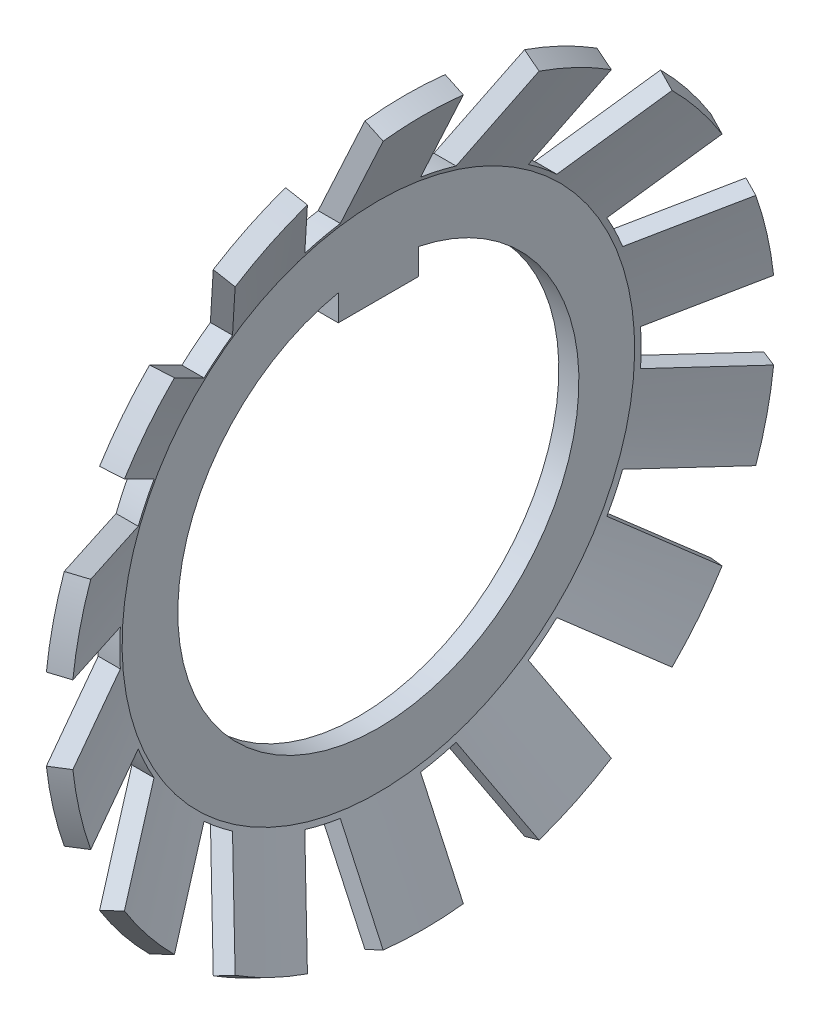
ISO-10303-21;
HEADER;
FILE_DESCRIPTION(('STEP AP214'),'2;1');
FILE_NAME('part.step','',(''),(''),'','','');
FILE_SCHEMA(('AUTOMOTIVE_DESIGN { 1 0 10303 214 1 1 1 1 }'));
ENDSEC;
DATA;
#1=APPLICATION_CONTEXT('core data for automotive mechanical design processes');
#2=APPLICATION_PROTOCOL_DEFINITION('international standard','automotive_design',2000,#1);
#3=PRODUCT_CONTEXT('',#1,'mechanical');
#4=PRODUCT('Part','Part','',(#3));
#5=PRODUCT_RELATED_PRODUCT_CATEGORY('part','',(#4));
#6=PRODUCT_DEFINITION_FORMATION('','',#4);
#7=PRODUCT_DEFINITION_CONTEXT('part definition',#1,'design');
#8=PRODUCT_DEFINITION('design','',#6,#7);
#9=PRODUCT_DEFINITION_SHAPE('','',#8);
#10=(LENGTH_UNIT() NAMED_UNIT(*) SI_UNIT(.MILLI.,.METRE.));
#11=(NAMED_UNIT(*) PLANE_ANGLE_UNIT() SI_UNIT($,.RADIAN.));
#12=(NAMED_UNIT(*) SI_UNIT($,.STERADIAN.) SOLID_ANGLE_UNIT());
#13=UNCERTAINTY_MEASURE_WITH_UNIT(LENGTH_MEASURE(1.E-05),#10,'distance_accuracy_value','');
#14=(GEOMETRIC_REPRESENTATION_CONTEXT(3) GLOBAL_UNCERTAINTY_ASSIGNED_CONTEXT((#13)) GLOBAL_UNIT_ASSIGNED_CONTEXT((#10,
#11,#12)) REPRESENTATION_CONTEXT('',''));
#15=CARTESIAN_POINT('',(0.,0.,0.));
#16=DIRECTION('',(0.,0.,1.));
#17=DIRECTION('',(1.,0.,0.));
#18=AXIS2_PLACEMENT_3D('',#15,#16,#17);
#19=CARTESIAN_POINT('',(0.,6.5,0.));
#20=DIRECTION('',(-1.,0.,0.));
#21=DIRECTION('',(0.,0.,1.));
#22=AXIS2_PLACEMENT_3D('',#19,#20,#21);
#23=PLANE('',#22);
#24=DIRECTION('',(0.,1.,0.));
#25=VECTOR('',#24,1.);
#26=CARTESIAN_POINT('',(0.,8.14897948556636,2.));
#27=LINE('',#26,#25);
#28=CARTESIAN_POINT('',(0.,8.5,2.));
#29=VERTEX_POINT('',#28);
#30=CARTESIAN_POINT('',(0.,9.79795897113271,2.));
#31=VERTEX_POINT('',#30);
#32=EDGE_CURVE('E9',#29,#31,#27,.T.);
#33=ORIENTED_EDGE('',*,*,#32,.T.);
#34=CARTESIAN_POINT('',(0.,0.,0.));
#35=DIRECTION('',(1.,0.,0.));
#36=DIRECTION('',(0.,0.979795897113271,0.2));
#37=AXIS2_PLACEMENT_3D('',#34,#35,#36);
#38=CIRCLE('',#37,10.);
#39=CARTESIAN_POINT('',(0.,9.79795897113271,-2.));
#40=VERTEX_POINT('',#39);
#41=EDGE_CURVE('E26',#31,#40,#38,.T.);
#42=ORIENTED_EDGE('',*,*,#41,.T.);
#43=DIRECTION('',(0.,-1.,0.));
#44=VECTOR('',#43,1.);
#45=CARTESIAN_POINT('',(0.,7.5,-2.));
#46=LINE('',#45,#44);
#47=CARTESIAN_POINT('',(0.,8.5,-2.));
#48=VERTEX_POINT('',#47);
#49=EDGE_CURVE('E646',#40,#48,#46,.T.);
#50=ORIENTED_EDGE('',*,*,#49,.T.);
#51=DIRECTION('',(0.,0.,1.));
#52=VECTOR('',#51,1.);
#53=CARTESIAN_POINT('',(0.,8.5,0.999999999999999));
#54=LINE('',#53,#52);
#55=EDGE_CURVE('E639',#48,#29,#54,.T.);
#56=ORIENTED_EDGE('',*,*,#55,.T.);
#57=EDGE_LOOP('',(#33,#42,#50,#56));
#58=FACE_BOUND('',#57,.T.);
#59=CARTESIAN_POINT('',(0.,0.,0.));
#60=DIRECTION('',(-1.,0.,0.));
#61=DIRECTION('',(0.,1.,0.));
#62=AXIS2_PLACEMENT_3D('',#59,#60,#61);
#63=CIRCLE('',#62,13.);
#64=CARTESIAN_POINT('',(0.,12.8452325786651,2.));
#65=VERTEX_POINT('',#64);
#66=CARTESIAN_POINT('',(0.,12.8452325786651,-2.));
#67=VERTEX_POINT('',#66);
#68=EDGE_CURVE('E647',#65,#67,#63,.T.);
#69=ORIENTED_EDGE('',*,*,#68,.T.);
#70=CARTESIAN_POINT('',(0.,0.,0.));
#71=DIRECTION('',(-1.,0.,0.));
#72=DIRECTION('',(0.,1.,0.));
#73=AXIS2_PLACEMENT_3D('',#70,#71,#72);
#74=CIRCLE('',#73,13.);
#75=CARTESIAN_POINT('',(0.,12.4409221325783,-3.77139980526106));
#76=VERTEX_POINT('',#75);
#77=EDGE_CURVE('E1015',#67,#76,#74,.T.);
#78=ORIENTED_EDGE('',*,*,#77,.T.);
#79=CARTESIAN_POINT('',(0.,0.,0.));
#80=DIRECTION('',(-1.,0.,0.));
#81=DIRECTION('',(0.,1.,0.));
#82=AXIS2_PLACEMENT_3D('',#79,#80,#81);
#83=CIRCLE('',#82,13.);
#84=CARTESIAN_POINT('',(0.,10.7053871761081,-7.37527527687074));
#85=VERTEX_POINT('',#84);
#86=EDGE_CURVE('E1025',#76,#85,#83,.T.);
#87=ORIENTED_EDGE('',*,*,#86,.T.);
#88=CARTESIAN_POINT('',(0.,0.,0.));
#89=DIRECTION('',(-1.,0.,0.));
#90=DIRECTION('',(0.,1.,0.));
#91=AXIS2_PLACEMENT_3D('',#88,#89,#90);
#92=CIRCLE('',#91,13.);
#93=CARTESIAN_POINT('',(0.,9.57253448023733,-8.79582762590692));
#94=VERTEX_POINT('',#93);
#95=EDGE_CURVE('E1222',#85,#94,#92,.T.);
#96=ORIENTED_EDGE('',*,*,#95,.T.);
#97=CARTESIAN_POINT('',(0.,0.,0.));
#98=DIRECTION('',(-1.,0.,0.));
#99=DIRECTION('',(0.,1.,0.));
#100=AXIS2_PLACEMENT_3D('',#97,#98,#99);
#101=CIRCLE('',#100,13.);
#102=CARTESIAN_POINT('',(0.,6.4452085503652,-11.2897868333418));
#103=VERTEX_POINT('',#102);
#104=EDGE_CURVE('E1263',#94,#103,#101,.T.);
#105=ORIENTED_EDGE('',*,*,#104,.T.);
#106=CARTESIAN_POINT('',(0.,0.,0.));
#107=DIRECTION('',(-1.,0.,0.));
#108=DIRECTION('',(0.,1.,0.));
#109=AXIS2_PLACEMENT_3D('',#106,#107,#108);
#110=CIRCLE('',#109,13.);
#111=CARTESIAN_POINT('',(0.,4.80818897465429,-12.0781339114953));
#112=VERTEX_POINT('',#111);
#113=EDGE_CURVE('E464',#103,#112,#110,.T.);
#114=ORIENTED_EDGE('',*,*,#113,.T.);
#115=CARTESIAN_POINT('',(0.,0.,0.));
#116=DIRECTION('',(-1.,0.,0.));
#117=DIRECTION('',(0.,1.,0.));
#118=AXIS2_PLACEMENT_3D('',#115,#116,#117);
#119=CIRCLE('',#118,13.);
#120=CARTESIAN_POINT('',(0.,0.908477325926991,-12.9682176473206));
#121=VERTEX_POINT('',#120);
#122=EDGE_CURVE('E460',#112,#121,#119,.T.);
#123=ORIENTED_EDGE('',*,*,#122,.T.);
#124=CARTESIAN_POINT('',(0.,0.,0.));
#125=DIRECTION('',(-1.,0.,0.));
#126=DIRECTION('',(0.,1.,0.));
#127=AXIS2_PLACEMENT_3D('',#124,#125,#126);
#128=CIRCLE('',#127,13.);
#129=CARTESIAN_POINT('',(0.,-0.908477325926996,-12.9682176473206));
#130=VERTEX_POINT('',#129);
#131=EDGE_CURVE('E458',#121,#130,#128,.T.);
#132=ORIENTED_EDGE('',*,*,#131,.T.);
#133=CARTESIAN_POINT('',(0.,0.,0.));
#134=DIRECTION('',(-1.,0.,0.));
#135=DIRECTION('',(0.,1.,0.));
#136=AXIS2_PLACEMENT_3D('',#133,#134,#135);
#137=CIRCLE('',#136,13.);
#138=CARTESIAN_POINT('',(0.,-4.80818897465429,-12.0781339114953));
#139=VERTEX_POINT('',#138);
#140=EDGE_CURVE('E451',#130,#139,#137,.T.);
#141=ORIENTED_EDGE('',*,*,#140,.T.);
#142=CARTESIAN_POINT('',(0.,0.,0.));
#143=DIRECTION('',(-1.,0.,0.));
#144=DIRECTION('',(0.,1.,0.));
#145=AXIS2_PLACEMENT_3D('',#142,#143,#144);
#146=CIRCLE('',#145,13.);
#147=CARTESIAN_POINT('',(0.,-6.44520855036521,-11.2897868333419));
#148=VERTEX_POINT('',#147);
#149=EDGE_CURVE('E459',#139,#148,#146,.T.);
#150=ORIENTED_EDGE('',*,*,#149,.T.);
#151=CARTESIAN_POINT('',(0.,0.,0.));
#152=DIRECTION('',(-1.,0.,0.));
#153=DIRECTION('',(0.,1.,0.));
#154=AXIS2_PLACEMENT_3D('',#151,#152,#153);
#155=CIRCLE('',#154,13.);
#156=CARTESIAN_POINT('',(0.,-9.57253448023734,-8.79582762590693));
#157=VERTEX_POINT('',#156);
#158=EDGE_CURVE('E1054',#148,#157,#155,.T.);
#159=ORIENTED_EDGE('',*,*,#158,.T.);
#160=CARTESIAN_POINT('',(0.,0.,0.));
#161=DIRECTION('',(-1.,0.,0.));
#162=DIRECTION('',(0.,1.,0.));
#163=AXIS2_PLACEMENT_3D('',#160,#161,#162);
#164=CIRCLE('',#163,13.);
#165=CARTESIAN_POINT('',(0.,-10.7053871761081,-7.37527527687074));
#166=VERTEX_POINT('',#165);
#167=EDGE_CURVE('E1262',#157,#166,#164,.T.);
#168=ORIENTED_EDGE('',*,*,#167,.T.);
#169=CARTESIAN_POINT('',(0.,0.,0.));
#170=DIRECTION('',(-1.,0.,0.));
#171=DIRECTION('',(0.,1.,0.));
#172=AXIS2_PLACEMENT_3D('',#169,#170,#171);
#173=CIRCLE('',#172,13.);
#174=CARTESIAN_POINT('',(0.,-12.4409221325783,-3.77139980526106));
#175=VERTEX_POINT('',#174);
#176=EDGE_CURVE('E1348',#166,#175,#173,.T.);
#177=ORIENTED_EDGE('',*,*,#176,.T.);
#178=CARTESIAN_POINT('',(0.,0.,0.));
#179=DIRECTION('',(-1.,0.,0.));
#180=DIRECTION('',(0.,1.,0.));
#181=AXIS2_PLACEMENT_3D('',#178,#179,#180);
#182=CIRCLE('',#181,13.);
#183=CARTESIAN_POINT('',(0.,-12.8452325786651,-2.));
#184=VERTEX_POINT('',#183);
#185=EDGE_CURVE('E1352',#175,#184,#182,.T.);
#186=ORIENTED_EDGE('',*,*,#185,.T.);
#187=CARTESIAN_POINT('',(0.,0.,0.));
#188=DIRECTION('',(-1.,0.,0.));
#189=DIRECTION('',(0.,1.,0.));
#190=AXIS2_PLACEMENT_3D('',#187,#188,#189);
#191=CIRCLE('',#190,13.);
#192=CARTESIAN_POINT('',(0.,-12.8452325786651,2.));
#193=VERTEX_POINT('',#192);
#194=EDGE_CURVE('E1409',#184,#193,#191,.T.);
#195=ORIENTED_EDGE('',*,*,#194,.T.);
#196=CARTESIAN_POINT('',(0.,0.,0.));
#197=DIRECTION('',(-1.,0.,0.));
#198=DIRECTION('',(0.,1.,0.));
#199=AXIS2_PLACEMENT_3D('',#196,#197,#198);
#200=CIRCLE('',#199,13.);
#201=CARTESIAN_POINT('',(0.,-12.4409221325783,3.77139980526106));
#202=VERTEX_POINT('',#201);
#203=EDGE_CURVE('E1271',#193,#202,#200,.T.);
#204=ORIENTED_EDGE('',*,*,#203,.T.);
#205=CARTESIAN_POINT('',(0.,0.,0.));
#206=DIRECTION('',(-1.,0.,0.));
#207=DIRECTION('',(0.,1.,0.));
#208=AXIS2_PLACEMENT_3D('',#205,#206,#207);
#209=CIRCLE('',#208,13.);
#210=CARTESIAN_POINT('',(0.,-10.7053871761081,7.37527527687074));
#211=VERTEX_POINT('',#210);
#212=EDGE_CURVE('E1267',#202,#211,#209,.T.);
#213=ORIENTED_EDGE('',*,*,#212,.T.);
#214=CARTESIAN_POINT('',(0.,0.,0.));
#215=DIRECTION('',(-1.,0.,0.));
#216=DIRECTION('',(0.,1.,0.));
#217=AXIS2_PLACEMENT_3D('',#214,#215,#216);
#218=CIRCLE('',#217,13.);
#219=CARTESIAN_POINT('',(0.,-9.57253448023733,8.79582762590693));
#220=VERTEX_POINT('',#219);
#221=EDGE_CURVE('E668',#211,#220,#218,.T.);
#222=ORIENTED_EDGE('',*,*,#221,.T.);
#223=CARTESIAN_POINT('',(0.,0.,0.));
#224=DIRECTION('',(-1.,0.,0.));
#225=DIRECTION('',(0.,1.,0.));
#226=AXIS2_PLACEMENT_3D('',#223,#224,#225);
#227=CIRCLE('',#226,13.);
#228=CARTESIAN_POINT('',(0.,-6.44520855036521,11.2897868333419));
#229=VERTEX_POINT('',#228);
#230=EDGE_CURVE('E664',#220,#229,#227,.T.);
#231=ORIENTED_EDGE('',*,*,#230,.T.);
#232=CARTESIAN_POINT('',(0.,0.,0.));
#233=DIRECTION('',(-1.,0.,0.));
#234=DIRECTION('',(0.,1.,0.));
#235=AXIS2_PLACEMENT_3D('',#232,#233,#234);
#236=CIRCLE('',#235,13.);
#237=CARTESIAN_POINT('',(0.,-4.80818897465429,12.0781339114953));
#238=VERTEX_POINT('',#237);
#239=EDGE_CURVE('E669',#229,#238,#236,.T.);
#240=ORIENTED_EDGE('',*,*,#239,.T.);
#241=CARTESIAN_POINT('',(0.,0.,0.));
#242=DIRECTION('',(-1.,0.,0.));
#243=DIRECTION('',(0.,1.,0.));
#244=AXIS2_PLACEMENT_3D('',#241,#242,#243);
#245=CIRCLE('',#244,13.);
#246=CARTESIAN_POINT('',(0.,-0.908477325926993,12.9682176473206));
#247=VERTEX_POINT('',#246);
#248=EDGE_CURVE('E758',#238,#247,#245,.T.);
#249=ORIENTED_EDGE('',*,*,#248,.T.);
#250=CARTESIAN_POINT('',(0.,0.,0.));
#251=DIRECTION('',(-1.,0.,0.));
#252=DIRECTION('',(0.,1.,0.));
#253=AXIS2_PLACEMENT_3D('',#250,#251,#252);
#254=CIRCLE('',#253,13.);
#255=CARTESIAN_POINT('',(0.,0.908477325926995,12.9682176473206));
#256=VERTEX_POINT('',#255);
#257=EDGE_CURVE('E1356',#247,#256,#254,.T.);
#258=ORIENTED_EDGE('',*,*,#257,.T.);
#259=CARTESIAN_POINT('',(0.,0.,0.));
#260=DIRECTION('',(-1.,0.,0.));
#261=DIRECTION('',(0.,1.,0.));
#262=AXIS2_PLACEMENT_3D('',#259,#260,#261);
#263=CIRCLE('',#262,13.);
#264=CARTESIAN_POINT('',(0.,4.80818897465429,12.0781339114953));
#265=VERTEX_POINT('',#264);
#266=EDGE_CURVE('E1281',#256,#265,#263,.T.);
#267=ORIENTED_EDGE('',*,*,#266,.T.);
#268=CARTESIAN_POINT('',(0.,0.,0.));
#269=DIRECTION('',(-1.,0.,0.));
#270=DIRECTION('',(0.,1.,0.));
#271=AXIS2_PLACEMENT_3D('',#268,#269,#270);
#272=CIRCLE('',#271,13.);
#273=CARTESIAN_POINT('',(0.,6.44520855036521,11.2897868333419));
#274=VERTEX_POINT('',#273);
#275=EDGE_CURVE('E1133',#265,#274,#272,.T.);
#276=ORIENTED_EDGE('',*,*,#275,.T.);
#277=CARTESIAN_POINT('',(0.,0.,0.));
#278=DIRECTION('',(-1.,0.,0.));
#279=DIRECTION('',(0.,1.,0.));
#280=AXIS2_PLACEMENT_3D('',#277,#278,#279);
#281=CIRCLE('',#280,13.);
#282=CARTESIAN_POINT('',(0.,9.57253448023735,8.79582762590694));
#283=VERTEX_POINT('',#282);
#284=EDGE_CURVE('E1130',#274,#283,#281,.T.);
#285=ORIENTED_EDGE('',*,*,#284,.T.);
#286=CARTESIAN_POINT('',(0.,0.,0.));
#287=DIRECTION('',(-1.,0.,0.));
#288=DIRECTION('',(0.,1.,0.));
#289=AXIS2_PLACEMENT_3D('',#286,#287,#288);
#290=CIRCLE('',#289,13.);
#291=CARTESIAN_POINT('',(0.,10.7053871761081,7.37527527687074));
#292=VERTEX_POINT('',#291);
#293=EDGE_CURVE('E662',#283,#292,#290,.T.);
#294=ORIENTED_EDGE('',*,*,#293,.T.);
#295=CARTESIAN_POINT('',(0.,0.,0.));
#296=DIRECTION('',(-1.,0.,0.));
#297=DIRECTION('',(0.,1.,0.));
#298=AXIS2_PLACEMENT_3D('',#295,#296,#297);
#299=CIRCLE('',#298,13.);
#300=CARTESIAN_POINT('',(0.,12.4409221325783,3.77139980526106));
#301=VERTEX_POINT('',#300);
#302=EDGE_CURVE('E658',#292,#301,#299,.T.);
#303=ORIENTED_EDGE('',*,*,#302,.T.);
#304=CARTESIAN_POINT('',(0.,0.,0.));
#305=DIRECTION('',(-1.,0.,0.));
#306=DIRECTION('',(0.,1.,0.));
#307=AXIS2_PLACEMENT_3D('',#304,#305,#306);
#308=CIRCLE('',#307,13.);
#309=EDGE_CURVE('E663',#301,#65,#308,.T.);
#310=ORIENTED_EDGE('',*,*,#309,.T.);
#311=EDGE_LOOP('',(#69,#78,#87,#96,#105,#114,#123,#132,#141,#150,#159,#168,#177,#186,#195,#204,
#213,#222,#231,#240,#249,#258,#267,#276,#285,#294,#303,#310));
#312=FACE_BOUND('',#311,.T.);
#313=ADVANCED_FACE('F15',(#58,#312),#23,.T.);
#314=DIRECTION('',(0.906307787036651,-0.422618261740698,0.));
#315=VECTOR('',#314,1.);
#316=CARTESIAN_POINT('',(2.78469218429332,17.7886908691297,0.));
#317=LINE('',#316,#315);
#318=CARTESIAN_POINT('',(40.9326628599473,0.,0.));
#319=DIRECTION('',(-1.,0.,0.));
#320=AXIS1_PLACEMENT('',#318,#319);
#321=SURFACE_OF_REVOLUTION('',#317,#320);
#322=CARTESIAN_POINT('',(2.33153829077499,-2.03071965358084,-17.8850825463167));
#323=CARTESIAN_POINT('',(2.79014406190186,-1.98283675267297,-17.6752938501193));
#324=CARTESIAN_POINT('',(3.23784607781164,-1.93607808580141,-17.4704307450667));
#325=(BOUNDED_CURVE() B_SPLINE_CURVE(2,(#322,#323,#324),.UNSPECIFIED.,.F.,
.F.) B_SPLINE_CURVE_WITH_KNOTS((3,3),(0.,1.0011428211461),
.UNSPECIFIED.) CURVE() GEOMETRIC_REPRESENTATION_ITEM() RATIONAL_B_SPLINE_CURVE((1.,
1.00007146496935,1.)) REPRESENTATION_ITEM(''));
#326=CARTESIAN_POINT('',(2.33153829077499,-2.03071965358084,-17.8850825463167));
#327=VERTEX_POINT('',#326);
#328=CARTESIAN_POINT('',(3.23784607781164,-1.93607808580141,-17.4704307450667));
#329=VERTEX_POINT('',#328);
#330=EDGE_CURVE('E498',#327,#329,#325,.T.);
#331=ORIENTED_EDGE('',*,*,#330,.T.);
#332=CARTESIAN_POINT('',(3.23784607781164,0.,0.));
#333=DIRECTION('',(-1.,0.,0.));
#334=DIRECTION('',(0.,1.,0.));
#335=AXIS2_PLACEMENT_3D('',#332,#333,#334);
#336=CIRCLE('',#335,17.5773817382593);
#337=CARTESIAN_POINT('',(3.23784607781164,-5.8357897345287,-16.5803470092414));
#338=VERTEX_POINT('',#337);
#339=EDGE_CURVE('E494',#329,#338,#336,.T.);
#340=ORIENTED_EDGE('',*,*,#339,.T.);
#341=CARTESIAN_POINT('',(3.23784607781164,-5.8357897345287,-16.5803470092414));
#342=CARTESIAN_POINT('',(2.79014405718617,-5.8825484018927,-16.7852101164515));
#343=CARTESIAN_POINT('',(2.33153829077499,-5.93043130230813,-16.9949988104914));
#344=(BOUNDED_CURVE() B_SPLINE_CURVE(2,(#341,#342,#343),.UNSPECIFIED.,.F.,
.F.) B_SPLINE_CURVE_WITH_KNOTS((3,3),(0.,1.0011428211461),
.UNSPECIFIED.) CURVE() GEOMETRIC_REPRESENTATION_ITEM() RATIONAL_B_SPLINE_CURVE((1.,
1.00007146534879,1.)) REPRESENTATION_ITEM(''));
#345=CARTESIAN_POINT('',(2.331538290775,-5.93043130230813,-16.9949988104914));
#346=VERTEX_POINT('',#345);
#347=EDGE_CURVE('E499',#338,#346,#344,.T.);
#348=ORIENTED_EDGE('',*,*,#347,.T.);
#349=CARTESIAN_POINT('',(2.33153829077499,0.,0.));
#350=DIRECTION('',(-1.,0.,0.));
#351=DIRECTION('',(0.,1.,0.));
#352=AXIS2_PLACEMENT_3D('',#349,#350,#351);
#353=CIRCLE('',#352,18.);
#354=EDGE_CURVE('E581',#327,#346,#353,.T.);
#355=ORIENTED_EDGE('',*,*,#354,.F.);
#356=EDGE_LOOP('',(#331,#340,#348,#355));
#357=FACE_BOUND('',#356,.T.);
#358=ADVANCED_FACE('F828',(#357),#321,.F.);
#359=CARTESIAN_POINT('',(1.,6.38915266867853,0.));
#360=DIRECTION('',(1.,0.,0.));
#361=DIRECTION('',(0.,0.,-1.));
#362=AXIS2_PLACEMENT_3D('',#359,#360,#361);
#363=PLANE('',#362);
#364=DIRECTION('',(0.,-1.,0.));
#365=VECTOR('',#364,1.);
#366=CARTESIAN_POINT('',(1.,8.09355581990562,2.));
#367=LINE('',#366,#365);
#368=CARTESIAN_POINT('',(1.,9.79795897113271,2.));
#369=VERTEX_POINT('',#368);
#370=CARTESIAN_POINT('',(1.,8.5,2.));
#371=VERTEX_POINT('',#370);
#372=EDGE_CURVE('E724',#369,#371,#367,.T.);
#373=ORIENTED_EDGE('',*,*,#372,.T.);
#374=DIRECTION('',(0.,0.,-1.));
#375=VECTOR('',#374,1.);
#376=CARTESIAN_POINT('',(1.,8.5,0.999999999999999));
#377=LINE('',#376,#375);
#378=CARTESIAN_POINT('',(1.,8.5,-2.));
#379=VERTEX_POINT('',#378);
#380=EDGE_CURVE('E717',#371,#379,#377,.T.);
#381=ORIENTED_EDGE('',*,*,#380,.T.);
#382=DIRECTION('',(0.,1.,0.));
#383=VECTOR('',#382,1.);
#384=CARTESIAN_POINT('',(1.,7.44457633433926,-2.));
#385=LINE('',#384,#383);
#386=CARTESIAN_POINT('',(1.,9.79795897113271,-2.));
#387=VERTEX_POINT('',#386);
#388=EDGE_CURVE('E725',#379,#387,#385,.T.);
#389=ORIENTED_EDGE('',*,*,#388,.T.);
#390=CARTESIAN_POINT('',(1.,0.,0.));
#391=DIRECTION('',(-1.,0.,0.));
#392=DIRECTION('',(0.,0.979795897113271,0.2));
#393=AXIS2_PLACEMENT_3D('',#390,#391,#392);
#394=CIRCLE('',#393,10.);
#395=EDGE_CURVE('E794',#387,#369,#394,.T.);
#396=ORIENTED_EDGE('',*,*,#395,.T.);
#397=EDGE_LOOP('',(#373,#381,#389,#396));
#398=FACE_BOUND('',#397,.T.);
#399=CARTESIAN_POINT('',(1.,0.,0.));
#400=DIRECTION('',(-1.,0.,0.));
#401=DIRECTION('',(0.,1.,0.));
#402=AXIS2_PLACEMENT_3D('',#399,#400,#401);
#403=CIRCLE('',#402,12.7783053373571);
#404=CARTESIAN_POINT('',(1.,12.7783053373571,0.));
#405=VERTEX_POINT('',#404);
#406=EDGE_CURVE('E1325',#405,#405,#403,.T.);
#407=ORIENTED_EDGE('',*,*,#406,.F.);
#408=EDGE_LOOP('',(#407));
#409=FACE_BOUND('',#408,.T.);
#410=ADVANCED_FACE('F832',(#398,#409),#363,.T.);
#411=CARTESIAN_POINT('',(0.,8.5,-2.));
#412=DIRECTION('',(0.,0.,-1.));
#413=DIRECTION('',(-1.,0.,0.));
#414=AXIS2_PLACEMENT_3D('',#411,#412,#413);
#415=PLANE('',#414);
#416=ORIENTED_EDGE('',*,*,#388,.F.);
#417=DIRECTION('',(1.,0.,0.));
#418=VECTOR('',#417,1.);
#419=CARTESIAN_POINT('',(0.,8.5,-2.));
#420=LINE('',#419,#418);
#421=EDGE_CURVE('E795',#48,#379,#420,.T.);
#422=ORIENTED_EDGE('',*,*,#421,.F.);
#423=ORIENTED_EDGE('',*,*,#49,.F.);
#424=DIRECTION('',(1.,0.,0.));
#425=VECTOR('',#424,1.);
#426=CARTESIAN_POINT('',(0.,9.79795897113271,-2.));
#427=LINE('',#426,#425);
#428=EDGE_CURVE('E787',#40,#387,#427,.T.);
#429=ORIENTED_EDGE('',*,*,#428,.T.);
#430=EDGE_LOOP('',(#416,#422,#423,#429));
#431=FACE_BOUND('',#430,.T.);
#432=ADVANCED_FACE('F836',(#431),#415,.T.);
#433=CARTESIAN_POINT('',(0.,8.5,2.));
#434=DIRECTION('',(0.,-1.,0.));
#435=DIRECTION('',(0.,0.,-1.));
#436=AXIS2_PLACEMENT_3D('',#433,#434,#435);
#437=PLANE('',#436);
#438=ORIENTED_EDGE('',*,*,#380,.F.);
#439=DIRECTION('',(1.,0.,0.));
#440=VECTOR('',#439,1.);
#441=CARTESIAN_POINT('',(0.,8.5,2.));
#442=LINE('',#441,#440);
#443=EDGE_CURVE('E592',#29,#371,#442,.T.);
#444=ORIENTED_EDGE('',*,*,#443,.F.);
#445=ORIENTED_EDGE('',*,*,#55,.F.);
#446=ORIENTED_EDGE('',*,*,#421,.T.);
#447=EDGE_LOOP('',(#438,#444,#445,#446));
#448=FACE_BOUND('',#447,.T.);
#449=ADVANCED_FACE('F840',(#448),#437,.T.);
#450=CARTESIAN_POINT('',(0.,9.79795897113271,2.));
#451=DIRECTION('',(0.,0.,1.));
#452=DIRECTION('',(1.,0.,0.));
#453=AXIS2_PLACEMENT_3D('',#450,#451,#452);
#454=PLANE('',#453);
#455=ORIENTED_EDGE('',*,*,#372,.F.);
#456=DIRECTION('',(1.,0.,0.));
#457=VECTOR('',#456,1.);
#458=CARTESIAN_POINT('',(0.,9.79795897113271,2.));
#459=LINE('',#458,#457);
#460=EDGE_CURVE('E613',#31,#369,#459,.T.);
#461=ORIENTED_EDGE('',*,*,#460,.F.);
#462=ORIENTED_EDGE('',*,*,#32,.F.);
#463=ORIENTED_EDGE('',*,*,#443,.T.);
#464=EDGE_LOOP('',(#455,#461,#462,#463));
#465=FACE_BOUND('',#464,.T.);
#466=ADVANCED_FACE('F844',(#465),#454,.T.);
#467=DIRECTION('',(0.906307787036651,-0.422618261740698,0.));
#468=VECTOR('',#467,1.);
#469=CARTESIAN_POINT('',(2.78469218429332,17.7886908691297,0.));
#470=LINE('',#469,#468);
#471=CARTESIAN_POINT('',(40.9326628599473,0.,0.));
#472=DIRECTION('',(-1.,0.,0.));
#473=AXIS1_PLACEMENT('',#471,#472);
#474=SURFACE_OF_REVOLUTION('',#470,#473);
#475=CARTESIAN_POINT('',(3.23784607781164,1.93607808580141,-17.4704307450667));
#476=CARTESIAN_POINT('',(2.79014406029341,1.98283675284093,-17.6752938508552));
#477=CARTESIAN_POINT('',(2.33153829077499,2.03071965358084,-17.8850825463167));
#478=(BOUNDED_CURVE() B_SPLINE_CURVE(2,(#475,#476,#477),.UNSPECIFIED.,.F.,
.F.) B_SPLINE_CURVE_WITH_KNOTS((3,3),(0.,1.0011428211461),
.UNSPECIFIED.) CURVE() GEOMETRIC_REPRESENTATION_ITEM() RATIONAL_B_SPLINE_CURVE((1.,
1.00007146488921,1.)) REPRESENTATION_ITEM(''));
#479=CARTESIAN_POINT('',(3.23784607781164,1.93607808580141,-17.4704307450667));
#480=VERTEX_POINT('',#479);
#481=CARTESIAN_POINT('',(2.33153829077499,2.03071965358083,-17.8850825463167));
#482=VERTEX_POINT('',#481);
#483=EDGE_CURVE('E583',#480,#482,#478,.T.);
#484=ORIENTED_EDGE('',*,*,#483,.T.);
#485=CARTESIAN_POINT('',(2.33153829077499,0.,0.));
#486=DIRECTION('',(-1.,0.,0.));
#487=DIRECTION('',(0.,1.,0.));
#488=AXIS2_PLACEMENT_3D('',#485,#486,#487);
#489=CIRCLE('',#488,18.);
#490=CARTESIAN_POINT('',(2.33153829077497,5.93043130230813,-16.9949988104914));
#491=VERTEX_POINT('',#490);
#492=EDGE_CURVE('E1148',#491,#482,#489,.T.);
#493=ORIENTED_EDGE('',*,*,#492,.F.);
#494=CARTESIAN_POINT('',(2.33153829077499,5.93043130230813,-16.9949988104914));
#495=CARTESIAN_POINT('',(2.7901440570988,5.88254840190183,-16.7852101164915));
#496=CARTESIAN_POINT('',(3.23784607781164,5.8357897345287,-16.5803470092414));
#497=(BOUNDED_CURVE() B_SPLINE_CURVE(2,(#494,#495,#496),.UNSPECIFIED.,.F.,
.F.) B_SPLINE_CURVE_WITH_KNOTS((3,3),(0.,1.0011428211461),
.UNSPECIFIED.) CURVE() GEOMETRIC_REPRESENTATION_ITEM() RATIONAL_B_SPLINE_CURVE((1.,
1.0000714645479,1.)) REPRESENTATION_ITEM(''));
#498=CARTESIAN_POINT('',(3.23784607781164,5.8357897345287,-16.5803470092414));
#499=VERTEX_POINT('',#498);
#500=EDGE_CURVE('E593',#491,#499,#497,.T.);
#501=ORIENTED_EDGE('',*,*,#500,.T.);
#502=CARTESIAN_POINT('',(3.23784607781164,0.,0.));
#503=DIRECTION('',(-1.,0.,0.));
#504=DIRECTION('',(0.,1.,0.));
#505=AXIS2_PLACEMENT_3D('',#502,#503,#504);
#506=CIRCLE('',#505,17.5773817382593);
#507=EDGE_CURVE('E742',#499,#480,#506,.T.);
#508=ORIENTED_EDGE('',*,*,#507,.T.);
#509=EDGE_LOOP('',(#484,#493,#501,#508));
#510=FACE_BOUND('',#509,.T.);
#511=ADVANCED_FACE('F848',(#510),#474,.F.);
#512=DIRECTION('',(0.906307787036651,-0.422618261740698,0.));
#513=VECTOR('',#512,1.);
#514=CARTESIAN_POINT('',(2.78469218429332,17.7886908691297,0.));
#515=LINE('',#514,#513);
#516=CARTESIAN_POINT('',(40.9326628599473,0.,0.));
#517=DIRECTION('',(-1.,0.,0.));
#518=AXIS1_PLACEMENT('',#516,#517);
#519=SURFACE_OF_REVOLUTION('',#515,#518);
#520=CARTESIAN_POINT('',(2.33153829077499,-9.58966167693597,-15.2328063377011));
#521=CARTESIAN_POINT('',(2.79014405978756,-9.45549677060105,-15.0645688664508));
#522=CARTESIAN_POINT('',(3.23784607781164,-9.32448189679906,-14.9002814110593));
#523=(BOUNDED_CURVE() B_SPLINE_CURVE(2,(#520,#521,#522),.UNSPECIFIED.,.F.,
.F.) B_SPLINE_CURVE_WITH_KNOTS((3,3),(0.,1.0011428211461),
.UNSPECIFIED.) CURVE() GEOMETRIC_REPRESENTATION_ITEM() RATIONAL_B_SPLINE_CURVE((1.,
1.00007146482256,1.)) REPRESENTATION_ITEM(''));
#524=CARTESIAN_POINT('',(2.33153829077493,-9.58966167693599,-15.2328063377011));
#525=VERTEX_POINT('',#524);
#526=CARTESIAN_POINT('',(3.23784607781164,-9.32448189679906,-14.9002814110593));
#527=VERTEX_POINT('',#526);
#528=EDGE_CURVE('E1323',#525,#527,#523,.T.);
#529=ORIENTED_EDGE('',*,*,#528,.T.);
#530=CARTESIAN_POINT('',(3.23784607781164,0.,0.));
#531=DIRECTION('',(-1.,0.,0.));
#532=DIRECTION('',(0.,1.,0.));
#533=AXIS2_PLACEMENT_3D('',#530,#531,#532);
#534=CIRCLE('',#533,17.5773817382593);
#535=CARTESIAN_POINT('',(3.23784607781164,-12.4518078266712,-12.4063222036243));
#536=VERTEX_POINT('',#535);
#537=EDGE_CURVE('E1316',#527,#536,#534,.T.);
#538=ORIENTED_EDGE('',*,*,#537,.T.);
#539=CARTESIAN_POINT('',(3.23784607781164,-12.4518078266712,-12.4063222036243));
#540=CARTESIAN_POINT('',(2.79014405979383,-12.5828227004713,-12.5706096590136));
#541=CARTESIAN_POINT('',(2.33153829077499,-12.7169876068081,-12.7388471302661));
#542=(BOUNDED_CURVE() B_SPLINE_CURVE(2,(#539,#540,#541),.UNSPECIFIED.,.F.,
.F.) B_SPLINE_CURVE_WITH_KNOTS((3,3),(0.,1.0011428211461),
.UNSPECIFIED.) CURVE() GEOMETRIC_REPRESENTATION_ITEM() RATIONAL_B_SPLINE_CURVE((1.,
1.00007146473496,1.)) REPRESENTATION_ITEM(''));
#543=CARTESIAN_POINT('',(2.33153829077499,-12.7169876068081,-12.7388471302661));
#544=VERTEX_POINT('',#543);
#545=EDGE_CURVE('E1324',#536,#544,#542,.T.);
#546=ORIENTED_EDGE('',*,*,#545,.T.);
#547=CARTESIAN_POINT('',(2.33153829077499,0.,0.));
#548=DIRECTION('',(-1.,0.,0.));
#549=DIRECTION('',(0.,1.,0.));
#550=AXIS2_PLACEMENT_3D('',#547,#548,#549);
#551=CIRCLE('',#550,18.);
#552=EDGE_CURVE('E1084',#525,#544,#551,.T.);
#553=ORIENTED_EDGE('',*,*,#552,.F.);
#554=EDGE_LOOP('',(#529,#538,#546,#553));
#555=FACE_BOUND('',#554,.T.);
#556=ADVANCED_FACE('F852',(#555),#519,.F.);
#557=DIRECTION('',(0.906307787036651,-0.422618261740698,0.));
#558=VECTOR('',#557,1.);
#559=CARTESIAN_POINT('',(2.78469218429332,17.7886908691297,0.));
#560=LINE('',#559,#558);
#561=CARTESIAN_POINT('',(40.9326628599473,0.,0.));
#562=DIRECTION('',(-1.,0.,0.));
#563=AXIS1_PLACEMENT('',#561,#562);
#564=SURFACE_OF_REVOLUTION('',#560,#563);
#565=CARTESIAN_POINT('',(3.23784607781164,9.32448189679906,-14.9002814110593));
#566=CARTESIAN_POINT('',(2.79014405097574,9.45549677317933,-15.0645688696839));
#567=CARTESIAN_POINT('',(2.33153829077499,9.58966167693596,-15.2328063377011));
#568=(BOUNDED_CURVE() B_SPLINE_CURVE(2,(#565,#566,#567),.UNSPECIFIED.,.F.,
.F.) B_SPLINE_CURVE_WITH_KNOTS((3,3),(0.,1.0011428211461),
.UNSPECIFIED.) CURVE() GEOMETRIC_REPRESENTATION_ITEM() RATIONAL_B_SPLINE_CURVE((1.,
1.00007146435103,1.)) REPRESENTATION_ITEM(''));
#569=CARTESIAN_POINT('',(3.23784607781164,9.32448189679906,-14.9002814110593));
#570=VERTEX_POINT('',#569);
#571=CARTESIAN_POINT('',(2.33153829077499,9.58966167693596,-15.2328063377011));
#572=VERTEX_POINT('',#571);
#573=EDGE_CURVE('E732',#570,#572,#568,.T.);
#574=ORIENTED_EDGE('',*,*,#573,.T.);
#575=CARTESIAN_POINT('',(2.33153829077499,0.,0.));
#576=DIRECTION('',(-1.,0.,0.));
#577=DIRECTION('',(0.,1.,0.));
#578=AXIS2_PLACEMENT_3D('',#575,#576,#577);
#579=CIRCLE('',#578,18.);
#580=CARTESIAN_POINT('',(2.33153829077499,12.7169876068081,-12.7388471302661));
#581=VERTEX_POINT('',#580);
#582=EDGE_CURVE('E516',#581,#572,#579,.T.);
#583=ORIENTED_EDGE('',*,*,#582,.F.);
#584=CARTESIAN_POINT('',(2.33153829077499,12.7169876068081,-12.7388471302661));
#585=CARTESIAN_POINT('',(2.79014406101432,12.5828227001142,-12.5706096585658));
#586=CARTESIAN_POINT('',(3.23784607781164,12.4518078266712,-12.4063222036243));
#587=(BOUNDED_CURVE() B_SPLINE_CURVE(2,(#584,#585,#586),.UNSPECIFIED.,.F.,
.F.) B_SPLINE_CURVE_WITH_KNOTS((3,3),(0.,1.0011428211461),
.UNSPECIFIED.) CURVE() GEOMETRIC_REPRESENTATION_ITEM() RATIONAL_B_SPLINE_CURVE((1.,
1.00007146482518,1.)) REPRESENTATION_ITEM(''));
#588=CARTESIAN_POINT('',(3.23784607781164,12.4518078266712,-12.4063222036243));
#589=VERTEX_POINT('',#588);
#590=EDGE_CURVE('E726',#581,#589,#587,.T.);
#591=ORIENTED_EDGE('',*,*,#590,.T.);
#592=CARTESIAN_POINT('',(3.23784607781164,0.,0.));
#593=DIRECTION('',(-1.,0.,0.));
#594=DIRECTION('',(0.,1.,0.));
#595=AXIS2_PLACEMENT_3D('',#592,#593,#594);
#596=CIRCLE('',#595,17.5773817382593);
#597=EDGE_CURVE('E733',#589,#570,#596,.T.);
#598=ORIENTED_EDGE('',*,*,#597,.T.);
#599=EDGE_LOOP('',(#574,#583,#591,#598));
#600=FACE_BOUND('',#599,.T.);
#601=ADVANCED_FACE('F856',(#600),#564,.F.);
#602=DIRECTION('',(0.906307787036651,-0.422618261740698,0.));
#603=VECTOR('',#602,1.);
#604=CARTESIAN_POINT('',(2.78469218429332,17.7886908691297,0.));
#605=LINE('',#604,#603);
#606=CARTESIAN_POINT('',(40.9326628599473,0.,0.));
#607=DIRECTION('',(-1.,0.,0.));
#608=AXIS1_PLACEMENT('',#606,#607);
#609=SURFACE_OF_REVOLUTION('',#605,#608);
#610=CARTESIAN_POINT('',(2.33153829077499,-15.2492535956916,-9.563486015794));
#611=CARTESIAN_POINT('',(2.79014406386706,-15.0553796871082,-9.47012126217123));
#612=CARTESIAN_POINT('',(3.23784607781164,-14.8660577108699,-9.37894860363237));
#613=(BOUNDED_CURVE() B_SPLINE_CURVE(2,(#610,#611,#612),.UNSPECIFIED.,.F.,
.F.) B_SPLINE_CURVE_WITH_KNOTS((3,3),(0.,1.0011428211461),
.UNSPECIFIED.) CURVE() GEOMETRIC_REPRESENTATION_ITEM() RATIONAL_B_SPLINE_CURVE((1.,
1.00007146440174,1.)) REPRESENTATION_ITEM(''));
#614=CARTESIAN_POINT('',(2.331538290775,-15.2492535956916,-9.56348601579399));
#615=VERTEX_POINT('',#614);
#616=CARTESIAN_POINT('',(3.23784607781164,-14.8660577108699,-9.37894860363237));
#617=VERTEX_POINT('',#616);
#618=EDGE_CURVE('E692',#615,#617,#613,.T.);
#619=ORIENTED_EDGE('',*,*,#618,.T.);
#620=CARTESIAN_POINT('',(3.23784607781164,0.,0.));
#621=DIRECTION('',(-1.,0.,0.));
#622=DIRECTION('',(0.,1.,0.));
#623=AXIS2_PLACEMENT_3D('',#620,#621,#622);
#624=CIRCLE('',#623,17.5773817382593);
#625=CARTESIAN_POINT('',(3.23784607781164,-16.6015926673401,-5.7750731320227));
#626=VERTEX_POINT('',#625);
#627=EDGE_CURVE('E689',#617,#626,#624,.T.);
#628=ORIENTED_EDGE('',*,*,#627,.T.);
#629=CARTESIAN_POINT('',(3.23784607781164,-16.6015926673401,-5.7750731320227));
#630=CARTESIAN_POINT('',(2.79014405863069,-16.7909146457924,-5.86624579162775));
#631=CARTESIAN_POINT('',(2.33153829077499,-16.9847885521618,-5.95961054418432));
#632=(BOUNDED_CURVE() B_SPLINE_CURVE(2,(#629,#630,#631),.UNSPECIFIED.,.F.,
.F.) B_SPLINE_CURVE_WITH_KNOTS((3,3),(0.,1.0011428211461),
.UNSPECIFIED.) CURVE() GEOMETRIC_REPRESENTATION_ITEM() RATIONAL_B_SPLINE_CURVE((1.,
1.00007146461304,1.)) REPRESENTATION_ITEM(''));
#633=CARTESIAN_POINT('',(2.33153829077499,-16.9847885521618,-5.95961054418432));
#634=VERTEX_POINT('',#633);
#635=EDGE_CURVE('E693',#626,#634,#632,.T.);
#636=ORIENTED_EDGE('',*,*,#635,.T.);
#637=CARTESIAN_POINT('',(2.33153829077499,0.,0.));
#638=DIRECTION('',(-1.,0.,0.));
#639=DIRECTION('',(0.,1.,0.));
#640=AXIS2_PLACEMENT_3D('',#637,#638,#639);
#641=CIRCLE('',#640,18.);
#642=EDGE_CURVE('E465',#615,#634,#641,.T.);
#643=ORIENTED_EDGE('',*,*,#642,.F.);
#644=EDGE_LOOP('',(#619,#628,#636,#643));
#645=FACE_BOUND('',#644,.T.);
#646=ADVANCED_FACE('F867',(#645),#609,.F.);
#647=DIRECTION('',(0.906307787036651,-0.422618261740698,0.));
#648=VECTOR('',#647,1.);
#649=CARTESIAN_POINT('',(2.78469218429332,17.7886908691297,0.));
#650=LINE('',#649,#648);
#651=CARTESIAN_POINT('',(40.9326628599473,0.,0.));
#652=DIRECTION('',(-1.,0.,0.));
#653=AXIS1_PLACEMENT('',#651,#652);
#654=SURFACE_OF_REVOLUTION('',#650,#653);
#655=CARTESIAN_POINT('',(3.23784607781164,14.8660577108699,-9.37894860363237));
#656=CARTESIAN_POINT('',(2.79014405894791,15.0553796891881,-9.47012126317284));
#657=CARTESIAN_POINT('',(2.33153829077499,15.2492535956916,-9.563486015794));
#658=(BOUNDED_CURVE() B_SPLINE_CURVE(2,(#655,#656,#657),.UNSPECIFIED.,.F.,
.F.) B_SPLINE_CURVE_WITH_KNOTS((3,3),(0.,1.0011428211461),
.UNSPECIFIED.) CURVE() GEOMETRIC_REPRESENTATION_ITEM() RATIONAL_B_SPLINE_CURVE((1.,
1.00007146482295,1.)) REPRESENTATION_ITEM(''));
#659=CARTESIAN_POINT('',(3.23784607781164,14.8660577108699,-9.37894860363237));
#660=VERTEX_POINT('',#659);
#661=CARTESIAN_POINT('',(2.33153829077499,15.2492535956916,-9.563486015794));
#662=VERTEX_POINT('',#661);
#663=EDGE_CURVE('E1061',#660,#662,#658,.T.);
#664=ORIENTED_EDGE('',*,*,#663,.T.);
#665=CARTESIAN_POINT('',(2.33153829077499,0.,0.));
#666=DIRECTION('',(-1.,0.,0.));
#667=DIRECTION('',(0.,1.,0.));
#668=AXIS2_PLACEMENT_3D('',#665,#666,#667);
#669=CIRCLE('',#668,18.);
#670=CARTESIAN_POINT('',(2.33153829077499,16.9847885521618,-5.95961054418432));
#671=VERTEX_POINT('',#670);
#672=EDGE_CURVE('E1046',#671,#662,#669,.T.);
#673=ORIENTED_EDGE('',*,*,#672,.F.);
#674=CARTESIAN_POINT('',(2.33153829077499,16.9847885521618,-5.95961054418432));
#675=CARTESIAN_POINT('',(2.79014405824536,16.7909146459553,-5.86624579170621));
#676=CARTESIAN_POINT('',(3.23784607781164,16.6015926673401,-5.77507313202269));
#677=(BOUNDED_CURVE() B_SPLINE_CURVE(2,(#674,#675,#676),.UNSPECIFIED.,.F.,
.F.) B_SPLINE_CURVE_WITH_KNOTS((3,3),(0.,1.0011428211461),
.UNSPECIFIED.) CURVE() GEOMETRIC_REPRESENTATION_ITEM() RATIONAL_B_SPLINE_CURVE((1.,
1.00007146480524,1.)) REPRESENTATION_ITEM(''));
#678=CARTESIAN_POINT('',(3.23784607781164,16.6015926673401,-5.77507313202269));
#679=VERTEX_POINT('',#678);
#680=EDGE_CURVE('E1070',#671,#679,#677,.T.);
#681=ORIENTED_EDGE('',*,*,#680,.T.);
#682=CARTESIAN_POINT('',(3.23784607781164,0.,0.));
#683=DIRECTION('',(-1.,0.,0.));
#684=DIRECTION('',(0.,1.,0.));
#685=AXIS2_PLACEMENT_3D('',#682,#683,#684);
#686=CIRCLE('',#685,17.5773817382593);
#687=EDGE_CURVE('E530',#679,#660,#686,.T.);
#688=ORIENTED_EDGE('',*,*,#687,.T.);
#689=EDGE_LOOP('',(#664,#673,#681,#688));
#690=FACE_BOUND('',#689,.T.);
#691=ADVANCED_FACE('F870',(#690),#654,.F.);
#692=DIRECTION('',(0.906307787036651,-0.422618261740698,0.));
#693=VECTOR('',#692,1.);
#694=CARTESIAN_POINT('',(2.78469218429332,17.7886908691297,0.));
#695=LINE('',#694,#693);
#696=CARTESIAN_POINT('',(40.9326628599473,0.,0.));
#697=DIRECTION('',(-1.,0.,0.));
#698=AXIS1_PLACEMENT('',#696,#697);
#699=SURFACE_OF_REVOLUTION('',#695,#698);
#700=CARTESIAN_POINT('',(2.33153829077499,-16.9847885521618,5.95961054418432));
#701=CARTESIAN_POINT('',(2.79014405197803,-16.7909146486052,5.86624579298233));
#702=CARTESIAN_POINT('',(3.23784607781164,-16.6015926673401,5.7750731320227));
#703=(BOUNDED_CURVE() B_SPLINE_CURVE(2,(#700,#701,#702),.UNSPECIFIED.,.F.,
.F.) B_SPLINE_CURVE_WITH_KNOTS((3,3),(0.,1.0011428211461),
.UNSPECIFIED.) CURVE() GEOMETRIC_REPRESENTATION_ITEM() RATIONAL_B_SPLINE_CURVE((1.,
1.00007146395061,1.)) REPRESENTATION_ITEM(''));
#704=CARTESIAN_POINT('',(2.33153829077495,-16.9847885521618,5.95961054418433));
#705=VERTEX_POINT('',#704);
#706=CARTESIAN_POINT('',(3.23784607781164,-16.6015926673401,5.7750731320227));
#707=VERTEX_POINT('',#706);
#708=EDGE_CURVE('E403',#705,#707,#703,.T.);
#709=ORIENTED_EDGE('',*,*,#708,.T.);
#710=CARTESIAN_POINT('',(3.23784607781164,0.,0.));
#711=DIRECTION('',(-1.,0.,0.));
#712=DIRECTION('',(0.,1.,0.));
#713=AXIS2_PLACEMENT_3D('',#710,#711,#712);
#714=CIRCLE('',#713,17.5773817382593);
#715=CARTESIAN_POINT('',(3.23784607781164,-14.8660577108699,9.37894860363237));
#716=VERTEX_POINT('',#715);
#717=EDGE_CURVE('E386',#707,#716,#714,.T.);
#718=ORIENTED_EDGE('',*,*,#717,.T.);
#719=CARTESIAN_POINT('',(3.23784607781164,-14.8660577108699,9.37894860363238));
#720=CARTESIAN_POINT('',(2.79014406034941,-15.0553796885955,9.47012126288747));
#721=CARTESIAN_POINT('',(2.33153829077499,-15.2492535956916,9.563486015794));
#722=(BOUNDED_CURVE() B_SPLINE_CURVE(2,(#719,#720,#721),.UNSPECIFIED.,.F.,
.F.) B_SPLINE_CURVE_WITH_KNOTS((3,3),(0.,1.0011428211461),
.UNSPECIFIED.) CURVE() GEOMETRIC_REPRESENTATION_ITEM() RATIONAL_B_SPLINE_CURVE((1.,
1.0000714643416,1.)) REPRESENTATION_ITEM(''));
#723=CARTESIAN_POINT('',(2.33153829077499,-15.2492535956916,9.563486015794));
#724=VERTEX_POINT('',#723);
#725=EDGE_CURVE('E401',#716,#724,#722,.T.);
#726=ORIENTED_EDGE('',*,*,#725,.T.);
#727=CARTESIAN_POINT('',(2.33153829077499,0.,0.));
#728=DIRECTION('',(-1.,0.,0.));
#729=DIRECTION('',(0.,1.,0.));
#730=AXIS2_PLACEMENT_3D('',#727,#728,#729);
#731=CIRCLE('',#730,18.);
#732=EDGE_CURVE('E1059',#705,#724,#731,.T.);
#733=ORIENTED_EDGE('',*,*,#732,.F.);
#734=EDGE_LOOP('',(#709,#718,#726,#733));
#735=FACE_BOUND('',#734,.T.);
#736=ADVANCED_FACE('F400',(#735),#699,.F.);
#737=DIRECTION('',(0.906307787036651,-0.422618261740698,0.));
#738=VECTOR('',#737,1.);
#739=CARTESIAN_POINT('',(2.78469218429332,17.7886908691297,0.));
#740=LINE('',#739,#738);
#741=CARTESIAN_POINT('',(40.9326628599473,0.,0.));
#742=DIRECTION('',(-1.,0.,0.));
#743=AXIS1_PLACEMENT('',#741,#742);
#744=SURFACE_OF_REVOLUTION('',#740,#743);
#745=CARTESIAN_POINT('',(3.23784607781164,16.6015926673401,5.7750731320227));
#746=CARTESIAN_POINT('',(2.79014405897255,16.7909146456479,5.86624579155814));
#747=CARTESIAN_POINT('',(2.33153829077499,16.9847885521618,5.95961054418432));
#748=(BOUNDED_CURVE() B_SPLINE_CURVE(2,(#745,#746,#747),.UNSPECIFIED.,.F.,
.F.) B_SPLINE_CURVE_WITH_KNOTS((3,3),(0.,1.0011428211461),
.UNSPECIFIED.) CURVE() GEOMETRIC_REPRESENTATION_ITEM() RATIONAL_B_SPLINE_CURVE((1.,
1.000071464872,1.)) REPRESENTATION_ITEM(''));
#749=CARTESIAN_POINT('',(3.23784607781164,16.6015926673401,5.77507313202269));
#750=VERTEX_POINT('',#749);
#751=CARTESIAN_POINT('',(2.331538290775,16.9847885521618,5.95961054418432));
#752=VERTEX_POINT('',#751);
#753=EDGE_CURVE('E411',#750,#752,#748,.T.);
#754=ORIENTED_EDGE('',*,*,#753,.T.);
#755=CARTESIAN_POINT('',(2.33153829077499,0.,0.));
#756=DIRECTION('',(-1.,0.,0.));
#757=DIRECTION('',(0.,1.,0.));
#758=AXIS2_PLACEMENT_3D('',#755,#756,#757);
#759=CIRCLE('',#758,18.);
#760=CARTESIAN_POINT('',(2.33153829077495,15.2492535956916,9.56348601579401));
#761=VERTEX_POINT('',#760);
#762=EDGE_CURVE('E652',#761,#752,#759,.T.);
#763=ORIENTED_EDGE('',*,*,#762,.F.);
#764=CARTESIAN_POINT('',(2.33153829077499,15.2492535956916,9.563486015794));
#765=CARTESIAN_POINT('',(2.79014405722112,15.0553796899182,9.47012126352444));
#766=CARTESIAN_POINT('',(3.23784607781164,14.8660577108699,9.37894860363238));
#767=(BOUNDED_CURVE() B_SPLINE_CURVE(2,(#764,#765,#766),.UNSPECIFIED.,.F.,
.F.) B_SPLINE_CURVE_WITH_KNOTS((3,3),(0.,1.0011428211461),
.UNSPECIFIED.) CURVE() GEOMETRIC_REPRESENTATION_ITEM() RATIONAL_B_SPLINE_CURVE((1.,
1.00007146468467,1.)) REPRESENTATION_ITEM(''));
#768=CARTESIAN_POINT('',(3.23784607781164,14.8660577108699,9.37894860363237));
#769=VERTEX_POINT('',#768);
#770=EDGE_CURVE('E419',#761,#769,#767,.T.);
#771=ORIENTED_EDGE('',*,*,#770,.T.);
#772=CARTESIAN_POINT('',(3.23784607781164,0.,0.));
#773=DIRECTION('',(-1.,0.,0.));
#774=DIRECTION('',(0.,1.,0.));
#775=AXIS2_PLACEMENT_3D('',#772,#773,#774);
#776=CIRCLE('',#775,17.5773817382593);
#777=EDGE_CURVE('E483',#769,#750,#776,.T.);
#778=ORIENTED_EDGE('',*,*,#777,.T.);
#779=EDGE_LOOP('',(#754,#763,#771,#778));
#780=FACE_BOUND('',#779,.T.);
#781=ADVANCED_FACE('F877',(#780),#744,.F.);
#782=DIRECTION('',(0.906307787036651,-0.422618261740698,0.));
#783=VECTOR('',#782,1.);
#784=CARTESIAN_POINT('',(2.78469218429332,17.7886908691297,0.));
#785=LINE('',#784,#783);
#786=CARTESIAN_POINT('',(40.9326628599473,0.,0.));
#787=DIRECTION('',(-1.,0.,0.));
#788=AXIS1_PLACEMENT('',#786,#787);
#789=SURFACE_OF_REVOLUTION('',#785,#788);
#790=CARTESIAN_POINT('',(2.33153829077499,-12.7169876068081,12.7388471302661));
#791=CARTESIAN_POINT('',(2.79014405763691,-12.5828227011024,12.570609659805));
#792=CARTESIAN_POINT('',(3.23784607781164,-12.4518078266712,12.4063222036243));
#793=(BOUNDED_CURVE() B_SPLINE_CURVE(2,(#790,#791,#792),.UNSPECIFIED.,.F.,
.F.) B_SPLINE_CURVE_WITH_KNOTS((3,3),(0.,1.0011428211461),
.UNSPECIFIED.) CURVE() GEOMETRIC_REPRESENTATION_ITEM() RATIONAL_B_SPLINE_CURVE((1.,
1.00007146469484,1.)) REPRESENTATION_ITEM(''));
#794=CARTESIAN_POINT('',(2.33153829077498,-12.7169876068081,12.7388471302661));
#795=VERTEX_POINT('',#794);
#796=CARTESIAN_POINT('',(3.23784607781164,-12.4518078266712,12.4063222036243));
#797=VERTEX_POINT('',#796);
#798=EDGE_CURVE('E477',#795,#797,#793,.T.);
#799=ORIENTED_EDGE('',*,*,#798,.T.);
#800=CARTESIAN_POINT('',(3.23784607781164,0.,0.));
#801=DIRECTION('',(-1.,0.,0.));
#802=DIRECTION('',(0.,1.,0.));
#803=AXIS2_PLACEMENT_3D('',#800,#801,#802);
#804=CIRCLE('',#803,17.5773817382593);
#805=CARTESIAN_POINT('',(3.23784607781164,-9.32448189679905,14.9002814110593));
#806=VERTEX_POINT('',#805);
#807=EDGE_CURVE('E484',#797,#806,#804,.T.);
#808=ORIENTED_EDGE('',*,*,#807,.T.);
#809=CARTESIAN_POINT('',(3.23784607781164,-9.32448189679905,14.9002814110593));
#810=CARTESIAN_POINT('',(2.79014405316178,-9.45549677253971,15.0645688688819));
#811=CARTESIAN_POINT('',(2.33153829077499,-9.58966167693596,15.2328063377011));
#812=(BOUNDED_CURVE() B_SPLINE_CURVE(2,(#809,#810,#811),.UNSPECIFIED.,.F.,
.F.) B_SPLINE_CURVE_WITH_KNOTS((3,3),(0.,1.0011428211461),
.UNSPECIFIED.) CURVE() GEOMETRIC_REPRESENTATION_ITEM() RATIONAL_B_SPLINE_CURVE((1.,
1.00007146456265,1.)) REPRESENTATION_ITEM(''));
#813=CARTESIAN_POINT('',(2.33153829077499,-9.58966167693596,15.2328063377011));
#814=VERTEX_POINT('',#813);
#815=EDGE_CURVE('E621',#806,#814,#812,.T.);
#816=ORIENTED_EDGE('',*,*,#815,.T.);
#817=CARTESIAN_POINT('',(2.33153829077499,0.,0.));
#818=DIRECTION('',(-1.,0.,0.));
#819=DIRECTION('',(0.,1.,0.));
#820=AXIS2_PLACEMENT_3D('',#817,#818,#819);
#821=CIRCLE('',#820,18.);
#822=EDGE_CURVE('E1127',#795,#814,#821,.T.);
#823=ORIENTED_EDGE('',*,*,#822,.F.);
#824=EDGE_LOOP('',(#799,#808,#816,#823));
#825=FACE_BOUND('',#824,.T.);
#826=ADVANCED_FACE('F887',(#825),#789,.F.);
#827=DIRECTION('',(0.906307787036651,-0.422618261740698,0.));
#828=VECTOR('',#827,1.);
#829=CARTESIAN_POINT('',(2.78469218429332,17.7886908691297,0.));
#830=LINE('',#829,#828);
#831=CARTESIAN_POINT('',(40.9326628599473,0.,0.));
#832=DIRECTION('',(-1.,0.,0.));
#833=AXIS1_PLACEMENT('',#831,#832);
#834=SURFACE_OF_REVOLUTION('',#830,#833);
#835=CARTESIAN_POINT('',(3.23784607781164,12.4518078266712,12.4063222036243));
#836=CARTESIAN_POINT('',(2.79014406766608,12.582822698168,12.5706096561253));
#837=CARTESIAN_POINT('',(2.33153829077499,12.7169876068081,12.7388471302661));
#838=(BOUNDED_CURVE() B_SPLINE_CURVE(2,(#835,#836,#837),.UNSPECIFIED.,.F.,
.F.) B_SPLINE_CURVE_WITH_KNOTS((3,3),(0.,1.0011428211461),
.UNSPECIFIED.) CURVE() GEOMETRIC_REPRESENTATION_ITEM() RATIONAL_B_SPLINE_CURVE((1.,
1.000071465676,1.)) REPRESENTATION_ITEM(''));
#839=CARTESIAN_POINT('',(3.23784607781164,12.4518078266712,12.4063222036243));
#840=VERTEX_POINT('',#839);
#841=CARTESIAN_POINT('',(2.33153829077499,12.7169876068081,12.7388471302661));
#842=VERTEX_POINT('',#841);
#843=EDGE_CURVE('E759',#840,#842,#838,.T.);
#844=ORIENTED_EDGE('',*,*,#843,.T.);
#845=CARTESIAN_POINT('',(2.33153829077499,0.,0.));
#846=DIRECTION('',(-1.,0.,0.));
#847=DIRECTION('',(0.,1.,0.));
#848=AXIS2_PLACEMENT_3D('',#845,#846,#847);
#849=CIRCLE('',#848,18.);
#850=CARTESIAN_POINT('',(2.33153829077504,9.58966167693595,15.232806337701));
#851=VERTEX_POINT('',#850);
#852=EDGE_CURVE('E505',#851,#842,#849,.T.);
#853=ORIENTED_EDGE('',*,*,#852,.F.);
#854=CARTESIAN_POINT('',(2.33153829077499,9.58966167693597,15.2328063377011));
#855=CARTESIAN_POINT('',(2.79014406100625,9.45549677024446,15.0645688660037));
#856=CARTESIAN_POINT('',(3.23784607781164,9.32448189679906,14.9002814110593));
#857=(BOUNDED_CURVE() B_SPLINE_CURVE(2,(#854,#855,#856),.UNSPECIFIED.,.F.,
.F.) B_SPLINE_CURVE_WITH_KNOTS((3,3),(0.,1.0011428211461),
.UNSPECIFIED.) CURVE() GEOMETRIC_REPRESENTATION_ITEM() RATIONAL_B_SPLINE_CURVE((1.,
1.00007146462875,1.)) REPRESENTATION_ITEM(''));
#858=CARTESIAN_POINT('',(3.23784607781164,9.32448189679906,14.9002814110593));
#859=VERTEX_POINT('',#858);
#860=EDGE_CURVE('E765',#851,#859,#857,.T.);
#861=ORIENTED_EDGE('',*,*,#860,.T.);
#862=CARTESIAN_POINT('',(3.23784607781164,0.,0.));
#863=DIRECTION('',(-1.,0.,0.));
#864=DIRECTION('',(0.,1.,0.));
#865=AXIS2_PLACEMENT_3D('',#862,#863,#864);
#866=CIRCLE('',#865,17.5773817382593);
#867=EDGE_CURVE('E1363',#859,#840,#866,.T.);
#868=ORIENTED_EDGE('',*,*,#867,.T.);
#869=EDGE_LOOP('',(#844,#853,#861,#868));
#870=FACE_BOUND('',#869,.T.);
#871=ADVANCED_FACE('F890',(#870),#834,.F.);
#872=DIRECTION('',(0.906307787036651,-0.422618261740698,0.));
#873=VECTOR('',#872,1.);
#874=CARTESIAN_POINT('',(2.78469218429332,17.7886908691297,0.));
#875=LINE('',#874,#873);
#876=CARTESIAN_POINT('',(40.9326628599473,0.,0.));
#877=DIRECTION('',(-1.,0.,0.));
#878=AXIS1_PLACEMENT('',#876,#877);
#879=SURFACE_OF_REVOLUTION('',#875,#878);
#880=CARTESIAN_POINT('',(2.33153829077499,-5.93043130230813,16.9949988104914));
#881=CARTESIAN_POINT('',(2.79014405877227,-5.88254840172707,16.7852101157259));
#882=CARTESIAN_POINT('',(3.23784607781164,-5.8357897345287,16.5803470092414));
#883=(BOUNDED_CURVE() B_SPLINE_CURVE(2,(#880,#881,#882),.UNSPECIFIED.,.F.,
.F.) B_SPLINE_CURVE_WITH_KNOTS((3,3),(0.,1.0011428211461),
.UNSPECIFIED.) CURVE() GEOMETRIC_REPRESENTATION_ITEM() RATIONAL_B_SPLINE_CURVE((1.,
1.00007146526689,1.)) REPRESENTATION_ITEM(''));
#884=CARTESIAN_POINT('',(2.33153829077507,-5.93043130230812,16.9949988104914));
#885=VERTEX_POINT('',#884);
#886=CARTESIAN_POINT('',(3.23784607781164,-5.8357897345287,16.5803470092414));
#887=VERTEX_POINT('',#886);
#888=EDGE_CURVE('E1357',#885,#887,#883,.T.);
#889=ORIENTED_EDGE('',*,*,#888,.T.);
#890=CARTESIAN_POINT('',(3.23784607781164,0.,0.));
#891=DIRECTION('',(-1.,0.,0.));
#892=DIRECTION('',(0.,1.,0.));
#893=AXIS2_PLACEMENT_3D('',#890,#891,#892);
#894=CIRCLE('',#893,17.5773817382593);
#895=CARTESIAN_POINT('',(3.23784607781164,-1.9360780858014,17.4704307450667));
#896=VERTEX_POINT('',#895);
#897=EDGE_CURVE('E1364',#887,#896,#894,.T.);
#898=ORIENTED_EDGE('',*,*,#897,.T.);
#899=CARTESIAN_POINT('',(3.23784607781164,-1.9360780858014,17.4704307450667));
#900=CARTESIAN_POINT('',(2.7901440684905,-1.98283675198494,17.6752938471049));
#901=CARTESIAN_POINT('',(2.33153829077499,-2.03071965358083,17.8850825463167));
#902=(BOUNDED_CURVE() B_SPLINE_CURVE(2,(#899,#900,#901),.UNSPECIFIED.,.F.,
.F.) B_SPLINE_CURVE_WITH_KNOTS((3,3),(0.,1.0011428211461),
.UNSPECIFIED.) CURVE() GEOMETRIC_REPRESENTATION_ITEM() RATIONAL_B_SPLINE_CURVE((1.,
1.00007146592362,1.)) REPRESENTATION_ITEM(''));
#903=CARTESIAN_POINT('',(2.33153829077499,-2.03071965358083,17.8850825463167));
#904=VERTEX_POINT('',#903);
#905=EDGE_CURVE('E1365',#896,#904,#902,.T.);
#906=ORIENTED_EDGE('',*,*,#905,.T.);
#907=CARTESIAN_POINT('',(2.33153829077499,0.,0.));
#908=DIRECTION('',(-1.,0.,0.));
#909=DIRECTION('',(0.,1.,0.));
#910=AXIS2_PLACEMENT_3D('',#907,#908,#909);
#911=CIRCLE('',#910,18.);
#912=EDGE_CURVE('E471',#885,#904,#911,.T.);
#913=ORIENTED_EDGE('',*,*,#912,.F.);
#914=EDGE_LOOP('',(#889,#898,#906,#913));
#915=FACE_BOUND('',#914,.T.);
#916=ADVANCED_FACE('F894',(#915),#879,.F.);
#917=DIRECTION('',(0.906307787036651,-0.422618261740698,0.));
#918=VECTOR('',#917,1.);
#919=CARTESIAN_POINT('',(2.78469218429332,17.7886908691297,0.));
#920=LINE('',#919,#918);
#921=CARTESIAN_POINT('',(40.9326628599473,0.,0.));
#922=DIRECTION('',(-1.,0.,0.));
#923=AXIS1_PLACEMENT('',#921,#922);
#924=SURFACE_OF_REVOLUTION('',#920,#923);
#925=CARTESIAN_POINT('',(3.23784607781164,5.8357897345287,16.5803470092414));
#926=CARTESIAN_POINT('',(2.79014405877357,5.88254840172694,16.7852101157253));
#927=CARTESIAN_POINT('',(2.33153829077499,5.93043130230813,16.9949988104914));
#928=(BOUNDED_CURVE() B_SPLINE_CURVE(2,(#925,#926,#927),.UNSPECIFIED.,.F.,
.F.) B_SPLINE_CURVE_WITH_KNOTS((3,3),(0.,1.0011428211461),
.UNSPECIFIED.) CURVE() GEOMETRIC_REPRESENTATION_ITEM() RATIONAL_B_SPLINE_CURVE((1.,
1.00007146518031,1.)) REPRESENTATION_ITEM(''));
#929=CARTESIAN_POINT('',(3.23784607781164,5.8357897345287,16.5803470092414));
#930=VERTEX_POINT('',#929);
#931=CARTESIAN_POINT('',(2.33153829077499,5.93043130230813,16.9949988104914));
#932=VERTEX_POINT('',#931);
#933=EDGE_CURVE('E1175',#930,#932,#928,.T.);
#934=ORIENTED_EDGE('',*,*,#933,.T.);
#935=CARTESIAN_POINT('',(2.33153829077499,0.,0.));
#936=DIRECTION('',(-1.,0.,0.));
#937=DIRECTION('',(0.,1.,0.));
#938=AXIS2_PLACEMENT_3D('',#935,#936,#937);
#939=CIRCLE('',#938,18.);
#940=CARTESIAN_POINT('',(2.33153829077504,2.03071965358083,17.8850825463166));
#941=VERTEX_POINT('',#940);
#942=EDGE_CURVE('E492',#941,#932,#939,.T.);
#943=ORIENTED_EDGE('',*,*,#942,.F.);
#944=CARTESIAN_POINT('',(2.33153829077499,2.03071965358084,17.8850825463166));
#945=CARTESIAN_POINT('',(2.79014406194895,1.98283675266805,17.6752938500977));
#946=CARTESIAN_POINT('',(3.23784607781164,1.93607808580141,17.4704307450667));
#947=(BOUNDED_CURVE() B_SPLINE_CURVE(2,(#944,#945,#946),.UNSPECIFIED.,.F.,
.F.) B_SPLINE_CURVE_WITH_KNOTS((3,3),(0.,1.0011428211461),
.UNSPECIFIED.) CURVE() GEOMETRIC_REPRESENTATION_ITEM() RATIONAL_B_SPLINE_CURVE((1.,
1.00007146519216,1.)) REPRESENTATION_ITEM(''));
#948=CARTESIAN_POINT('',(3.23784607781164,1.93607808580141,17.4704307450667));
#949=VERTEX_POINT('',#948);
#950=EDGE_CURVE('E1166',#941,#949,#947,.T.);
#951=ORIENTED_EDGE('',*,*,#950,.T.);
#952=CARTESIAN_POINT('',(3.23784607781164,0.,0.));
#953=DIRECTION('',(-1.,0.,0.));
#954=DIRECTION('',(0.,1.,0.));
#955=AXIS2_PLACEMENT_3D('',#952,#953,#954);
#956=CIRCLE('',#955,17.5773817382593);
#957=EDGE_CURVE('E751',#949,#930,#956,.T.);
#958=ORIENTED_EDGE('',*,*,#957,.T.);
#959=EDGE_LOOP('',(#934,#943,#951,#958));
#960=FACE_BOUND('',#959,.T.);
#961=ADVANCED_FACE('F898',(#960),#924,.F.);
#962=DIRECTION('',(-0.422618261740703,-0.906307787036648,0.));
#963=VECTOR('',#962,1.);
#964=CARTESIAN_POINT('',(1.1657691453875,15.5,0.));
#965=LINE('',#964,#963);
#966=CARTESIAN_POINT('',(-6.06199955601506,0.,0.));
#967=DIRECTION('',(1.,0.,0.));
#968=AXIS1_PLACEMENT('',#966,#967);
#969=SURFACE_OF_REVOLUTION('',#965,#968);
#970=CARTESIAN_POINT('',(0.,-0.908477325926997,-12.9682176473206));
#971=CARTESIAN_POINT('',(0.974470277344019,-1.37909507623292,-15.030128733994));
#972=CARTESIAN_POINT('',(2.33153829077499,-2.03071965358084,-17.8850825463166));
#973=(BOUNDED_CURVE() B_SPLINE_CURVE(2,(#970,#971,#972),.UNSPECIFIED.,.F.,
.F.) B_SPLINE_CURVE_WITH_KNOTS((3,3),(0.,5.55617387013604),
.UNSPECIFIED.) CURVE() GEOMETRIC_REPRESENTATION_ITEM() RATIONAL_B_SPLINE_CURVE((1.,
1.01350222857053,1.)) REPRESENTATION_ITEM(''));
#974=EDGE_CURVE('E651',#130,#327,#973,.T.);
#975=ORIENTED_EDGE('',*,*,#974,.T.);
#976=ORIENTED_EDGE('',*,*,#354,.T.);
#977=CARTESIAN_POINT('',(2.33153829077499,-5.93043130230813,-16.9949988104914));
#978=CARTESIAN_POINT('',(0.974470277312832,-5.2788067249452,-14.140044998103));
#979=CARTESIAN_POINT('',(0.,-4.80818897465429,-12.0781339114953));
#980=(BOUNDED_CURVE() B_SPLINE_CURVE(2,(#977,#978,#979),.UNSPECIFIED.,.F.,
.F.) B_SPLINE_CURVE_WITH_KNOTS((3,3),(0.,5.55617387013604),
.UNSPECIFIED.) CURVE() GEOMETRIC_REPRESENTATION_ITEM() RATIONAL_B_SPLINE_CURVE((1.,
1.01350222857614,1.)) REPRESENTATION_ITEM(''));
#981=EDGE_CURVE('E575',#346,#139,#980,.T.);
#982=ORIENTED_EDGE('',*,*,#981,.T.);
#983=ORIENTED_EDGE('',*,*,#140,.F.);
#984=EDGE_LOOP('',(#975,#976,#982,#983));
#985=FACE_BOUND('',#984,.T.);
#986=ADVANCED_FACE('F909',(#985),#969,.F.);
#987=DIRECTION('',(-0.422618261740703,-0.906307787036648,0.));
#988=VECTOR('',#987,1.);
#989=CARTESIAN_POINT('',(1.1657691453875,15.5,0.));
#990=LINE('',#989,#988);
#991=CARTESIAN_POINT('',(-6.06199955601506,0.,0.));
#992=DIRECTION('',(1.,0.,0.));
#993=AXIS1_PLACEMENT('',#991,#992);
#994=SURFACE_OF_REVOLUTION('',#990,#993);
#995=CARTESIAN_POINT('',(2.33153829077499,2.03071965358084,-17.8850825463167));
#996=CARTESIAN_POINT('',(0.974470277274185,1.37909507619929,-15.0301287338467));
#997=CARTESIAN_POINT('',(0.,0.908477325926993,-12.9682176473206));
#998=(BOUNDED_CURVE() B_SPLINE_CURVE(2,(#995,#996,#997),.UNSPECIFIED.,.F.,
.F.) B_SPLINE_CURVE_WITH_KNOTS((3,3),(0.,5.55617387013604),
.UNSPECIFIED.) CURVE() GEOMETRIC_REPRESENTATION_ITEM() RATIONAL_B_SPLINE_CURVE((1.,
1.01350222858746,1.)) REPRESENTATION_ITEM(''));
#999=EDGE_CURVE('E582',#482,#121,#998,.T.);
#1000=ORIENTED_EDGE('',*,*,#999,.T.);
#1001=ORIENTED_EDGE('',*,*,#122,.F.);
#1002=CARTESIAN_POINT('',(0.,4.80818897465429,-12.0781339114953));
#1003=CARTESIAN_POINT('',(0.974470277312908,5.27880672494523,-14.1400449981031));
#1004=CARTESIAN_POINT('',(2.33153829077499,5.93043130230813,-16.9949988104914));
#1005=(BOUNDED_CURVE() B_SPLINE_CURVE(2,(#1002,#1003,#1004),.UNSPECIFIED.,.F.,
.F.) B_SPLINE_CURVE_WITH_KNOTS((3,3),(0.,5.55617387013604),
.UNSPECIFIED.) CURVE() GEOMETRIC_REPRESENTATION_ITEM() RATIONAL_B_SPLINE_CURVE((1.,
1.0135022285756,1.)) REPRESENTATION_ITEM(''));
#1006=EDGE_CURVE('E1139',#112,#491,#1005,.T.);
#1007=ORIENTED_EDGE('',*,*,#1006,.T.);
#1008=ORIENTED_EDGE('',*,*,#492,.T.);
#1009=EDGE_LOOP('',(#1000,#1001,#1007,#1008));
#1010=FACE_BOUND('',#1009,.T.);
#1011=ADVANCED_FACE('F912',(#1010),#994,.F.);
#1012=DIRECTION('',(-0.422618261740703,-0.906307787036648,0.));
#1013=VECTOR('',#1012,1.);
#1014=CARTESIAN_POINT('',(1.1657691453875,15.5,0.));
#1015=LINE('',#1014,#1013);
#1016=CARTESIAN_POINT('',(-6.06199955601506,0.,0.));
#1017=DIRECTION('',(1.,0.,0.));
#1018=AXIS1_PLACEMENT('',#1016,#1017);
#1019=SURFACE_OF_REVOLUTION('',#1015,#1018);
#1020=CARTESIAN_POINT('',(0.,-6.44520855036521,-11.2897868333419));
#1021=CARTESIAN_POINT('',(0.974470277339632,-7.76385018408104,-12.9433111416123));
#1022=CARTESIAN_POINT('',(2.33153829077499,-9.58966167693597,-15.2328063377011));
#1023=(BOUNDED_CURVE() B_SPLINE_CURVE(2,(#1020,#1021,#1022),.UNSPECIFIED.,.F.,
.F.) B_SPLINE_CURVE_WITH_KNOTS((3,3),(0.,5.55617387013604),
.UNSPECIFIED.) CURVE() GEOMETRIC_REPRESENTATION_ITEM() RATIONAL_B_SPLINE_CURVE((1.,
1.01350222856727,1.)) REPRESENTATION_ITEM(''));
#1024=EDGE_CURVE('E1149',#148,#525,#1023,.T.);
#1025=ORIENTED_EDGE('',*,*,#1024,.T.);
#1026=ORIENTED_EDGE('',*,*,#552,.T.);
#1027=CARTESIAN_POINT('',(2.33153829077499,-12.7169876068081,-12.7388471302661));
#1028=CARTESIAN_POINT('',(0.974470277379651,-10.8911761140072,-10.449351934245));
#1029=CARTESIAN_POINT('',(0.,-9.57253448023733,-8.79582762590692));
#1030=(BOUNDED_CURVE() B_SPLINE_CURVE(2,(#1027,#1028,#1029),.UNSPECIFIED.,.F.,
.F.) B_SPLINE_CURVE_WITH_KNOTS((3,3),(0.,5.55617387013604),
.UNSPECIFIED.) CURVE() GEOMETRIC_REPRESENTATION_ITEM() RATIONAL_B_SPLINE_CURVE((1.,
1.01350222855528,1.)) REPRESENTATION_ITEM(''));
#1031=EDGE_CURVE('E1078',#544,#157,#1030,.T.);
#1032=ORIENTED_EDGE('',*,*,#1031,.T.);
#1033=ORIENTED_EDGE('',*,*,#158,.F.);
#1034=EDGE_LOOP('',(#1025,#1026,#1032,#1033));
#1035=FACE_BOUND('',#1034,.T.);
#1036=ADVANCED_FACE('F916',(#1035),#1019,.F.);
#1037=DIRECTION('',(-0.422618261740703,-0.906307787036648,0.));
#1038=VECTOR('',#1037,1.);
#1039=CARTESIAN_POINT('',(1.1657691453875,15.5,0.));
#1040=LINE('',#1039,#1038);
#1041=CARTESIAN_POINT('',(-6.06199955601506,0.,0.));
#1042=DIRECTION('',(1.,0.,0.));
#1043=AXIS1_PLACEMENT('',#1041,#1042);
#1044=SURFACE_OF_REVOLUTION('',#1040,#1043);
#1045=CARTESIAN_POINT('',(2.33153829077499,9.58966167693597,-15.2328063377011));
#1046=CARTESIAN_POINT('',(0.974470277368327,7.76385018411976,-12.9433111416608));
#1047=CARTESIAN_POINT('',(0.,6.44520855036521,-11.2897868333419));
#1048=(BOUNDED_CURVE() B_SPLINE_CURVE(2,(#1045,#1046,#1047),.UNSPECIFIED.,.F.,
.F.) B_SPLINE_CURVE_WITH_KNOTS((3,3),(0.,5.55617387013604),
.UNSPECIFIED.) CURVE() GEOMETRIC_REPRESENTATION_ITEM() RATIONAL_B_SPLINE_CURVE((1.,
1.01350222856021,1.)) REPRESENTATION_ITEM(''));
#1049=EDGE_CURVE('E515',#572,#103,#1048,.T.);
#1050=ORIENTED_EDGE('',*,*,#1049,.T.);
#1051=ORIENTED_EDGE('',*,*,#104,.F.);
#1052=CARTESIAN_POINT('',(0.,9.57253448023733,-8.79582762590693));
#1053=CARTESIAN_POINT('',(0.974470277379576,10.8911761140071,-10.4493519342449));
#1054=CARTESIAN_POINT('',(2.33153829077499,12.7169876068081,-12.7388471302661));
#1055=(BOUNDED_CURVE() B_SPLINE_CURVE(2,(#1052,#1053,#1054),.UNSPECIFIED.,.F.,
.F.) B_SPLINE_CURVE_WITH_KNOTS((3,3),(0.,5.55617387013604),
.UNSPECIFIED.) CURVE() GEOMETRIC_REPRESENTATION_ITEM() RATIONAL_B_SPLINE_CURVE((1.,
1.01350222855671,1.)) REPRESENTATION_ITEM(''));
#1056=EDGE_CURVE('E509',#94,#581,#1055,.T.);
#1057=ORIENTED_EDGE('',*,*,#1056,.T.);
#1058=ORIENTED_EDGE('',*,*,#582,.T.);
#1059=EDGE_LOOP('',(#1050,#1051,#1057,#1058));
#1060=FACE_BOUND('',#1059,.T.);
#1061=ADVANCED_FACE('F920',(#1060),#1044,.F.);
#1062=DIRECTION('',(-0.422618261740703,-0.906307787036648,0.));
#1063=VECTOR('',#1062,1.);
#1064=CARTESIAN_POINT('',(1.1657691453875,15.5,0.));
#1065=LINE('',#1064,#1063);
#1066=CARTESIAN_POINT('',(-6.06199955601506,0.,0.));
#1067=DIRECTION('',(1.,0.,0.));
#1068=AXIS1_PLACEMENT('',#1066,#1067);
#1069=SURFACE_OF_REVOLUTION('',#1065,#1068);
#1070=CARTESIAN_POINT('',(0.,-10.7053871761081,-7.37527527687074));
#1071=CARTESIAN_POINT('',(0.97447027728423,-12.6108795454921,-8.29291203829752));
#1072=CARTESIAN_POINT('',(2.33153829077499,-15.2492535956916,-9.56348601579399));
#1073=(BOUNDED_CURVE() B_SPLINE_CURVE(2,(#1070,#1071,#1072),.UNSPECIFIED.,.F.,
.F.) B_SPLINE_CURVE_WITH_KNOTS((3,3),(0.,5.55617387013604),
.UNSPECIFIED.) CURVE() GEOMETRIC_REPRESENTATION_ITEM() RATIONAL_B_SPLINE_CURVE((1.,
1.01350222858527,1.)) REPRESENTATION_ITEM(''));
#1074=EDGE_CURVE('E469',#166,#615,#1073,.T.);
#1075=ORIENTED_EDGE('',*,*,#1074,.T.);
#1076=ORIENTED_EDGE('',*,*,#642,.T.);
#1077=CARTESIAN_POINT('',(2.33153829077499,-16.9847885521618,-5.95961054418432));
#1078=CARTESIAN_POINT('',(0.974470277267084,-14.3464145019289,-4.68903656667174));
#1079=CARTESIAN_POINT('',(0.,-12.4409221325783,-3.77139980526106));
#1080=(BOUNDED_CURVE() B_SPLINE_CURVE(2,(#1077,#1078,#1079),.UNSPECIFIED.,.F.,
.F.) B_SPLINE_CURVE_WITH_KNOTS((3,3),(0.,5.55617387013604),
.UNSPECIFIED.) CURVE() GEOMETRIC_REPRESENTATION_ITEM() RATIONAL_B_SPLINE_CURVE((1.,
1.01350222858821,1.)) REPRESENTATION_ITEM(''));
#1081=EDGE_CURVE('E470',#634,#175,#1080,.T.);
#1082=ORIENTED_EDGE('',*,*,#1081,.T.);
#1083=ORIENTED_EDGE('',*,*,#176,.F.);
#1084=EDGE_LOOP('',(#1075,#1076,#1082,#1083));
#1085=FACE_BOUND('',#1084,.T.);
#1086=ADVANCED_FACE('F931',(#1085),#1069,.F.);
#1087=DIRECTION('',(-0.422618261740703,-0.906307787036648,0.));
#1088=VECTOR('',#1087,1.);
#1089=CARTESIAN_POINT('',(1.1657691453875,15.5,0.));
#1090=LINE('',#1089,#1088);
#1091=CARTESIAN_POINT('',(-6.06199955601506,0.,0.));
#1092=DIRECTION('',(1.,0.,0.));
#1093=AXIS1_PLACEMENT('',#1091,#1092);
#1094=SURFACE_OF_REVOLUTION('',#1090,#1093);
#1095=CARTESIAN_POINT('',(2.33153829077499,15.2492535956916,-9.56348601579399));
#1096=CARTESIAN_POINT('',(0.974470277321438,12.6108795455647,-8.29291203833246));
#1097=CARTESIAN_POINT('',(0.,10.7053871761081,-7.37527527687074));
#1098=(BOUNDED_CURVE() B_SPLINE_CURVE(2,(#1095,#1096,#1097),.UNSPECIFIED.,.F.,
.F.) B_SPLINE_CURVE_WITH_KNOTS((3,3),(0.,5.55617387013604),
.UNSPECIFIED.) CURVE() GEOMETRIC_REPRESENTATION_ITEM() RATIONAL_B_SPLINE_CURVE((1.,
1.01350222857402,1.)) REPRESENTATION_ITEM(''));
#1099=EDGE_CURVE('E1303',#662,#85,#1098,.T.);
#1100=ORIENTED_EDGE('',*,*,#1099,.T.);
#1101=ORIENTED_EDGE('',*,*,#86,.F.);
#1102=CARTESIAN_POINT('',(0.,12.4409221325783,-3.77139980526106));
#1103=CARTESIAN_POINT('',(0.974470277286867,14.3464145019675,-4.68903656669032));
#1104=CARTESIAN_POINT('',(2.33153829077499,16.9847885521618,-5.95961054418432));
#1105=(BOUNDED_CURVE() B_SPLINE_CURVE(2,(#1102,#1103,#1104),.UNSPECIFIED.,.F.,
.F.) B_SPLINE_CURVE_WITH_KNOTS((3,3),(0.,5.55617387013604),
.UNSPECIFIED.) CURVE() GEOMETRIC_REPRESENTATION_ITEM() RATIONAL_B_SPLINE_CURVE((1.,
1.01350222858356,1.)) REPRESENTATION_ITEM(''));
#1106=EDGE_CURVE('E1049',#76,#671,#1105,.T.);
#1107=ORIENTED_EDGE('',*,*,#1106,.T.);
#1108=ORIENTED_EDGE('',*,*,#672,.T.);
#1109=EDGE_LOOP('',(#1100,#1101,#1107,#1108));
#1110=FACE_BOUND('',#1109,.T.);
#1111=ADVANCED_FACE('F934',(#1110),#1094,.F.);
#1112=DIRECTION('',(-0.422618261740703,-0.906307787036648,0.));
#1113=VECTOR('',#1112,1.);
#1114=CARTESIAN_POINT('',(1.1657691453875,15.5,0.));
#1115=LINE('',#1114,#1113);
#1116=CARTESIAN_POINT('',(-6.06199955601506,0.,0.));
#1117=DIRECTION('',(1.,0.,0.));
#1118=AXIS1_PLACEMENT('',#1116,#1117);
#1119=SURFACE_OF_REVOLUTION('',#1115,#1118);
#1120=CARTESIAN_POINT('',(0.,-12.4409221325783,3.77139980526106));
#1121=CARTESIAN_POINT('',(0.974470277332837,-14.3464145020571,4.68903656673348));
#1122=CARTESIAN_POINT('',(2.33153829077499,-16.9847885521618,5.95961054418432));
#1123=(BOUNDED_CURVE() B_SPLINE_CURVE(2,(#1120,#1121,#1122),.UNSPECIFIED.,.F.,
.F.) B_SPLINE_CURVE_WITH_KNOTS((3,3),(0.,5.55617387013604),
.UNSPECIFIED.) CURVE() GEOMETRIC_REPRESENTATION_ITEM() RATIONAL_B_SPLINE_CURVE((1.,
1.01350222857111,1.)) REPRESENTATION_ITEM(''));
#1124=EDGE_CURVE('E1050',#202,#705,#1123,.T.);
#1125=ORIENTED_EDGE('',*,*,#1124,.T.);
#1126=ORIENTED_EDGE('',*,*,#732,.T.);
#1127=CARTESIAN_POINT('',(2.33153829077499,-15.2492535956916,9.563486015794));
#1128=CARTESIAN_POINT('',(0.974470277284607,-12.6108795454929,8.29291203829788));
#1129=CARTESIAN_POINT('',(0.,-10.7053871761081,7.37527527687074));
#1130=(BOUNDED_CURVE() B_SPLINE_CURVE(2,(#1127,#1128,#1129),.UNSPECIFIED.,.F.,
.F.) B_SPLINE_CURVE_WITH_KNOTS((3,3),(0.,5.55617387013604),
.UNSPECIFIED.) CURVE() GEOMETRIC_REPRESENTATION_ITEM() RATIONAL_B_SPLINE_CURVE((1.,
1.01350222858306,1.)) REPRESENTATION_ITEM(''));
#1131=EDGE_CURVE('E408',#724,#211,#1130,.T.);
#1132=ORIENTED_EDGE('',*,*,#1131,.T.);
#1133=ORIENTED_EDGE('',*,*,#212,.F.);
#1134=EDGE_LOOP('',(#1125,#1126,#1132,#1133));
#1135=FACE_BOUND('',#1134,.T.);
#1136=ADVANCED_FACE('F938',(#1135),#1119,.F.);
#1137=DIRECTION('',(-0.422618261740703,-0.906307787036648,0.));
#1138=VECTOR('',#1137,1.);
#1139=CARTESIAN_POINT('',(1.1657691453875,15.5,0.));
#1140=LINE('',#1139,#1138);
#1141=CARTESIAN_POINT('',(-6.06199955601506,0.,0.));
#1142=DIRECTION('',(1.,0.,0.));
#1143=AXIS1_PLACEMENT('',#1141,#1142);
#1144=SURFACE_OF_REVOLUTION('',#1140,#1143);
#1145=CARTESIAN_POINT('',(2.33153829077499,16.9847885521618,5.95961054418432));
#1146=CARTESIAN_POINT('',(0.974470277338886,14.3464145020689,4.68903656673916));
#1147=CARTESIAN_POINT('',(0.,12.4409221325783,3.77139980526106));
#1148=(BOUNDED_CURVE() B_SPLINE_CURVE(2,(#1145,#1146,#1147),.UNSPECIFIED.,.F.,
.F.) B_SPLINE_CURVE_WITH_KNOTS((3,3),(0.,5.55617387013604),
.UNSPECIFIED.) CURVE() GEOMETRIC_REPRESENTATION_ITEM() RATIONAL_B_SPLINE_CURVE((1.,
1.01350222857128,1.)) REPRESENTATION_ITEM(''));
#1149=EDGE_CURVE('E1060',#752,#301,#1148,.T.);
#1150=ORIENTED_EDGE('',*,*,#1149,.T.);
#1151=ORIENTED_EDGE('',*,*,#302,.F.);
#1152=CARTESIAN_POINT('',(0.,10.7053871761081,7.37527527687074));
#1153=CARTESIAN_POINT('',(0.97447027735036,12.6108795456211,8.29291203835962));
#1154=CARTESIAN_POINT('',(2.33153829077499,15.2492535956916,9.563486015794));
#1155=(BOUNDED_CURVE() B_SPLINE_CURVE(2,(#1152,#1153,#1154),.UNSPECIFIED.,.F.,
.F.) B_SPLINE_CURVE_WITH_KNOTS((3,3),(0.,5.55617387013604),
.UNSPECIFIED.) CURVE() GEOMETRIC_REPRESENTATION_ITEM() RATIONAL_B_SPLINE_CURVE((1.,
1.01350222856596,1.)) REPRESENTATION_ITEM(''));
#1156=EDGE_CURVE('E656',#292,#761,#1155,.T.);
#1157=ORIENTED_EDGE('',*,*,#1156,.T.);
#1158=ORIENTED_EDGE('',*,*,#762,.T.);
#1159=EDGE_LOOP('',(#1150,#1151,#1157,#1158));
#1160=FACE_BOUND('',#1159,.T.);
#1161=ADVANCED_FACE('F942',(#1160),#1144,.F.);
#1162=DIRECTION('',(-0.422618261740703,-0.906307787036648,0.));
#1163=VECTOR('',#1162,1.);
#1164=CARTESIAN_POINT('',(1.1657691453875,15.5,0.));
#1165=LINE('',#1164,#1163);
#1166=CARTESIAN_POINT('',(-6.06199955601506,0.,0.));
#1167=DIRECTION('',(1.,0.,0.));
#1168=AXIS1_PLACEMENT('',#1166,#1167);
#1169=SURFACE_OF_REVOLUTION('',#1165,#1168);
#1170=CARTESIAN_POINT('',(0.,-9.57253448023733,8.79582762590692));
#1171=CARTESIAN_POINT('',(0.9744702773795,-10.891176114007,10.4493519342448));
#1172=CARTESIAN_POINT('',(2.33153829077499,-12.7169876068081,12.7388471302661));
#1173=(BOUNDED_CURVE() B_SPLINE_CURVE(2,(#1170,#1171,#1172),.UNSPECIFIED.,.F.,
.F.) B_SPLINE_CURVE_WITH_KNOTS((3,3),(0.,5.55617387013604),
.UNSPECIFIED.) CURVE() GEOMETRIC_REPRESENTATION_ITEM() RATIONAL_B_SPLINE_CURVE((1.,
1.01350222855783,1.)) REPRESENTATION_ITEM(''));
#1174=EDGE_CURVE('E657',#220,#795,#1173,.T.);
#1175=ORIENTED_EDGE('',*,*,#1174,.T.);
#1176=ORIENTED_EDGE('',*,*,#822,.T.);
#1177=CARTESIAN_POINT('',(2.33153829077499,-9.58966167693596,15.2328063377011));
#1178=CARTESIAN_POINT('',(0.974470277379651,-7.76385018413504,12.94331114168));
#1179=CARTESIAN_POINT('',(0.,-6.44520855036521,11.2897868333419));
#1180=(BOUNDED_CURVE() B_SPLINE_CURVE(2,(#1177,#1178,#1179),.UNSPECIFIED.,.F.,
.F.) B_SPLINE_CURVE_WITH_KNOTS((3,3),(0.,5.55617387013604),
.UNSPECIFIED.) CURVE() GEOMETRIC_REPRESENTATION_ITEM() RATIONAL_B_SPLINE_CURVE((1.,
1.01350222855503,1.)) REPRESENTATION_ITEM(''));
#1181=EDGE_CURVE('E425',#814,#229,#1180,.T.);
#1182=ORIENTED_EDGE('',*,*,#1181,.T.);
#1183=ORIENTED_EDGE('',*,*,#230,.F.);
#1184=EDGE_LOOP('',(#1175,#1176,#1182,#1183));
#1185=FACE_BOUND('',#1184,.T.);
#1186=ADVANCED_FACE('F953',(#1185),#1169,.F.);
#1187=DIRECTION('',(-0.422618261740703,-0.906307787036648,0.));
#1188=VECTOR('',#1187,1.);
#1189=CARTESIAN_POINT('',(1.1657691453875,15.5,0.));
#1190=LINE('',#1189,#1188);
#1191=CARTESIAN_POINT('',(-6.06199955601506,0.,0.));
#1192=DIRECTION('',(1.,0.,0.));
#1193=AXIS1_PLACEMENT('',#1191,#1192);
#1194=SURFACE_OF_REVOLUTION('',#1190,#1193);
#1195=CARTESIAN_POINT('',(2.33153829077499,12.7169876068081,12.7388471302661));
#1196=CARTESIAN_POINT('',(0.974470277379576,10.8911761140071,10.4493519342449));
#1197=CARTESIAN_POINT('',(0.,9.57253448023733,8.79582762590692));
#1198=(BOUNDED_CURVE() B_SPLINE_CURVE(2,(#1195,#1196,#1197),.UNSPECIFIED.,.F.,
.F.) B_SPLINE_CURVE_WITH_KNOTS((3,3),(0.,5.55617387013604),
.UNSPECIFIED.) CURVE() GEOMETRIC_REPRESENTATION_ITEM() RATIONAL_B_SPLINE_CURVE((1.,
1.01350222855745,1.)) REPRESENTATION_ITEM(''));
#1199=EDGE_CURVE('E1374',#842,#283,#1198,.T.);
#1200=ORIENTED_EDGE('',*,*,#1199,.T.);
#1201=ORIENTED_EDGE('',*,*,#284,.F.);
#1202=CARTESIAN_POINT('',(0.,6.44520855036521,11.2897868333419));
#1203=CARTESIAN_POINT('',(0.9744702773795,7.76385018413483,12.9433111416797));
#1204=CARTESIAN_POINT('',(2.33153829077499,9.58966167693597,15.2328063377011));
#1205=(BOUNDED_CURVE() B_SPLINE_CURVE(2,(#1202,#1203,#1204),.UNSPECIFIED.,.F.,
.F.) B_SPLINE_CURVE_WITH_KNOTS((3,3),(0.,5.55617387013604),
.UNSPECIFIED.) CURVE() GEOMETRIC_REPRESENTATION_ITEM() RATIONAL_B_SPLINE_CURVE((1.,
1.0135022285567,1.)) REPRESENTATION_ITEM(''));
#1206=EDGE_CURVE('E508',#274,#851,#1205,.T.);
#1207=ORIENTED_EDGE('',*,*,#1206,.T.);
#1208=ORIENTED_EDGE('',*,*,#852,.T.);
#1209=EDGE_LOOP('',(#1200,#1201,#1207,#1208));
#1210=FACE_BOUND('',#1209,.T.);
#1211=ADVANCED_FACE('F956',(#1210),#1194,.F.);
#1212=DIRECTION('',(-0.422618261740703,-0.906307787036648,0.));
#1213=VECTOR('',#1212,1.);
#1214=CARTESIAN_POINT('',(1.1657691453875,15.5,0.));
#1215=LINE('',#1214,#1213);
#1216=CARTESIAN_POINT('',(-6.06199955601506,0.,0.));
#1217=DIRECTION('',(1.,0.,0.));
#1218=AXIS1_PLACEMENT('',#1216,#1217);
#1219=SURFACE_OF_REVOLUTION('',#1215,#1218);
#1220=CARTESIAN_POINT('',(0.,-4.80818897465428,12.0781339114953));
#1221=CARTESIAN_POINT('',(0.974470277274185,-5.27880672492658,14.1400449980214));
#1222=CARTESIAN_POINT('',(2.33153829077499,-5.93043130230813,16.9949988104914));
#1223=(BOUNDED_CURVE() B_SPLINE_CURVE(2,(#1220,#1221,#1222),.UNSPECIFIED.,.F.,
.F.) B_SPLINE_CURVE_WITH_KNOTS((3,3),(0.,5.55617387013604),
.UNSPECIFIED.) CURVE() GEOMETRIC_REPRESENTATION_ITEM() RATIONAL_B_SPLINE_CURVE((1.,
1.01350222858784,1.)) REPRESENTATION_ITEM(''));
#1224=EDGE_CURVE('E475',#238,#885,#1223,.T.);
#1225=ORIENTED_EDGE('',*,*,#1224,.T.);
#1226=ORIENTED_EDGE('',*,*,#912,.T.);
#1227=CARTESIAN_POINT('',(2.33153829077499,-2.03071965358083,17.8850825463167));
#1228=CARTESIAN_POINT('',(0.974470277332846,-1.37909507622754,15.0301287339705));
#1229=CARTESIAN_POINT('',(0.,-0.908477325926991,12.9682176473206));
#1230=(BOUNDED_CURVE() B_SPLINE_CURVE(2,(#1227,#1228,#1229),.UNSPECIFIED.,.F.,
.F.) B_SPLINE_CURVE_WITH_KNOTS((3,3),(0.,5.55617387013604),
.UNSPECIFIED.) CURVE() GEOMETRIC_REPRESENTATION_ITEM() RATIONAL_B_SPLINE_CURVE((1.,
1.01350222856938,1.)) REPRESENTATION_ITEM(''));
#1231=EDGE_CURVE('E476',#904,#247,#1230,.T.);
#1232=ORIENTED_EDGE('',*,*,#1231,.T.);
#1233=ORIENTED_EDGE('',*,*,#248,.F.);
#1234=EDGE_LOOP('',(#1225,#1226,#1232,#1233));
#1235=FACE_BOUND('',#1234,.T.);
#1236=ADVANCED_FACE('F960',(#1235),#1219,.F.);
#1237=DIRECTION('',(-0.422618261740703,-0.906307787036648,0.));
#1238=VECTOR('',#1237,1.);
#1239=CARTESIAN_POINT('',(1.1657691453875,15.5,0.));
#1240=LINE('',#1239,#1238);
#1241=CARTESIAN_POINT('',(-6.06199955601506,0.,0.));
#1242=DIRECTION('',(1.,0.,0.));
#1243=AXIS1_PLACEMENT('',#1241,#1242);
#1244=SURFACE_OF_REVOLUTION('',#1240,#1243);
#1245=CARTESIAN_POINT('',(2.33153829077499,5.93043130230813,16.9949988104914));
#1246=CARTESIAN_POINT('',(0.974470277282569,5.27880672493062,14.1400449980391));
#1247=CARTESIAN_POINT('',(0.,4.80818897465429,12.0781339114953));
#1248=(BOUNDED_CURVE() B_SPLINE_CURVE(2,(#1245,#1246,#1247),.UNSPECIFIED.,.F.,
.F.) B_SPLINE_CURVE_WITH_KNOTS((3,3),(0.,5.55617387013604),
.UNSPECIFIED.) CURVE() GEOMETRIC_REPRESENTATION_ITEM() RATIONAL_B_SPLINE_CURVE((1.,
1.01350222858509,1.)) REPRESENTATION_ITEM(''));
#1249=EDGE_CURVE('E544',#932,#265,#1248,.T.);
#1250=ORIENTED_EDGE('',*,*,#1249,.T.);
#1251=ORIENTED_EDGE('',*,*,#266,.F.);
#1252=CARTESIAN_POINT('',(0.,0.908477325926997,12.9682176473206));
#1253=CARTESIAN_POINT('',(0.974470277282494,1.37909507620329,15.0301287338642));
#1254=CARTESIAN_POINT('',(2.33153829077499,2.03071965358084,17.8850825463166));
#1255=(BOUNDED_CURVE() B_SPLINE_CURVE(2,(#1252,#1253,#1254),.UNSPECIFIED.,.F.,
.F.) B_SPLINE_CURVE_WITH_KNOTS((3,3),(0.,5.55617387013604),
.UNSPECIFIED.) CURVE() GEOMETRIC_REPRESENTATION_ITEM() RATIONAL_B_SPLINE_CURVE((1.,
1.01350222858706,1.)) REPRESENTATION_ITEM(''));
#1256=EDGE_CURVE('E553',#256,#941,#1255,.T.);
#1257=ORIENTED_EDGE('',*,*,#1256,.T.);
#1258=ORIENTED_EDGE('',*,*,#942,.T.);
#1259=EDGE_LOOP('',(#1250,#1251,#1257,#1258));
#1260=FACE_BOUND('',#1259,.T.);
#1261=ADVANCED_FACE('F964',(#1260),#1244,.F.);
#1262=CARTESIAN_POINT('',(0.,0.,-3.30402372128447E-13));
#1263=DIRECTION('',(1.,0.,0.));
#1264=DIRECTION('',(0.,0.,-1.));
#1265=AXIS2_PLACEMENT_3D('',#1262,#1263,#1264);
#1266=CYLINDRICAL_SURFACE('',#1265,13.0000000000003);
#1267=CARTESIAN_POINT('',(1.10337791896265,0.,-3.30402372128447E-13));
#1268=DIRECTION('',(1.,0.,0.));
#1269=DIRECTION('',(0.,0.0698828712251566,0.997555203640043));
#1270=AXIS2_PLACEMENT_3D('',#1267,#1268,#1269);
#1271=CIRCLE('',#1270,13.0000000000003);
#1272=CARTESIAN_POINT('',(1.1033779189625,0.908477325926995,12.9682176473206));
#1273=VERTEX_POINT('',#1272);
#1274=CARTESIAN_POINT('',(1.1033779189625,-0.908477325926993,12.9682176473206));
#1275=VERTEX_POINT('',#1274);
#1276=EDGE_CURVE('E500',#1273,#1275,#1271,.T.);
#1277=ORIENTED_EDGE('',*,*,#1276,.F.);
#1278=DIRECTION('',(1.,0.,0.));
#1279=VECTOR('',#1278,1.);
#1280=CARTESIAN_POINT('',(0.,0.908477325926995,12.9682176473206));
#1281=LINE('',#1280,#1279);
#1282=EDGE_CURVE('E680',#256,#1273,#1281,.T.);
#1283=ORIENTED_EDGE('',*,*,#1282,.F.);
#1284=ORIENTED_EDGE('',*,*,#257,.F.);
#1285=DIRECTION('',(1.,0.,0.));
#1286=VECTOR('',#1285,1.);
#1287=CARTESIAN_POINT('',(0.,-0.908477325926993,12.9682176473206));
#1288=LINE('',#1287,#1286);
#1289=EDGE_CURVE('E485',#247,#1275,#1288,.T.);
#1290=ORIENTED_EDGE('',*,*,#1289,.T.);
#1291=EDGE_LOOP('',(#1277,#1283,#1284,#1290));
#1292=FACE_BOUND('',#1291,.T.);
#1293=ADVANCED_FACE('F2042',(#1292),#1266,.T.);
#1294=CARTESIAN_POINT('',(0.,9.58966167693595,15.232806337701));
#1295=DIRECTION('',(0.,-0.78183148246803,0.623489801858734));
#1296=DIRECTION('',(0.,-0.623489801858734,-0.78183148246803));
#1297=AXIS2_PLACEMENT_3D('',#1294,#1295,#1296);
#1298=PLANE('',#1297);
#1299=CARTESIAN_POINT('',(3.23784607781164,9.32448189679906,14.9002814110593));
#1300=CARTESIAN_POINT('',(2.00800121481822,7.66933407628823,12.8247916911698));
#1301=CARTESIAN_POINT('',(1.10337791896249,6.44520855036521,11.2897868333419));
#1302=(BOUNDED_CURVE() B_SPLINE_CURVE(2,(#1299,#1300,#1301),.UNSPECIFIED.,.F.,
.F.) B_SPLINE_CURVE_WITH_KNOTS((3,3),(0.,5.04691080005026),
.UNSPECIFIED.) CURVE() GEOMETRIC_REPRESENTATION_ITEM() RATIONAL_B_SPLINE_CURVE((1.,
1.0122724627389,1.00132324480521)) REPRESENTATION_ITEM(''));
#1303=CARTESIAN_POINT('',(1.10337791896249,6.44520855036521,11.2897868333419));
#1304=VERTEX_POINT('',#1303);
#1305=EDGE_CURVE('E628',#859,#1304,#1302,.T.);
#1306=ORIENTED_EDGE('',*,*,#1305,.F.);
#1307=ORIENTED_EDGE('',*,*,#860,.F.);
#1308=ORIENTED_EDGE('',*,*,#1206,.F.);
#1309=DIRECTION('',(1.,0.,0.));
#1310=VECTOR('',#1309,1.);
#1311=CARTESIAN_POINT('',(0.,6.44520855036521,11.2897868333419));
#1312=LINE('',#1311,#1310);
#1313=EDGE_CURVE('E493',#274,#1304,#1312,.T.);
#1314=ORIENTED_EDGE('',*,*,#1313,.T.);
#1315=EDGE_LOOP('',(#1306,#1307,#1308,#1314));
#1316=FACE_BOUND('',#1315,.T.);
#1317=ADVANCED_FACE('F1627',(#1316),#1298,.T.);
#1318=CARTESIAN_POINT('',(0.,15.2492535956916,9.56348601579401));
#1319=DIRECTION('',(0.,-0.433883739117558,0.900968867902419));
#1320=DIRECTION('',(0.,-0.900968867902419,-0.433883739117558));
#1321=AXIS2_PLACEMENT_3D('',#1318,#1319,#1320);
#1322=PLANE('',#1321);
#1323=CARTESIAN_POINT('',(3.23784607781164,14.8660577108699,9.37894860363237));
#1324=CARTESIAN_POINT('',(2.00800121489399,12.4742998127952,8.22713870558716));
#1325=CARTESIAN_POINT('',(1.1033779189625,10.7053871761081,7.37527527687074));
#1326=(BOUNDED_CURVE() B_SPLINE_CURVE(2,(#1323,#1324,#1325),.UNSPECIFIED.,.F.,
.F.) B_SPLINE_CURVE_WITH_KNOTS((3,3),(0.,5.04691080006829),
.UNSPECIFIED.) CURVE() GEOMETRIC_REPRESENTATION_ITEM() RATIONAL_B_SPLINE_CURVE((1.,
1.0122724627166,1.00132324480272)) REPRESENTATION_ITEM(''));
#1327=CARTESIAN_POINT('',(1.1033779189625,10.7053871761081,7.37527527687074));
#1328=VERTEX_POINT('',#1327);
#1329=EDGE_CURVE('E629',#769,#1328,#1326,.T.);
#1330=ORIENTED_EDGE('',*,*,#1329,.F.);
#1331=ORIENTED_EDGE('',*,*,#770,.F.);
#1332=ORIENTED_EDGE('',*,*,#1156,.F.);
#1333=DIRECTION('',(1.,0.,0.));
#1334=VECTOR('',#1333,1.);
#1335=CARTESIAN_POINT('',(0.,10.7053871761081,7.37527527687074));
#1336=LINE('',#1335,#1334);
#1337=EDGE_CURVE('E567',#292,#1328,#1336,.T.);
#1338=ORIENTED_EDGE('',*,*,#1337,.T.);
#1339=EDGE_LOOP('',(#1330,#1331,#1332,#1338));
#1340=FACE_BOUND('',#1339,.T.);
#1341=ADVANCED_FACE('F2053',(#1340),#1322,.T.);
#1342=CARTESIAN_POINT('',(0.,17.8885438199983,2.));
#1343=DIRECTION('',(0.,0.,1.));
#1344=DIRECTION('',(1.,0.,0.));
#1345=AXIS2_PLACEMENT_3D('',#1342,#1343,#1344);
#1346=PLANE('',#1345);
#1347=CARTESIAN_POINT('',(3.23784607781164,17.4632284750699,2.));
#1348=CARTESIAN_POINT('',(2.00800121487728,14.8085774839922,2.));
#1349=CARTESIAN_POINT('',(1.10337791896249,12.8452325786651,2.));
#1350=(BOUNDED_CURVE() B_SPLINE_CURVE(2,(#1347,#1348,#1349),.UNSPECIFIED.,.F.,
.F.) B_SPLINE_CURVE_WITH_KNOTS((3,3),(0.,5.04691080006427),
.UNSPECIFIED.) CURVE() GEOMETRIC_REPRESENTATION_ITEM() RATIONAL_B_SPLINE_CURVE((1.,
1.01227246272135,1.00132324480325)) REPRESENTATION_ITEM(''));
#1351=CARTESIAN_POINT('',(3.23784607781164,17.4632284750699,2.));
#1352=VERTEX_POINT('',#1351);
#1353=CARTESIAN_POINT('',(1.10337791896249,12.8452325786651,2.));
#1354=VERTEX_POINT('',#1353);
#1355=EDGE_CURVE('E617',#1352,#1354,#1350,.T.);
#1356=ORIENTED_EDGE('',*,*,#1355,.F.);
#1357=CARTESIAN_POINT('',(2.33153829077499,17.8885438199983,2.));
#1358=CARTESIAN_POINT('',(2.79014405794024,17.6733600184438,2.));
#1359=CARTESIAN_POINT('',(3.23784607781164,17.4632284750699,2.));
#1360=(BOUNDED_CURVE() B_SPLINE_CURVE(2,(#1357,#1358,#1359),.UNSPECIFIED.,.F.,
.F.) B_SPLINE_CURVE_WITH_KNOTS((3,3),(0.,1.0011428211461),
.UNSPECIFIED.) CURVE() GEOMETRIC_REPRESENTATION_ITEM() RATIONAL_B_SPLINE_CURVE((1.,
1.00007146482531,1.)) REPRESENTATION_ITEM(''));
#1361=CARTESIAN_POINT('',(2.331538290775,17.8885438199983,2.));
#1362=VERTEX_POINT('',#1361);
#1363=EDGE_CURVE('E438',#1362,#1352,#1360,.T.);
#1364=ORIENTED_EDGE('',*,*,#1363,.F.);
#1365=CARTESIAN_POINT('',(0.,12.8452325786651,2.));
#1366=CARTESIAN_POINT('',(0.974470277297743,14.9601695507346,2.));
#1367=CARTESIAN_POINT('',(2.33153829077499,17.8885438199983,2.));
#1368=(BOUNDED_CURVE() B_SPLINE_CURVE(2,(#1365,#1366,#1367),.UNSPECIFIED.,.F.,
.F.) B_SPLINE_CURVE_WITH_KNOTS((3,3),(0.,5.55617387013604),
.UNSPECIFIED.) CURVE() GEOMETRIC_REPRESENTATION_ITEM() RATIONAL_B_SPLINE_CURVE((1.,
1.01350222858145,1.)) REPRESENTATION_ITEM(''));
#1369=EDGE_CURVE('E778',#65,#1362,#1368,.T.);
#1370=ORIENTED_EDGE('',*,*,#1369,.F.);
#1371=DIRECTION('',(1.,0.,0.));
#1372=VECTOR('',#1371,1.);
#1373=CARTESIAN_POINT('',(0.,12.8452325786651,2.));
#1374=LINE('',#1373,#1372);
#1375=EDGE_CURVE('E563',#65,#1354,#1374,.T.);
#1376=ORIENTED_EDGE('',*,*,#1375,.T.);
#1377=EDGE_LOOP('',(#1356,#1364,#1370,#1376));
#1378=FACE_BOUND('',#1377,.T.);
#1379=ADVANCED_FACE('F2060',(#1378),#1346,.T.);
#1380=CARTESIAN_POINT('',(0.,16.9847885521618,-5.95961054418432));
#1381=DIRECTION('',(0.,0.433883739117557,0.90096886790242));
#1382=DIRECTION('',(0.,-0.90096886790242,0.433883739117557));
#1383=AXIS2_PLACEMENT_3D('',#1380,#1381,#1382);
#1384=PLANE('',#1383);
#1385=CARTESIAN_POINT('',(3.23784607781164,16.6015926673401,-5.77507313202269));
#1386=CARTESIAN_POINT('',(2.0080012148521,14.2098347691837,-4.62326323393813));
#1387=CARTESIAN_POINT('',(1.1033779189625,12.4409221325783,-3.77139980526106));
#1388=(BOUNDED_CURVE() B_SPLINE_CURVE(2,(#1385,#1386,#1387),.UNSPECIFIED.,.F.,
.F.) B_SPLINE_CURVE_WITH_KNOTS((3,3),(0.,5.04691080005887),
.UNSPECIFIED.) CURVE() GEOMETRIC_REPRESENTATION_ITEM() RATIONAL_B_SPLINE_CURVE((1.,
1.01227246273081,1.0013232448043)) REPRESENTATION_ITEM(''));
#1389=CARTESIAN_POINT('',(1.1033779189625,12.4409221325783,-3.77139980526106));
#1390=VERTEX_POINT('',#1389);
#1391=EDGE_CURVE('E594',#679,#1390,#1388,.T.);
#1392=ORIENTED_EDGE('',*,*,#1391,.F.);
#1393=ORIENTED_EDGE('',*,*,#680,.F.);
#1394=ORIENTED_EDGE('',*,*,#1106,.F.);
#1395=DIRECTION('',(1.,0.,0.));
#1396=VECTOR('',#1395,1.);
#1397=CARTESIAN_POINT('',(0.,12.4409221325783,-3.77139980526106));
#1398=LINE('',#1397,#1396);
#1399=EDGE_CURVE('E568',#76,#1390,#1398,.T.);
#1400=ORIENTED_EDGE('',*,*,#1399,.T.);
#1401=EDGE_LOOP('',(#1392,#1393,#1394,#1400));
#1402=FACE_BOUND('',#1401,.T.);
#1403=ADVANCED_FACE('F1785',(#1402),#1384,.T.);
#1404=CARTESIAN_POINT('',(0.,12.7169876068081,-12.7388471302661));
#1405=DIRECTION('',(0.,0.78183148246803,0.623489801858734));
#1406=DIRECTION('',(0.,-0.623489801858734,0.78183148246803));
#1407=AXIS2_PLACEMENT_3D('',#1404,#1405,#1406);
#1408=PLANE('',#1407);
#1409=CARTESIAN_POINT('',(3.23784607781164,12.4518078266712,-12.4063222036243));
#1410=CARTESIAN_POINT('',(2.00800121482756,10.7966600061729,-10.3308324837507));
#1411=CARTESIAN_POINT('',(1.10337791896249,9.57253448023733,-8.79582762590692));
#1412=(BOUNDED_CURVE() B_SPLINE_CURVE(2,(#1409,#1410,#1411),.UNSPECIFIED.,.F.,
.F.) B_SPLINE_CURVE_WITH_KNOTS((3,3),(0.,5.04691080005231),
.UNSPECIFIED.) CURVE() GEOMETRIC_REPRESENTATION_ITEM() RATIONAL_B_SPLINE_CURVE((1.,
1.01227246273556,1.00132324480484)) REPRESENTATION_ITEM(''));
#1413=CARTESIAN_POINT('',(1.10337791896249,9.57253448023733,-8.79582762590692));
#1414=VERTEX_POINT('',#1413);
#1415=EDGE_CURVE('E612',#589,#1414,#1412,.T.);
#1416=ORIENTED_EDGE('',*,*,#1415,.F.);
#1417=ORIENTED_EDGE('',*,*,#590,.F.);
#1418=ORIENTED_EDGE('',*,*,#1056,.F.);
#1419=DIRECTION('',(1.,0.,0.));
#1420=VECTOR('',#1419,1.);
#1421=CARTESIAN_POINT('',(0.,9.57253448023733,-8.79582762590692));
#1422=LINE('',#1421,#1420);
#1423=EDGE_CURVE('E1304',#94,#1414,#1422,.T.);
#1424=ORIENTED_EDGE('',*,*,#1423,.T.);
#1425=EDGE_LOOP('',(#1416,#1417,#1418,#1424));
#1426=FACE_BOUND('',#1425,.T.);
#1427=ADVANCED_FACE('F1795',(#1426),#1408,.T.);
#1428=CARTESIAN_POINT('',(0.,5.93043130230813,-16.9949988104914));
#1429=DIRECTION('',(0.,0.974927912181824,0.222520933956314));
#1430=DIRECTION('',(0.,-0.222520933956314,0.974927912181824));
#1431=AXIS2_PLACEMENT_3D('',#1428,#1429,#1430);
#1432=PLANE('',#1431);
#1433=CARTESIAN_POINT('',(3.23784607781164,5.8357897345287,-16.5803470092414));
#1434=CARTESIAN_POINT('',(2.00800121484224,5.24507431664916,-13.9922536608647));
#1435=CARTESIAN_POINT('',(1.10337791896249,4.80818897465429,-12.0781339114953));
#1436=(BOUNDED_CURVE() B_SPLINE_CURVE(2,(#1433,#1434,#1435),.UNSPECIFIED.,.F.,
.F.) B_SPLINE_CURVE_WITH_KNOTS((3,3),(0.,5.04691080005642),
.UNSPECIFIED.) CURVE() GEOMETRIC_REPRESENTATION_ITEM() RATIONAL_B_SPLINE_CURVE((1.,
1.01227246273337,1.00132324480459)) REPRESENTATION_ITEM(''));
#1437=CARTESIAN_POINT('',(1.10337791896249,4.80818897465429,-12.0781339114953));
#1438=VERTEX_POINT('',#1437);
#1439=EDGE_CURVE('E1194',#499,#1438,#1436,.T.);
#1440=ORIENTED_EDGE('',*,*,#1439,.F.);
#1441=ORIENTED_EDGE('',*,*,#500,.F.);
#1442=ORIENTED_EDGE('',*,*,#1006,.F.);
#1443=DIRECTION('',(1.,0.,0.));
#1444=VECTOR('',#1443,1.);
#1445=CARTESIAN_POINT('',(0.,4.80818897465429,-12.0781339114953));
#1446=LINE('',#1445,#1444);
#1447=EDGE_CURVE('E687',#112,#1438,#1446,.T.);
#1448=ORIENTED_EDGE('',*,*,#1447,.T.);
#1449=EDGE_LOOP('',(#1440,#1441,#1442,#1448));
#1450=FACE_BOUND('',#1449,.T.);
#1451=ADVANCED_FACE('F1942',(#1450),#1432,.T.);
#1452=CARTESIAN_POINT('',(0.,-2.03071965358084,-17.8850825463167));
#1453=DIRECTION('',(0.,0.974927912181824,-0.222520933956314));
#1454=DIRECTION('',(0.,0.222520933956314,0.974927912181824));
#1455=AXIS2_PLACEMENT_3D('',#1452,#1453,#1454);
#1456=PLANE('',#1455);
#1457=CARTESIAN_POINT('',(3.23784607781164,-1.93607808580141,-17.4704307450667));
#1458=CARTESIAN_POINT('',(2.00800121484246,-1.34536266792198,-14.8823373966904));
#1459=CARTESIAN_POINT('',(1.1033779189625,-0.908477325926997,-12.9682176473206));
#1460=(BOUNDED_CURVE() B_SPLINE_CURVE(2,(#1457,#1458,#1459),.UNSPECIFIED.,.F.,
.F.) B_SPLINE_CURVE_WITH_KNOTS((3,3),(0.,5.04691080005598),
.UNSPECIFIED.) CURVE() GEOMETRIC_REPRESENTATION_ITEM() RATIONAL_B_SPLINE_CURVE((1.,
1.01227246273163,1.0013232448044)) REPRESENTATION_ITEM(''));
#1461=CARTESIAN_POINT('',(1.1033779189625,-0.908477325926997,-12.9682176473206));
#1462=VERTEX_POINT('',#1461);
#1463=EDGE_CURVE('E1246',#329,#1462,#1460,.T.);
#1464=ORIENTED_EDGE('',*,*,#1463,.F.);
#1465=ORIENTED_EDGE('',*,*,#330,.F.);
#1466=ORIENTED_EDGE('',*,*,#974,.F.);
#1467=DIRECTION('',(1.,0.,0.));
#1468=VECTOR('',#1467,1.);
#1469=CARTESIAN_POINT('',(0.,-0.908477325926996,-12.9682176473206));
#1470=LINE('',#1469,#1468);
#1471=EDGE_CURVE('E683',#130,#1462,#1470,.T.);
#1472=ORIENTED_EDGE('',*,*,#1471,.T.);
#1473=EDGE_LOOP('',(#1464,#1465,#1466,#1472));
#1474=FACE_BOUND('',#1473,.T.);
#1475=ADVANCED_FACE('F1816',(#1474),#1456,.T.);
#1476=CARTESIAN_POINT('',(0.,0.,2.04281036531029E-13));
#1477=DIRECTION('',(1.,0.,0.));
#1478=DIRECTION('',(0.,0.,-1.));
#1479=AXIS2_PLACEMENT_3D('',#1476,#1477,#1478);
#1480=CYLINDRICAL_SURFACE('',#1479,13.0000000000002);
#1481=CARTESIAN_POINT('',(1.10337791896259,0.,2.04281036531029E-13));
#1482=DIRECTION('',(1.,0.,0.));
#1483=DIRECTION('',(0.,-0.495785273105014,-0.868445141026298));
#1484=AXIS2_PLACEMENT_3D('',#1481,#1482,#1483);
#1485=CIRCLE('',#1484,13.0000000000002);
#1486=CARTESIAN_POINT('',(1.10337791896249,-6.44520855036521,-11.2897868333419));
#1487=VERTEX_POINT('',#1486);
#1488=CARTESIAN_POINT('',(1.10337791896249,-4.80818897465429,-12.0781339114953));
#1489=VERTEX_POINT('',#1488);
#1490=EDGE_CURVE('E1530',#1487,#1489,#1485,.T.);
#1491=ORIENTED_EDGE('',*,*,#1490,.F.);
#1492=DIRECTION('',(1.,0.,0.));
#1493=VECTOR('',#1492,1.);
#1494=CARTESIAN_POINT('',(0.,-6.44520855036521,-11.2897868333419));
#1495=LINE('',#1494,#1493);
#1496=EDGE_CURVE('E1242',#148,#1487,#1495,.T.);
#1497=ORIENTED_EDGE('',*,*,#1496,.F.);
#1498=ORIENTED_EDGE('',*,*,#149,.F.);
#1499=DIRECTION('',(1.,0.,0.));
#1500=VECTOR('',#1499,1.);
#1501=CARTESIAN_POINT('',(0.,-4.80818897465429,-12.0781339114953));
#1502=LINE('',#1501,#1500);
#1503=EDGE_CURVE('E688',#139,#1489,#1502,.T.);
#1504=ORIENTED_EDGE('',*,*,#1503,.T.);
#1505=EDGE_LOOP('',(#1491,#1497,#1498,#1504));
#1506=FACE_BOUND('',#1505,.T.);
#1507=ADVANCED_FACE('F1824',(#1506),#1480,.T.);
#1508=CARTESIAN_POINT('',(0.,-9.58966167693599,-15.2328063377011));
#1509=DIRECTION('',(0.,0.78183148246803,-0.623489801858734));
#1510=DIRECTION('',(0.,0.623489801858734,0.78183148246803));
#1511=AXIS2_PLACEMENT_3D('',#1508,#1509,#1510);
#1512=PLANE('',#1511);
#1513=CARTESIAN_POINT('',(3.23784607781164,-9.32448189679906,-14.9002814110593));
#1514=CARTESIAN_POINT('',(2.00800121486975,-7.66933407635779,-12.8247916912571));
#1515=CARTESIAN_POINT('',(1.10337791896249,-6.44520855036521,-11.2897868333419));
#1516=(BOUNDED_CURVE() B_SPLINE_CURVE(2,(#1513,#1514,#1515),.UNSPECIFIED.,.F.,
.F.) B_SPLINE_CURVE_WITH_KNOTS((3,3),(0.,5.04691080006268),
.UNSPECIFIED.) CURVE() GEOMETRIC_REPRESENTATION_ITEM() RATIONAL_B_SPLINE_CURVE((1.,
1.01227246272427,1.00132324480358)) REPRESENTATION_ITEM(''));
#1517=EDGE_CURVE('E1534',#527,#1487,#1516,.T.);
#1518=ORIENTED_EDGE('',*,*,#1517,.F.);
#1519=ORIENTED_EDGE('',*,*,#528,.F.);
#1520=ORIENTED_EDGE('',*,*,#1024,.F.);
#1521=ORIENTED_EDGE('',*,*,#1496,.T.);
#1522=EDGE_LOOP('',(#1518,#1519,#1520,#1521));
#1523=FACE_BOUND('',#1522,.T.);
#1524=ADVANCED_FACE('F2098',(#1523),#1512,.T.);
#1525=CARTESIAN_POINT('',(0.,-5.86197757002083E-13,-6.04849503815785E-13));
#1526=DIRECTION('',(1.,0.,0.));
#1527=DIRECTION('',(0.,0.,-1.));
#1528=AXIS2_PLACEMENT_3D('',#1525,#1526,#1527);
#1529=CYLINDRICAL_SURFACE('',#1528,12.9999999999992);
#1530=CARTESIAN_POINT('',(1.10337791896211,-5.86197757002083E-13,-6.04849503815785E-13));
#1531=DIRECTION('',(1.,0.,0.));
#1532=DIRECTION('',(0.,-0.82349132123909,-0.567328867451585));
#1533=AXIS2_PLACEMENT_3D('',#1530,#1531,#1532);
#1534=CIRCLE('',#1533,12.9999999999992);
#1535=CARTESIAN_POINT('',(1.10337791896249,-10.7053871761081,-7.37527527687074));
#1536=VERTEX_POINT('',#1535);
#1537=CARTESIAN_POINT('',(1.1033779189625,-9.57253448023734,-8.79582762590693));
#1538=VERTEX_POINT('',#1537);
#1539=EDGE_CURVE('E1111',#1536,#1538,#1534,.T.);
#1540=ORIENTED_EDGE('',*,*,#1539,.F.);
#1541=DIRECTION('',(1.,0.,0.));
#1542=VECTOR('',#1541,1.);
#1543=CARTESIAN_POINT('',(0.,-10.7053871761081,-7.37527527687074));
#1544=LINE('',#1543,#1542);
#1545=EDGE_CURVE('E670',#166,#1536,#1544,.T.);
#1546=ORIENTED_EDGE('',*,*,#1545,.F.);
#1547=ORIENTED_EDGE('',*,*,#167,.F.);
#1548=DIRECTION('',(1.,0.,0.));
#1549=VECTOR('',#1548,1.);
#1550=CARTESIAN_POINT('',(0.,-9.57253448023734,-8.79582762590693));
#1551=LINE('',#1550,#1549);
#1552=EDGE_CURVE('E674',#157,#1538,#1551,.T.);
#1553=ORIENTED_EDGE('',*,*,#1552,.T.);
#1554=EDGE_LOOP('',(#1540,#1546,#1547,#1553));
#1555=FACE_BOUND('',#1554,.T.);
#1556=ADVANCED_FACE('F1830',(#1555),#1529,.T.);
#1557=CARTESIAN_POINT('',(0.,-15.2492535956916,-9.56348601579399));
#1558=DIRECTION('',(0.,0.433883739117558,-0.900968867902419));
#1559=DIRECTION('',(0.,0.900968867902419,0.433883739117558));
#1560=AXIS2_PLACEMENT_3D('',#1557,#1558,#1559);
#1561=PLANE('',#1560);
#1562=CARTESIAN_POINT('',(3.23784607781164,-14.8660577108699,-9.37894860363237));
#1563=CARTESIAN_POINT('',(2.00800121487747,-12.474299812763,-8.22713870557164));
#1564=CARTESIAN_POINT('',(1.10337791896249,-10.7053871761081,-7.37527527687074));
#1565=(BOUNDED_CURVE() B_SPLINE_CURVE(2,(#1562,#1563,#1564),.UNSPECIFIED.,.F.,
.F.) B_SPLINE_CURVE_WITH_KNOTS((3,3),(0.,5.04691080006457),
.UNSPECIFIED.) CURVE() GEOMETRIC_REPRESENTATION_ITEM() RATIONAL_B_SPLINE_CURVE((1.,
1.01227246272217,1.00132324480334)) REPRESENTATION_ITEM(''));
#1566=EDGE_CURVE('E1101',#617,#1536,#1565,.T.);
#1567=ORIENTED_EDGE('',*,*,#1566,.F.);
#1568=ORIENTED_EDGE('',*,*,#618,.F.);
#1569=ORIENTED_EDGE('',*,*,#1074,.F.);
#1570=ORIENTED_EDGE('',*,*,#1545,.T.);
#1571=EDGE_LOOP('',(#1567,#1568,#1569,#1570));
#1572=FACE_BOUND('',#1571,.T.);
#1573=ADVANCED_FACE('F1862',(#1572),#1561,.T.);
#1574=CARTESIAN_POINT('',(0.,1.11022302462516E-12,2.98427949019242E-13));
#1575=DIRECTION('',(1.,0.,0.));
#1576=DIRECTION('',(0.,0.,-1.));
#1577=AXIS2_PLACEMENT_3D('',#1574,#1575,#1576);
#1578=CYLINDRICAL_SURFACE('',#1577,13.0000000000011);
#1579=CARTESIAN_POINT('',(1.10337791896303,1.11022302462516E-12,2.98427949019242E-13));
#1580=DIRECTION('',(1.,0.,0.));
#1581=DIRECTION('',(0.,-0.98809481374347,-0.153846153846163));
#1582=AXIS2_PLACEMENT_3D('',#1579,#1580,#1581);
#1583=CIRCLE('',#1582,13.0000000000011);
#1584=CARTESIAN_POINT('',(1.1033779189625,-12.8452325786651,-2.));
#1585=VERTEX_POINT('',#1584);
#1586=CARTESIAN_POINT('',(1.10337791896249,-12.4409221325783,-3.77139980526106));
#1587=VERTEX_POINT('',#1586);
#1588=EDGE_CURVE('E1029',#1585,#1587,#1583,.T.);
#1589=ORIENTED_EDGE('',*,*,#1588,.F.);
#1590=DIRECTION('',(1.,0.,0.));
#1591=VECTOR('',#1590,1.);
#1592=CARTESIAN_POINT('',(0.,-12.8452325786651,-2.));
#1593=LINE('',#1592,#1591);
#1594=EDGE_CURVE('E1661',#184,#1585,#1593,.T.);
#1595=ORIENTED_EDGE('',*,*,#1594,.F.);
#1596=ORIENTED_EDGE('',*,*,#185,.F.);
#1597=DIRECTION('',(1.,0.,0.));
#1598=VECTOR('',#1597,1.);
#1599=CARTESIAN_POINT('',(0.,-12.4409221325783,-3.77139980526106));
#1600=LINE('',#1599,#1598);
#1601=EDGE_CURVE('E675',#175,#1587,#1600,.T.);
#1602=ORIENTED_EDGE('',*,*,#1601,.T.);
#1603=EDGE_LOOP('',(#1589,#1595,#1596,#1602));
#1604=FACE_BOUND('',#1603,.T.);
#1605=ADVANCED_FACE('F1836',(#1604),#1578,.T.);
#1606=CARTESIAN_POINT('',(0.,-17.8885438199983,-2.));
#1607=DIRECTION('',(0.,0.,-1.));
#1608=DIRECTION('',(0.,1.,0.));
#1609=AXIS2_PLACEMENT_3D('',#1606,#1607,#1608);
#1610=PLANE('',#1609);
#1611=CARTESIAN_POINT('',(3.23784607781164,-17.4632284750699,-2.));
#1612=CARTESIAN_POINT('',(2.00800121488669,-14.8085774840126,-2.));
#1613=CARTESIAN_POINT('',(1.1033779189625,-12.8452325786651,-2.));
#1614=(BOUNDED_CURVE() B_SPLINE_CURVE(2,(#1611,#1612,#1613),.UNSPECIFIED.,.F.,
.F.) B_SPLINE_CURVE_WITH_KNOTS((3,3),(0.,5.04691080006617),
.UNSPECIFIED.) CURVE() GEOMETRIC_REPRESENTATION_ITEM() RATIONAL_B_SPLINE_CURVE((1.,
1.01227246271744,1.00132324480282)) REPRESENTATION_ITEM(''));
#1615=CARTESIAN_POINT('',(3.23784607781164,-17.4632284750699,-2.));
#1616=VERTEX_POINT('',#1615);
#1617=EDGE_CURVE('E1329',#1616,#1585,#1614,.T.);
#1618=ORIENTED_EDGE('',*,*,#1617,.F.);
#1619=CARTESIAN_POINT('',(2.33153829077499,-17.8885438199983,-2.));
#1620=CARTESIAN_POINT('',(2.79014405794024,-17.6733600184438,-2.));
#1621=CARTESIAN_POINT('',(3.23784607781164,-17.4632284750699,-2.));
#1622=(BOUNDED_CURVE() B_SPLINE_CURVE(2,(#1619,#1620,#1621),.UNSPECIFIED.,.F.,
.F.) B_SPLINE_CURVE_WITH_KNOTS((3,3),(0.,1.0011428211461),
.UNSPECIFIED.) CURVE() GEOMETRIC_REPRESENTATION_ITEM() RATIONAL_B_SPLINE_CURVE((1.,
1.00007146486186,1.)) REPRESENTATION_ITEM(''));
#1623=CARTESIAN_POINT('',(2.33153829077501,-17.8885438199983,-2.));
#1624=VERTEX_POINT('',#1623);
#1625=EDGE_CURVE('E429',#1624,#1616,#1622,.T.);
#1626=ORIENTED_EDGE('',*,*,#1625,.F.);
#1627=CARTESIAN_POINT('',(0.,-12.8452325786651,-2.));
#1628=CARTESIAN_POINT('',(0.974470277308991,-14.9601695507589,-2.));
#1629=CARTESIAN_POINT('',(2.33153829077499,-17.8885438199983,-2.));
#1630=(BOUNDED_CURVE() B_SPLINE_CURVE(2,(#1627,#1628,#1629),.UNSPECIFIED.,.F.,
.F.) B_SPLINE_CURVE_WITH_KNOTS((3,3),(0.,5.55617387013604),
.UNSPECIFIED.) CURVE() GEOMETRIC_REPRESENTATION_ITEM() RATIONAL_B_SPLINE_CURVE((1.,
1.01350222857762,1.)) REPRESENTATION_ITEM(''));
#1631=EDGE_CURVE('E772',#184,#1624,#1630,.T.);
#1632=ORIENTED_EDGE('',*,*,#1631,.F.);
#1633=ORIENTED_EDGE('',*,*,#1594,.T.);
#1634=EDGE_LOOP('',(#1618,#1626,#1632,#1633));
#1635=FACE_BOUND('',#1634,.T.);
#1636=ADVANCED_FACE('F1854',(#1635),#1610,.T.);
#1637=CARTESIAN_POINT('',(0.,1.35003119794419E-13,1.67421632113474E-13));
#1638=DIRECTION('',(1.,0.,0.));
#1639=DIRECTION('',(0.,0.,-1.));
#1640=AXIS2_PLACEMENT_3D('',#1637,#1638,#1639);
#1641=CYLINDRICAL_SURFACE('',#1640,13.0000000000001);
#1642=CARTESIAN_POINT('',(1.10337791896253,1.35003119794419E-13,1.67421632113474E-13));
#1643=DIRECTION('',(1.,0.,0.));
#1644=DIRECTION('',(0.,-0.956994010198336,0.290107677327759));
#1645=AXIS2_PLACEMENT_3D('',#1642,#1643,#1644);
#1646=CIRCLE('',#1645,13.0000000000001);
#1647=CARTESIAN_POINT('',(1.1033779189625,-12.4409221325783,3.77139980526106));
#1648=VERTEX_POINT('',#1647);
#1649=CARTESIAN_POINT('',(1.10337791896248,-12.8452325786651,2.));
#1650=VERTEX_POINT('',#1649);
#1651=EDGE_CURVE('E800',#1648,#1650,#1646,.T.);
#1652=ORIENTED_EDGE('',*,*,#1651,.F.);
#1653=DIRECTION('',(1.,0.,0.));
#1654=VECTOR('',#1653,1.);
#1655=CARTESIAN_POINT('',(0.,-12.4409221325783,3.77139980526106));
#1656=LINE('',#1655,#1654);
#1657=EDGE_CURVE('E517',#202,#1648,#1656,.T.);
#1658=ORIENTED_EDGE('',*,*,#1657,.F.);
#1659=ORIENTED_EDGE('',*,*,#203,.F.);
#1660=DIRECTION('',(1.,0.,0.));
#1661=VECTOR('',#1660,1.);
#1662=CARTESIAN_POINT('',(0.,-12.8452325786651,2.));
#1663=LINE('',#1662,#1661);
#1664=EDGE_CURVE('E524',#193,#1650,#1663,.T.);
#1665=ORIENTED_EDGE('',*,*,#1664,.T.);
#1666=EDGE_LOOP('',(#1652,#1658,#1659,#1665));
#1667=FACE_BOUND('',#1666,.T.);
#1668=ADVANCED_FACE('F1847',(#1667),#1641,.T.);
#1669=CARTESIAN_POINT('',(0.,-16.9847885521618,5.95961054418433));
#1670=DIRECTION('',(0.,-0.433883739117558,-0.900968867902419));
#1671=DIRECTION('',(0.,0.900968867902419,-0.433883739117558));
#1672=AXIS2_PLACEMENT_3D('',#1669,#1670,#1671);
#1673=PLANE('',#1672);
#1674=CARTESIAN_POINT('',(3.23784607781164,-16.6015926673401,5.7750731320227));
#1675=CARTESIAN_POINT('',(2.00800121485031,-14.2098347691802,4.62326323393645));
#1676=CARTESIAN_POINT('',(1.1033779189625,-12.4409221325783,3.77139980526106));
#1677=(BOUNDED_CURVE() B_SPLINE_CURVE(2,(#1674,#1675,#1676),.UNSPECIFIED.,.F.,
.F.) B_SPLINE_CURVE_WITH_KNOTS((3,3),(0.,5.04691080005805),
.UNSPECIFIED.) CURVE() GEOMETRIC_REPRESENTATION_ITEM() RATIONAL_B_SPLINE_CURVE((1.,
1.01227246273,1.00132324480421)) REPRESENTATION_ITEM(''));
#1678=EDGE_CURVE('E396',#707,#1648,#1677,.T.);
#1679=ORIENTED_EDGE('',*,*,#1678,.F.);
#1680=ORIENTED_EDGE('',*,*,#708,.F.);
#1681=ORIENTED_EDGE('',*,*,#1124,.F.);
#1682=ORIENTED_EDGE('',*,*,#1657,.T.);
#1683=EDGE_LOOP('',(#1679,#1680,#1681,#1682));
#1684=FACE_BOUND('',#1683,.T.);
#1685=ADVANCED_FACE('F1849',(#1684),#1673,.T.);
#1686=CARTESIAN_POINT('',(0.,4.33431068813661E-13,-4.35207425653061E-13));
#1687=DIRECTION('',(1.,0.,0.));
#1688=DIRECTION('',(0.,0.,-1.));
#1689=AXIS2_PLACEMENT_3D('',#1686,#1687,#1688);
#1690=CYLINDRICAL_SURFACE('',#1689,13.0000000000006);
#1691=CARTESIAN_POINT('',(1.10337791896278,4.33431068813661E-13,-4.35207425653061E-13));
#1692=DIRECTION('',(1.,0.,0.));
#1693=DIRECTION('',(0.,-0.736348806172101,0.676602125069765));
#1694=AXIS2_PLACEMENT_3D('',#1691,#1692,#1693);
#1695=CIRCLE('',#1694,13.0000000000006);
#1696=CARTESIAN_POINT('',(1.1033779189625,-9.57253448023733,8.79582762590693));
#1697=VERTEX_POINT('',#1696);
#1698=CARTESIAN_POINT('',(1.1033779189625,-10.7053871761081,7.37527527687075));
#1699=VERTEX_POINT('',#1698);
#1700=EDGE_CURVE('E390',#1697,#1699,#1695,.T.);
#1701=ORIENTED_EDGE('',*,*,#1700,.F.);
#1702=DIRECTION('',(1.,0.,0.));
#1703=VECTOR('',#1702,1.);
#1704=CARTESIAN_POINT('',(0.,-9.57253448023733,8.79582762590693));
#1705=LINE('',#1704,#1703);
#1706=EDGE_CURVE('E531',#220,#1697,#1705,.T.);
#1707=ORIENTED_EDGE('',*,*,#1706,.F.);
#1708=ORIENTED_EDGE('',*,*,#221,.F.);
#1709=DIRECTION('',(1.,0.,0.));
#1710=VECTOR('',#1709,1.);
#1711=CARTESIAN_POINT('',(0.,-10.7053871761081,7.37527527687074));
#1712=LINE('',#1711,#1710);
#1713=EDGE_CURVE('E525',#211,#1699,#1712,.T.);
#1714=ORIENTED_EDGE('',*,*,#1713,.T.);
#1715=EDGE_LOOP('',(#1701,#1707,#1708,#1714));
#1716=FACE_BOUND('',#1715,.T.);
#1717=ADVANCED_FACE('F1868',(#1716),#1690,.T.);
#1718=CARTESIAN_POINT('',(0.,-12.7169876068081,12.7388471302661));
#1719=DIRECTION('',(0.,-0.78183148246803,-0.623489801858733));
#1720=DIRECTION('',(0.,0.623489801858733,-0.78183148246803));
#1721=AXIS2_PLACEMENT_3D('',#1718,#1719,#1720);
#1722=PLANE('',#1721);
#1723=CARTESIAN_POINT('',(3.23784607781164,-12.4518078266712,12.4063222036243));
#1724=CARTESIAN_POINT('',(2.00800121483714,-10.7966600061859,10.3308324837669));
#1725=CARTESIAN_POINT('',(1.1033779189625,-9.57253448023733,8.79582762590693));
#1726=(BOUNDED_CURVE() B_SPLINE_CURVE(2,(#1723,#1724,#1725),.UNSPECIFIED.,.F.,
.F.) B_SPLINE_CURVE_WITH_KNOTS((3,3),(0.,5.04691080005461),
.UNSPECIFIED.) CURVE() GEOMETRIC_REPRESENTATION_ITEM() RATIONAL_B_SPLINE_CURVE((1.,
1.01227246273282,1.00132324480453)) REPRESENTATION_ITEM(''));
#1727=EDGE_CURVE('E711',#797,#1697,#1726,.T.);
#1728=ORIENTED_EDGE('',*,*,#1727,.F.);
#1729=ORIENTED_EDGE('',*,*,#798,.F.);
#1730=ORIENTED_EDGE('',*,*,#1174,.F.);
#1731=ORIENTED_EDGE('',*,*,#1706,.T.);
#1732=EDGE_LOOP('',(#1728,#1729,#1730,#1731));
#1733=FACE_BOUND('',#1732,.T.);
#1734=ADVANCED_FACE('F1871',(#1733),#1722,.T.);
#1735=CARTESIAN_POINT('',(0.,-1.32338584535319E-13,2.04281036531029E-13));
#1736=DIRECTION('',(1.,0.,0.));
#1737=DIRECTION('',(0.,0.,-1.));
#1738=AXIS2_PLACEMENT_3D('',#1735,#1736,#1737);
#1739=CYLINDRICAL_SURFACE('',#1738,12.9999999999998);
#1740=CARTESIAN_POINT('',(1.10337791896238,-1.32338584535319E-13,2.04281036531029E-13));
#1741=DIRECTION('',(1.,0.,0.));
#1742=DIRECTION('',(0.,-0.369860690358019,0.929087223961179));
#1743=AXIS2_PLACEMENT_3D('',#1740,#1741,#1742);
#1744=CIRCLE('',#1743,12.9999999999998);
#1745=CARTESIAN_POINT('',(1.10337791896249,-4.80818897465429,12.0781339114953));
#1746=VERTEX_POINT('',#1745);
#1747=CARTESIAN_POINT('',(1.1033779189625,-6.44520855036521,11.2897868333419));
#1748=VERTEX_POINT('',#1747);
#1749=EDGE_CURVE('E1334',#1746,#1748,#1744,.T.);
#1750=ORIENTED_EDGE('',*,*,#1749,.F.);
#1751=DIRECTION('',(1.,0.,0.));
#1752=VECTOR('',#1751,1.);
#1753=CARTESIAN_POINT('',(0.,-4.80818897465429,12.0781339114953));
#1754=LINE('',#1753,#1752);
#1755=EDGE_CURVE('E676',#238,#1746,#1754,.T.);
#1756=ORIENTED_EDGE('',*,*,#1755,.F.);
#1757=ORIENTED_EDGE('',*,*,#239,.F.);
#1758=DIRECTION('',(1.,0.,0.));
#1759=VECTOR('',#1758,1.);
#1760=CARTESIAN_POINT('',(0.,-6.44520855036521,11.2897868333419));
#1761=LINE('',#1760,#1759);
#1762=EDGE_CURVE('E538',#229,#1748,#1761,.T.);
#1763=ORIENTED_EDGE('',*,*,#1762,.T.);
#1764=EDGE_LOOP('',(#1750,#1756,#1757,#1763));
#1765=FACE_BOUND('',#1764,.T.);
#1766=ADVANCED_FACE('F1875',(#1765),#1739,.T.);
#1767=CARTESIAN_POINT('',(0.,-5.93043130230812,16.9949988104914));
#1768=DIRECTION('',(0.,-0.974927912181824,-0.222520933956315));
#1769=DIRECTION('',(0.,0.222520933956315,-0.974927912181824));
#1770=AXIS2_PLACEMENT_3D('',#1767,#1768,#1769);
#1771=PLANE('',#1770);
#1772=CARTESIAN_POINT('',(3.23784607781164,-5.8357897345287,16.5803470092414));
#1773=CARTESIAN_POINT('',(2.00800121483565,-5.24507431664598,13.9922536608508));
#1774=CARTESIAN_POINT('',(1.10337791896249,-4.80818897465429,12.0781339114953));
#1775=(BOUNDED_CURVE() B_SPLINE_CURVE(2,(#1772,#1773,#1774),.UNSPECIFIED.,.F.,
.F.) B_SPLINE_CURVE_WITH_KNOTS((3,3),(0.,5.04691080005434),
.UNSPECIFIED.) CURVE() GEOMETRIC_REPRESENTATION_ITEM() RATIONAL_B_SPLINE_CURVE((1.,
1.01227246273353,1.00132324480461)) REPRESENTATION_ITEM(''));
#1776=EDGE_CURVE('E1212',#887,#1746,#1775,.T.);
#1777=ORIENTED_EDGE('',*,*,#1776,.F.);
#1778=ORIENTED_EDGE('',*,*,#888,.F.);
#1779=ORIENTED_EDGE('',*,*,#1224,.F.);
#1780=ORIENTED_EDGE('',*,*,#1755,.T.);
#1781=EDGE_LOOP('',(#1777,#1778,#1779,#1780));
#1782=FACE_BOUND('',#1781,.T.);
#1783=ADVANCED_FACE('F1879',(#1782),#1771,.T.);
#1784=CARTESIAN_POINT('',(0.,2.03071965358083,17.8850825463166));
#1785=DIRECTION('',(0.,-0.974927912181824,0.222520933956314));
#1786=DIRECTION('',(0.,-0.222520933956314,-0.974927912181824));
#1787=AXIS2_PLACEMENT_3D('',#1784,#1785,#1786);
#1788=PLANE('',#1787);
#1789=ORIENTED_EDGE('',*,*,#1256,.F.);
#1790=ORIENTED_EDGE('',*,*,#1282,.T.);
#1791=CARTESIAN_POINT('',(3.23784607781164,1.93607808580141,17.4704307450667));
#1792=CARTESIAN_POINT('',(2.0080012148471,1.34536266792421,14.8823373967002));
#1793=CARTESIAN_POINT('',(1.1033779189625,0.908477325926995,12.9682176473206));
#1794=(BOUNDED_CURVE() B_SPLINE_CURVE(2,(#1791,#1792,#1793),.UNSPECIFIED.,.F.,
.F.) B_SPLINE_CURVE_WITH_KNOTS((3,3),(0.,5.04691080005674),
.UNSPECIFIED.) CURVE() GEOMETRIC_REPRESENTATION_ITEM() RATIONAL_B_SPLINE_CURVE((1.,
1.01227246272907,1.00132324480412)) REPRESENTATION_ITEM(''));
#1795=EDGE_CURVE('E450',#949,#1273,#1794,.T.);
#1796=ORIENTED_EDGE('',*,*,#1795,.F.);
#1797=ORIENTED_EDGE('',*,*,#950,.F.);
#1798=EDGE_LOOP('',(#1789,#1790,#1796,#1797));
#1799=FACE_BOUND('',#1798,.T.);
#1800=ADVANCED_FACE('F1623',(#1799),#1788,.T.);
#1801=CARTESIAN_POINT('',(0.,-0.908477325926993,12.9682176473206));
#1802=DIRECTION('',(0.,0.974927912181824,0.222520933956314));
#1803=DIRECTION('',(0.,-0.222520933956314,0.974927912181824));
#1804=AXIS2_PLACEMENT_3D('',#1801,#1802,#1803);
#1805=PLANE('',#1804);
#1806=ORIENTED_EDGE('',*,*,#1231,.F.);
#1807=ORIENTED_EDGE('',*,*,#905,.F.);
#1808=CARTESIAN_POINT('',(1.1033779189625,-0.908477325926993,12.9682176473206));
#1809=CARTESIAN_POINT('',(2.00800121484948,-1.34536266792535,14.8823373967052));
#1810=CARTESIAN_POINT('',(3.23784607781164,-1.9360780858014,17.4704307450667));
#1811=(BOUNDED_CURVE() B_SPLINE_CURVE(2,(#1808,#1809,#1810),.UNSPECIFIED.,.F.,
.F.) B_SPLINE_CURVE_WITH_KNOTS((3,3),(0.287588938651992,5.33449973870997),
.UNSPECIFIED.) CURVE() GEOMETRIC_REPRESENTATION_ITEM() RATIONAL_B_SPLINE_CURVE((1.00132324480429,
1.0122724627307,1.)) REPRESENTATION_ITEM(''));
#1812=EDGE_CURVE('E504',#1275,#896,#1811,.T.);
#1813=ORIENTED_EDGE('',*,*,#1812,.F.);
#1814=ORIENTED_EDGE('',*,*,#1289,.F.);
#1815=EDGE_LOOP('',(#1806,#1807,#1813,#1814));
#1816=FACE_BOUND('',#1815,.T.);
#1817=ADVANCED_FACE('F1886',(#1816),#1805,.T.);
#1818=CARTESIAN_POINT('',(0.,4.80818897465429,12.0781339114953));
#1819=DIRECTION('',(0.,0.974927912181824,-0.222520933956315));
#1820=DIRECTION('',(0.,0.222520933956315,0.974927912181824));
#1821=AXIS2_PLACEMENT_3D('',#1818,#1819,#1820);
#1822=PLANE('',#1821);
#1823=CARTESIAN_POINT('',(1.10337791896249,4.80818897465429,12.0781339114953));
#1824=CARTESIAN_POINT('',(2.00800121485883,5.24507431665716,13.9922536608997));
#1825=CARTESIAN_POINT('',(3.23784607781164,5.8357897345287,16.5803470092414));
#1826=(BOUNDED_CURVE() B_SPLINE_CURVE(2,(#1823,#1824,#1825),.UNSPECIFIED.,.F.,
.F.) B_SPLINE_CURVE_WITH_KNOTS((3,3),(0.287588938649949,5.33449973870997),
.UNSPECIFIED.) CURVE() GEOMETRIC_REPRESENTATION_ITEM() RATIONAL_B_SPLINE_CURVE((1.00132324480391,
1.01227246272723,1.)) REPRESENTATION_ITEM(''));
#1827=CARTESIAN_POINT('',(1.10337791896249,4.80818897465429,12.0781339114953));
#1828=VERTEX_POINT('',#1827);
#1829=EDGE_CURVE('E440',#1828,#930,#1826,.T.);
#1830=ORIENTED_EDGE('',*,*,#1829,.F.);
#1831=DIRECTION('',(1.,0.,0.));
#1832=VECTOR('',#1831,1.);
#1833=CARTESIAN_POINT('',(0.,4.80818897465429,12.0781339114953));
#1834=LINE('',#1833,#1832);
#1835=EDGE_CURVE('E561',#265,#1828,#1834,.T.);
#1836=ORIENTED_EDGE('',*,*,#1835,.F.);
#1837=ORIENTED_EDGE('',*,*,#1249,.F.);
#1838=ORIENTED_EDGE('',*,*,#933,.F.);
#1839=EDGE_LOOP('',(#1830,#1836,#1837,#1838));
#1840=FACE_BOUND('',#1839,.T.);
#1841=ADVANCED_FACE('F1613',(#1840),#1822,.T.);
#1842=CARTESIAN_POINT('',(0.,-1.84741111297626E-13,-4.72510919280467E-13));
#1843=DIRECTION('',(1.,0.,0.));
#1844=DIRECTION('',(0.,0.,-1.));
#1845=AXIS2_PLACEMENT_3D('',#1842,#1843,#1844);
#1846=CYLINDRICAL_SURFACE('',#1845,13.0000000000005);
#1847=CARTESIAN_POINT('',(1.10337791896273,-1.84741111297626E-13,-4.72510919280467E-13));
#1848=DIRECTION('',(1.,0.,0.));
#1849=DIRECTION('',(0.,0.495785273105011,0.8684451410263));
#1850=AXIS2_PLACEMENT_3D('',#1847,#1848,#1849);
#1851=CIRCLE('',#1850,13.0000000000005);
#1852=EDGE_CURVE('E449',#1304,#1828,#1851,.T.);
#1853=ORIENTED_EDGE('',*,*,#1852,.F.);
#1854=ORIENTED_EDGE('',*,*,#1313,.F.);
#1855=ORIENTED_EDGE('',*,*,#275,.F.);
#1856=ORIENTED_EDGE('',*,*,#1835,.T.);
#1857=EDGE_LOOP('',(#1853,#1854,#1855,#1856));
#1858=FACE_BOUND('',#1857,.T.);
#1859=ADVANCED_FACE('F1616',(#1858),#1846,.T.);
#1860=CARTESIAN_POINT('',(0.,9.57253448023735,8.79582762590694));
#1861=DIRECTION('',(0.,0.781831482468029,-0.623489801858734));
#1862=DIRECTION('',(0.,0.623489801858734,0.781831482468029));
#1863=AXIS2_PLACEMENT_3D('',#1860,#1861,#1862);
#1864=PLANE('',#1863);
#1865=CARTESIAN_POINT('',(1.10337791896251,9.57253448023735,8.79582762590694));
#1866=CARTESIAN_POINT('',(2.00800121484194,10.7966600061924,10.330832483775));
#1867=CARTESIAN_POINT('',(3.23784607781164,12.4518078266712,12.4063222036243));
#1868=(BOUNDED_CURVE() B_SPLINE_CURVE(2,(#1865,#1866,#1867),.UNSPECIFIED.,.F.,
.F.) B_SPLINE_CURVE_WITH_KNOTS((3,3),(0.287588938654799,5.33449973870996),
.UNSPECIFIED.) CURVE() GEOMETRIC_REPRESENTATION_ITEM() RATIONAL_B_SPLINE_CURVE((1.00132324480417,
1.01227246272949,1.)) REPRESENTATION_ITEM(''));
#1869=CARTESIAN_POINT('',(1.10337791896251,9.57253448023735,8.79582762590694));
#1870=VERTEX_POINT('',#1869);
#1871=EDGE_CURVE('E622',#1870,#840,#1868,.T.);
#1872=ORIENTED_EDGE('',*,*,#1871,.F.);
#1873=DIRECTION('',(1.,0.,0.));
#1874=VECTOR('',#1873,1.);
#1875=CARTESIAN_POINT('',(0.,9.57253448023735,8.79582762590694));
#1876=LINE('',#1875,#1874);
#1877=EDGE_CURVE('E554',#283,#1870,#1876,.T.);
#1878=ORIENTED_EDGE('',*,*,#1877,.F.);
#1879=ORIENTED_EDGE('',*,*,#1199,.F.);
#1880=ORIENTED_EDGE('',*,*,#843,.F.);
#1881=EDGE_LOOP('',(#1872,#1878,#1879,#1880));
#1882=FACE_BOUND('',#1881,.T.);
#1883=ADVANCED_FACE('F1636',(#1882),#1864,.T.);
#1884=CARTESIAN_POINT('',(0.,-6.44520855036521,11.2897868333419));
#1885=DIRECTION('',(0.,0.78183148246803,0.623489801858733));
#1886=DIRECTION('',(0.,-0.623489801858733,0.78183148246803));
#1887=AXIS2_PLACEMENT_3D('',#1884,#1885,#1886);
#1888=PLANE('',#1887);
#1889=CARTESIAN_POINT('',(1.1033779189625,-6.44520855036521,11.2897868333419));
#1890=CARTESIAN_POINT('',(2.00800121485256,-7.66933407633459,12.824791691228));
#1891=CARTESIAN_POINT('',(3.23784607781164,-9.32448189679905,14.9002814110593));
#1892=(BOUNDED_CURVE() B_SPLINE_CURVE(2,(#1889,#1890,#1891),.UNSPECIFIED.,.F.,
.F.) B_SPLINE_CURVE_WITH_KNOTS((3,3),(0.287588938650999,5.33449973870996),
.UNSPECIFIED.) CURVE() GEOMETRIC_REPRESENTATION_ITEM() RATIONAL_B_SPLINE_CURVE((1.00132324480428,
1.01227246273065,1.)) REPRESENTATION_ITEM(''));
#1893=EDGE_CURVE('E716',#1748,#806,#1892,.T.);
#1894=ORIENTED_EDGE('',*,*,#1893,.F.);
#1895=ORIENTED_EDGE('',*,*,#1762,.F.);
#1896=ORIENTED_EDGE('',*,*,#1181,.F.);
#1897=ORIENTED_EDGE('',*,*,#815,.F.);
#1898=EDGE_LOOP('',(#1894,#1895,#1896,#1897));
#1899=FACE_BOUND('',#1898,.T.);
#1900=ADVANCED_FACE('F1896',(#1899),#1888,.T.);
#1901=CARTESIAN_POINT('',(0.,-1.19726450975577E-12,-7.87814258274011E-13));
#1902=DIRECTION('',(1.,0.,0.));
#1903=DIRECTION('',(0.,0.,-1.));
#1904=AXIS2_PLACEMENT_3D('',#1901,#1902,#1903);
#1905=CYLINDRICAL_SURFACE('',#1904,13.0000000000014);
#1906=CARTESIAN_POINT('',(1.10337791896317,-1.19726450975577E-12,-7.87814258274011E-13));
#1907=DIRECTION('',(1.,0.,0.));
#1908=DIRECTION('',(0.,0.823491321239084,0.567328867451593));
#1909=AXIS2_PLACEMENT_3D('',#1906,#1907,#1908);
#1910=CIRCLE('',#1909,13.0000000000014);
#1911=EDGE_CURVE('E627',#1328,#1870,#1910,.T.);
#1912=ORIENTED_EDGE('',*,*,#1911,.F.);
#1913=ORIENTED_EDGE('',*,*,#1337,.F.);
#1914=ORIENTED_EDGE('',*,*,#293,.F.);
#1915=ORIENTED_EDGE('',*,*,#1877,.T.);
#1916=EDGE_LOOP('',(#1912,#1913,#1914,#1915));
#1917=FACE_BOUND('',#1916,.T.);
#1918=ADVANCED_FACE('F1638',(#1917),#1905,.T.);
#1919=CARTESIAN_POINT('',(0.,12.4409221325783,3.77139980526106));
#1920=DIRECTION('',(0.,0.433883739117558,-0.900968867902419));
#1921=DIRECTION('',(0.,0.900968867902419,0.433883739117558));
#1922=AXIS2_PLACEMENT_3D('',#1919,#1920,#1921);
#1923=PLANE('',#1922);
#1924=CARTESIAN_POINT('',(1.1033779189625,12.4409221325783,3.77139980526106));
#1925=CARTESIAN_POINT('',(2.00800121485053,14.2098347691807,4.62326323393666));
#1926=CARTESIAN_POINT('',(3.23784607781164,16.6015926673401,5.77507313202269));
#1927=(BOUNDED_CURVE() B_SPLINE_CURVE(2,(#1924,#1925,#1926),.UNSPECIFIED.,.F.,
.F.) B_SPLINE_CURVE_WITH_KNOTS((3,3),(0.287588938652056,5.33449973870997),
.UNSPECIFIED.) CURVE() GEOMETRIC_REPRESENTATION_ITEM() RATIONAL_B_SPLINE_CURVE((1.00132324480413,
1.01227246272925,1.)) REPRESENTATION_ITEM(''));
#1928=CARTESIAN_POINT('',(1.1033779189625,12.4409221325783,3.77139980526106));
#1929=VERTEX_POINT('',#1928);
#1930=EDGE_CURVE('E638',#1929,#750,#1927,.T.);
#1931=ORIENTED_EDGE('',*,*,#1930,.F.);
#1932=DIRECTION('',(1.,0.,0.));
#1933=VECTOR('',#1932,1.);
#1934=CARTESIAN_POINT('',(0.,12.4409221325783,3.77139980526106));
#1935=LINE('',#1934,#1933);
#1936=EDGE_CURVE('E562',#301,#1929,#1935,.T.);
#1937=ORIENTED_EDGE('',*,*,#1936,.F.);
#1938=ORIENTED_EDGE('',*,*,#1149,.F.);
#1939=ORIENTED_EDGE('',*,*,#753,.F.);
#1940=EDGE_LOOP('',(#1931,#1937,#1938,#1939));
#1941=FACE_BOUND('',#1940,.T.);
#1942=ADVANCED_FACE('F1902',(#1941),#1923,.T.);
#1943=CARTESIAN_POINT('',(0.,-10.7053871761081,7.37527527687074));
#1944=DIRECTION('',(0.,0.433883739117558,0.900968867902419));
#1945=DIRECTION('',(0.,-0.900968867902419,0.433883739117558));
#1946=AXIS2_PLACEMENT_3D('',#1943,#1944,#1945);
#1947=PLANE('',#1946);
#1948=CARTESIAN_POINT('',(1.1033779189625,-10.7053871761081,7.37527527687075));
#1949=CARTESIAN_POINT('',(2.0080012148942,-12.4742998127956,8.22713870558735));
#1950=CARTESIAN_POINT('',(3.23784607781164,-14.8660577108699,9.37894860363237));
#1951=(BOUNDED_CURVE() B_SPLINE_CURVE(2,(#1948,#1949,#1950),.UNSPECIFIED.,.F.,
.F.) B_SPLINE_CURVE_WITH_KNOTS((3,3),(0.287588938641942,5.33449973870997),
.UNSPECIFIED.) CURVE() GEOMETRIC_REPRESENTATION_ITEM() RATIONAL_B_SPLINE_CURVE((1.0013232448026,
1.01227246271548,1.)) REPRESENTATION_ITEM(''));
#1952=EDGE_CURVE('E381',#1699,#716,#1951,.T.);
#1953=ORIENTED_EDGE('',*,*,#1952,.F.);
#1954=ORIENTED_EDGE('',*,*,#1713,.F.);
#1955=ORIENTED_EDGE('',*,*,#1131,.F.);
#1956=ORIENTED_EDGE('',*,*,#725,.F.);
#1957=EDGE_LOOP('',(#1953,#1954,#1955,#1956));
#1958=FACE_BOUND('',#1957,.T.);
#1959=ADVANCED_FACE('F407',(#1958),#1947,.T.);
#1960=CARTESIAN_POINT('',(0.,-6.3771210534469E-13,-1.62092561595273E-13));
#1961=DIRECTION('',(1.,0.,0.));
#1962=DIRECTION('',(0.,0.,-1.));
#1963=AXIS2_PLACEMENT_3D('',#1960,#1961,#1962);
#1964=CYLINDRICAL_SURFACE('',#1963,13.0000000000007);
#1965=CARTESIAN_POINT('',(1.1033779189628,-6.3771210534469E-13,-1.62092561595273E-13));
#1966=DIRECTION('',(1.,0.,0.));
#1967=DIRECTION('',(0.,0.988094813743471,0.153846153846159));
#1968=AXIS2_PLACEMENT_3D('',#1965,#1966,#1967);
#1969=CIRCLE('',#1968,13.0000000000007);
#1970=EDGE_CURVE('E811',#1354,#1929,#1969,.T.);
#1971=ORIENTED_EDGE('',*,*,#1970,.F.);
#1972=ORIENTED_EDGE('',*,*,#1375,.F.);
#1973=ORIENTED_EDGE('',*,*,#309,.F.);
#1974=ORIENTED_EDGE('',*,*,#1936,.T.);
#1975=EDGE_LOOP('',(#1971,#1972,#1973,#1974));
#1976=FACE_BOUND('',#1975,.T.);
#1977=ADVANCED_FACE('F1651',(#1976),#1964,.T.);
#1978=CARTESIAN_POINT('',(0.,-12.8452325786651,2.));
#1979=DIRECTION('',(0.,0.,1.));
#1980=DIRECTION('',(0.,-1.,0.));
#1981=AXIS2_PLACEMENT_3D('',#1978,#1979,#1980);
#1982=PLANE('',#1981);
#1983=CARTESIAN_POINT('',(1.10337791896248,-12.8452325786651,2.));
#1984=CARTESIAN_POINT('',(2.00800121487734,-14.8085774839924,2.));
#1985=CARTESIAN_POINT('',(3.23784607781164,-17.4632284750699,2.));
#1986=(BOUNDED_CURVE() B_SPLINE_CURVE(2,(#1983,#1984,#1985),.UNSPECIFIED.,.F.,
.F.) B_SPLINE_CURVE_WITH_KNOTS((3,3),(0.287588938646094,5.33449973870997),
.UNSPECIFIED.) CURVE() GEOMETRIC_REPRESENTATION_ITEM() RATIONAL_B_SPLINE_CURVE((1.00132324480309,
1.01227246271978,1.)) REPRESENTATION_ITEM(''));
#1987=CARTESIAN_POINT('',(3.23784607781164,-17.4632284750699,2.));
#1988=VERTEX_POINT('',#1987);
#1989=EDGE_CURVE('E1487',#1650,#1988,#1986,.T.);
#1990=ORIENTED_EDGE('',*,*,#1989,.F.);
#1991=ORIENTED_EDGE('',*,*,#1664,.F.);
#1992=CARTESIAN_POINT('',(2.33153829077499,-17.8885438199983,2.));
#1993=CARTESIAN_POINT('',(0.974470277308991,-14.9601695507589,2.));
#1994=CARTESIAN_POINT('',(0.,-12.8452325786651,2.));
#1995=(BOUNDED_CURVE() B_SPLINE_CURVE(2,(#1992,#1993,#1994),.UNSPECIFIED.,.F.,
.F.) B_SPLINE_CURVE_WITH_KNOTS((3,3),(0.,5.55617387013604),
.UNSPECIFIED.) CURVE() GEOMETRIC_REPRESENTATION_ITEM() RATIONAL_B_SPLINE_CURVE((1.,
1.01350222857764,1.)) REPRESENTATION_ITEM(''));
#1996=CARTESIAN_POINT('',(2.33153829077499,-17.8885438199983,2.));
#1997=VERTEX_POINT('',#1996);
#1998=EDGE_CURVE('E694',#1997,#193,#1995,.T.);
#1999=ORIENTED_EDGE('',*,*,#1998,.F.);
#2000=CARTESIAN_POINT('',(3.23784607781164,-17.4632284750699,2.));
#2001=CARTESIAN_POINT('',(2.79014405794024,-17.6733600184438,2.));
#2002=CARTESIAN_POINT('',(2.33153829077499,-17.8885438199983,2.));
#2003=(BOUNDED_CURVE() B_SPLINE_CURVE(2,(#2000,#2001,#2002),.UNSPECIFIED.,.F.,
.F.) B_SPLINE_CURVE_WITH_KNOTS((3,3),(0.,1.0011428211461),
.UNSPECIFIED.) CURVE() GEOMETRIC_REPRESENTATION_ITEM() RATIONAL_B_SPLINE_CURVE((1.,
1.00007146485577,1.)) REPRESENTATION_ITEM(''));
#2004=EDGE_CURVE('E616',#1988,#1997,#2003,.T.);
#2005=ORIENTED_EDGE('',*,*,#2004,.F.);
#2006=EDGE_LOOP('',(#1990,#1991,#1999,#2005));
#2007=FACE_BOUND('',#2006,.T.);
#2008=ADVANCED_FACE('F1853',(#2007),#1982,.T.);
#2009=CARTESIAN_POINT('',(0.,12.8452325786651,-2.));
#2010=DIRECTION('',(0.,0.,-1.));
#2011=DIRECTION('',(0.,1.,0.));
#2012=AXIS2_PLACEMENT_3D('',#2009,#2010,#2011);
#2013=PLANE('',#2012);
#2014=CARTESIAN_POINT('',(1.10337791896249,12.8452325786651,-2.));
#2015=CARTESIAN_POINT('',(2.00800121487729,14.8085774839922,-2.));
#2016=CARTESIAN_POINT('',(3.23784607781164,17.4632284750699,-2.));
#2017=(BOUNDED_CURVE() B_SPLINE_CURVE(2,(#2014,#2015,#2016),.UNSPECIFIED.,.F.,
.F.) B_SPLINE_CURVE_WITH_KNOTS((3,3),(0.287588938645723,5.33449973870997),
.UNSPECIFIED.) CURVE() GEOMETRIC_REPRESENTATION_ITEM() RATIONAL_B_SPLINE_CURVE((1.00132324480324,
1.01227246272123,1.)) REPRESENTATION_ITEM(''));
#2018=CARTESIAN_POINT('',(1.10337791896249,12.8452325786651,-2.));
#2019=VERTEX_POINT('',#2018);
#2020=CARTESIAN_POINT('',(3.23784607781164,17.4632284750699,-2.));
#2021=VERTEX_POINT('',#2020);
#2022=EDGE_CURVE('E709',#2019,#2021,#2017,.T.);
#2023=ORIENTED_EDGE('',*,*,#2022,.F.);
#2024=DIRECTION('',(1.,0.,0.));
#2025=VECTOR('',#2024,1.);
#2026=CARTESIAN_POINT('',(0.,12.8452325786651,-2.));
#2027=LINE('',#2026,#2025);
#2028=EDGE_CURVE('E1077',#67,#2019,#2027,.T.);
#2029=ORIENTED_EDGE('',*,*,#2028,.F.);
#2030=CARTESIAN_POINT('',(2.33153829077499,17.8885438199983,-2.));
#2031=CARTESIAN_POINT('',(0.974470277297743,14.9601695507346,-2.));
#2032=CARTESIAN_POINT('',(0.,12.8452325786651,-2.));
#2033=(BOUNDED_CURVE() B_SPLINE_CURVE(2,(#2030,#2031,#2032),.UNSPECIFIED.,.F.,
.F.) B_SPLINE_CURVE_WITH_KNOTS((3,3),(0.,5.55617387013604),
.UNSPECIFIED.) CURVE() GEOMETRIC_REPRESENTATION_ITEM() RATIONAL_B_SPLINE_CURVE((1.,
1.01350222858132,1.)) REPRESENTATION_ITEM(''));
#2034=CARTESIAN_POINT('',(2.33153829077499,17.8885438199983,-2.));
#2035=VERTEX_POINT('',#2034);
#2036=EDGE_CURVE('E710',#2035,#67,#2033,.T.);
#2037=ORIENTED_EDGE('',*,*,#2036,.F.);
#2038=CARTESIAN_POINT('',(3.23784607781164,17.4632284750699,-2.));
#2039=CARTESIAN_POINT('',(2.79014405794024,17.6733600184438,-2.));
#2040=CARTESIAN_POINT('',(2.33153829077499,17.8885438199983,-2.));
#2041=(BOUNDED_CURVE() B_SPLINE_CURVE(2,(#2038,#2039,#2040),.UNSPECIFIED.,.F.,
.F.) B_SPLINE_CURVE_WITH_KNOTS((3,3),(0.,1.0011428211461),
.UNSPECIFIED.) CURVE() GEOMETRIC_REPRESENTATION_ITEM() RATIONAL_B_SPLINE_CURVE((1.,
1.00007146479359,1.)) REPRESENTATION_ITEM(''));
#2042=EDGE_CURVE('E1031',#2021,#2035,#2041,.T.);
#2043=ORIENTED_EDGE('',*,*,#2042,.F.);
#2044=EDGE_LOOP('',(#2023,#2029,#2037,#2043));
#2045=FACE_BOUND('',#2044,.T.);
#2046=ADVANCED_FACE('F1778',(#2045),#2013,.T.);
#2047=CARTESIAN_POINT('',(0.,0.,0.));
#2048=DIRECTION('',(1.,0.,0.));
#2049=DIRECTION('',(0.,0.,-1.));
#2050=AXIS2_PLACEMENT_3D('',#2047,#2048,#2049);
#2051=CYLINDRICAL_SURFACE('',#2050,13.0000000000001);
#2052=CARTESIAN_POINT('',(1.10337791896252,0.,0.));
#2053=DIRECTION('',(1.,0.,0.));
#2054=DIRECTION('',(0.,0.956994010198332,-0.290107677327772));
#2055=AXIS2_PLACEMENT_3D('',#2052,#2053,#2054);
#2056=CIRCLE('',#2055,13.0000000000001);
#2057=EDGE_CURVE('E604',#1390,#2019,#2056,.T.);
#2058=ORIENTED_EDGE('',*,*,#2057,.F.);
#2059=ORIENTED_EDGE('',*,*,#1399,.F.);
#2060=ORIENTED_EDGE('',*,*,#77,.F.);
#2061=ORIENTED_EDGE('',*,*,#2028,.T.);
#2062=EDGE_LOOP('',(#2058,#2059,#2060,#2061));
#2063=FACE_BOUND('',#2062,.T.);
#2064=ADVANCED_FACE('F1780',(#2063),#2051,.T.);
#2065=CARTESIAN_POINT('',(0.,-12.4409221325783,-3.77139980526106));
#2066=DIRECTION('',(0.,-0.433883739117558,0.900968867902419));
#2067=DIRECTION('',(0.,-0.900968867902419,-0.433883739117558));
#2068=AXIS2_PLACEMENT_3D('',#2065,#2066,#2067);
#2069=PLANE('',#2068);
#2070=CARTESIAN_POINT('',(1.10337791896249,-12.4409221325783,-3.77139980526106));
#2071=CARTESIAN_POINT('',(2.00800121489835,-14.2098347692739,-4.62326323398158));
#2072=CARTESIAN_POINT('',(3.23784607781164,-16.6015926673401,-5.77507313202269));
#2073=(BOUNDED_CURVE() B_SPLINE_CURVE(2,(#2070,#2071,#2072),.UNSPECIFIED.,.F.,
.F.) B_SPLINE_CURVE_WITH_KNOTS((3,3),(0.287588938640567,5.33449973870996),
.UNSPECIFIED.) CURVE() GEOMETRIC_REPRESENTATION_ITEM() RATIONAL_B_SPLINE_CURVE((1.0013232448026,
1.01227246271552,1.)) REPRESENTATION_ITEM(''));
#2074=EDGE_CURVE('E1110',#1587,#626,#2073,.T.);
#2075=ORIENTED_EDGE('',*,*,#2074,.F.);
#2076=ORIENTED_EDGE('',*,*,#1601,.F.);
#2077=ORIENTED_EDGE('',*,*,#1081,.F.);
#2078=ORIENTED_EDGE('',*,*,#635,.F.);
#2079=EDGE_LOOP('',(#2075,#2076,#2077,#2078));
#2080=FACE_BOUND('',#2079,.T.);
#2081=ADVANCED_FACE('F1915',(#2080),#2069,.T.);
#2082=CARTESIAN_POINT('',(0.,10.7053871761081,-7.37527527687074));
#2083=DIRECTION('',(0.,-0.433883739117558,-0.900968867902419));
#2084=DIRECTION('',(0.,0.900968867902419,-0.433883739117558));
#2085=AXIS2_PLACEMENT_3D('',#2082,#2083,#2084);
#2086=PLANE('',#2085);
#2087=CARTESIAN_POINT('',(1.10337791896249,10.7053871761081,-7.37527527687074));
#2088=CARTESIAN_POINT('',(2.00800121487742,12.4742998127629,-8.2271387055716));
#2089=CARTESIAN_POINT('',(3.23784607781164,14.8660577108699,-9.37894860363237));
#2090=(BOUNDED_CURVE() B_SPLINE_CURVE(2,(#2087,#2088,#2089),.UNSPECIFIED.,.F.,
.F.) B_SPLINE_CURVE_WITH_KNOTS((3,3),(0.287588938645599,5.33449973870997),
.UNSPECIFIED.) CURVE() GEOMETRIC_REPRESENTATION_ITEM() RATIONAL_B_SPLINE_CURVE((1.00132324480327,
1.01227246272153,1.)) REPRESENTATION_ITEM(''));
#2091=CARTESIAN_POINT('',(1.10337791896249,10.7053871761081,-7.37527527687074));
#2092=VERTEX_POINT('',#2091);
#2093=EDGE_CURVE('E603',#2092,#660,#2090,.T.);
#2094=ORIENTED_EDGE('',*,*,#2093,.F.);
#2095=DIRECTION('',(1.,0.,0.));
#2096=VECTOR('',#2095,1.);
#2097=CARTESIAN_POINT('',(0.,10.7053871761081,-7.37527527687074));
#2098=LINE('',#2097,#2096);
#2099=EDGE_CURVE('E573',#85,#2092,#2098,.T.);
#2100=ORIENTED_EDGE('',*,*,#2099,.F.);
#2101=ORIENTED_EDGE('',*,*,#1099,.F.);
#2102=ORIENTED_EDGE('',*,*,#663,.F.);
#2103=EDGE_LOOP('',(#2094,#2100,#2101,#2102));
#2104=FACE_BOUND('',#2103,.T.);
#2105=ADVANCED_FACE('F1918',(#2104),#2086,.T.);
#2106=CARTESIAN_POINT('',(0.,7.8337336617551E-13,-5.93303184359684E-13));
#2107=DIRECTION('',(1.,0.,0.));
#2108=DIRECTION('',(0.,0.,-1.));
#2109=AXIS2_PLACEMENT_3D('',#2106,#2107,#2108);
#2110=CYLINDRICAL_SURFACE('',#2109,12.999999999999);
#2111=CARTESIAN_POINT('',(1.10337791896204,7.8337336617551E-13,-5.93303184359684E-13));
#2112=DIRECTION('',(1.,0.,0.));
#2113=DIRECTION('',(0.,0.736348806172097,-0.676602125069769));
#2114=AXIS2_PLACEMENT_3D('',#2111,#2112,#2113);
#2115=CIRCLE('',#2114,12.999999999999);
#2116=EDGE_CURVE('E605',#1414,#2092,#2115,.T.);
#2117=ORIENTED_EDGE('',*,*,#2116,.F.);
#2118=ORIENTED_EDGE('',*,*,#1423,.F.);
#2119=ORIENTED_EDGE('',*,*,#95,.F.);
#2120=ORIENTED_EDGE('',*,*,#2099,.T.);
#2121=EDGE_LOOP('',(#2117,#2118,#2119,#2120));
#2122=FACE_BOUND('',#2121,.T.);
#2123=ADVANCED_FACE('F1922',(#2122),#2110,.T.);
#2124=CARTESIAN_POINT('',(0.,-9.57253448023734,-8.79582762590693));
#2125=DIRECTION('',(0.,-0.78183148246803,0.623489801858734));
#2126=DIRECTION('',(0.,-0.623489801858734,-0.78183148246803));
#2127=AXIS2_PLACEMENT_3D('',#2124,#2125,#2126);
#2128=PLANE('',#2127);
#2129=CARTESIAN_POINT('',(1.1033779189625,-9.57253448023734,-8.79582762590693));
#2130=CARTESIAN_POINT('',(2.00800121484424,-10.7966600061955,-10.3308324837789));
#2131=CARTESIAN_POINT('',(3.23784607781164,-12.4518078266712,-12.4063222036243));
#2132=(BOUNDED_CURVE() B_SPLINE_CURVE(2,(#2129,#2130,#2131),.UNSPECIFIED.,.F.,
.F.) B_SPLINE_CURVE_WITH_KNOTS((3,3),(0.287588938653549,5.33449973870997),
.UNSPECIFIED.) CURVE() GEOMETRIC_REPRESENTATION_ITEM() RATIONAL_B_SPLINE_CURVE((1.00132324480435,
1.01227246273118,1.)) REPRESENTATION_ITEM(''));
#2133=EDGE_CURVE('E1585',#1538,#536,#2132,.T.);
#2134=ORIENTED_EDGE('',*,*,#2133,.F.);
#2135=ORIENTED_EDGE('',*,*,#1552,.F.);
#2136=ORIENTED_EDGE('',*,*,#1031,.F.);
#2137=ORIENTED_EDGE('',*,*,#545,.F.);
#2138=EDGE_LOOP('',(#2134,#2135,#2136,#2137));
#2139=FACE_BOUND('',#2138,.T.);
#2140=ADVANCED_FACE('F1926',(#2139),#2128,.T.);
#2141=CARTESIAN_POINT('',(0.,6.4452085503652,-11.2897868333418));
#2142=DIRECTION('',(0.,-0.78183148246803,-0.623489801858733));
#2143=DIRECTION('',(0.,0.623489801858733,-0.78183148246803));
#2144=AXIS2_PLACEMENT_3D('',#2141,#2142,#2143);
#2145=PLANE('',#2144);
#2146=CARTESIAN_POINT('',(1.10337791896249,6.4452085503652,-11.2897868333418));
#2147=CARTESIAN_POINT('',(2.00800121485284,7.66933407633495,-12.8247916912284));
#2148=CARTESIAN_POINT('',(3.23784607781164,9.32448189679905,-14.9002814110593));
#2149=(BOUNDED_CURVE() B_SPLINE_CURVE(2,(#2146,#2147,#2148),.UNSPECIFIED.,.F.,
.F.) B_SPLINE_CURVE_WITH_KNOTS((3,3),(0.287588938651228,5.33449973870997),
.UNSPECIFIED.) CURVE() GEOMETRIC_REPRESENTATION_ITEM() RATIONAL_B_SPLINE_CURVE((1.00132324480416,
1.01227246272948,1.)) REPRESENTATION_ITEM(''));
#2150=CARTESIAN_POINT('',(1.10337791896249,6.4452085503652,-11.2897868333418));
#2151=VERTEX_POINT('',#2150);
#2152=EDGE_CURVE('E1195',#2151,#570,#2149,.T.);
#2153=ORIENTED_EDGE('',*,*,#2152,.F.);
#2154=DIRECTION('',(1.,0.,0.));
#2155=VECTOR('',#2154,1.);
#2156=CARTESIAN_POINT('',(0.,6.4452085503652,-11.2897868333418));
#2157=LINE('',#2156,#2155);
#2158=EDGE_CURVE('E569',#103,#2151,#2157,.T.);
#2159=ORIENTED_EDGE('',*,*,#2158,.F.);
#2160=ORIENTED_EDGE('',*,*,#1049,.F.);
#2161=ORIENTED_EDGE('',*,*,#573,.F.);
#2162=EDGE_LOOP('',(#2153,#2159,#2160,#2161));
#2163=FACE_BOUND('',#2162,.T.);
#2164=ADVANCED_FACE('F1929',(#2163),#2145,.T.);
#2165=CARTESIAN_POINT('',(0.,1.16351372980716E-13,-4.68958205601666E-13));
#2166=DIRECTION('',(1.,0.,0.));
#2167=DIRECTION('',(0.,0.,-1.));
#2168=AXIS2_PLACEMENT_3D('',#2165,#2166,#2167);
#2169=CYLINDRICAL_SURFACE('',#2168,12.9999999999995);
#2170=CARTESIAN_POINT('',(1.10337791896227,1.16351372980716E-13,-4.68958205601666E-13));
#2171=DIRECTION('',(1.,0.,0.));
#2172=DIRECTION('',(0.,0.369860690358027,-0.929087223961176));
#2173=AXIS2_PLACEMENT_3D('',#2170,#2171,#2172);
#2174=CIRCLE('',#2173,12.9999999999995);
#2175=EDGE_CURVE('E1190',#1438,#2151,#2174,.T.);
#2176=ORIENTED_EDGE('',*,*,#2175,.F.);
#2177=ORIENTED_EDGE('',*,*,#1447,.F.);
#2178=ORIENTED_EDGE('',*,*,#113,.F.);
#2179=ORIENTED_EDGE('',*,*,#2158,.T.);
#2180=EDGE_LOOP('',(#2176,#2177,#2178,#2179));
#2181=FACE_BOUND('',#2180,.T.);
#2182=ADVANCED_FACE('F1802',(#2181),#2169,.T.);
#2183=CARTESIAN_POINT('',(0.,-4.80818897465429,-12.0781339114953));
#2184=DIRECTION('',(0.,-0.974927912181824,0.222520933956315));
#2185=DIRECTION('',(0.,-0.222520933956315,-0.974927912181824));
#2186=AXIS2_PLACEMENT_3D('',#2183,#2184,#2185);
#2187=PLANE('',#2186);
#2188=CARTESIAN_POINT('',(1.10337791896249,-4.80818897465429,-12.0781339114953));
#2189=CARTESIAN_POINT('',(2.008001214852,-5.24507431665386,-13.9922536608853));
#2190=CARTESIAN_POINT('',(3.23784607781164,-5.8357897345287,-16.5803470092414));
#2191=(BOUNDED_CURVE() B_SPLINE_CURVE(2,(#2188,#2189,#2190),.UNSPECIFIED.,.F.,
.F.) B_SPLINE_CURVE_WITH_KNOTS((3,3),(0.287588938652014,5.33449973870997),
.UNSPECIFIED.) CURVE() GEOMETRIC_REPRESENTATION_ITEM() RATIONAL_B_SPLINE_CURVE((1.00132324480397,
1.01227246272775,1.)) REPRESENTATION_ITEM(''));
#2192=EDGE_CURVE('E1252',#1489,#338,#2191,.T.);
#2193=ORIENTED_EDGE('',*,*,#2192,.F.);
#2194=ORIENTED_EDGE('',*,*,#1503,.F.);
#2195=ORIENTED_EDGE('',*,*,#981,.F.);
#2196=ORIENTED_EDGE('',*,*,#347,.F.);
#2197=EDGE_LOOP('',(#2193,#2194,#2195,#2196));
#2198=FACE_BOUND('',#2197,.T.);
#2199=ADVANCED_FACE('F1819',(#2198),#2187,.T.);
#2200=CARTESIAN_POINT('',(0.,0.908477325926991,-12.9682176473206));
#2201=DIRECTION('',(0.,-0.974927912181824,-0.222520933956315));
#2202=DIRECTION('',(0.,0.222520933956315,-0.974927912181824));
#2203=AXIS2_PLACEMENT_3D('',#2200,#2201,#2202);
#2204=PLANE('',#2203);
#2205=CARTESIAN_POINT('',(1.10337791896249,0.908477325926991,-12.9682176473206));
#2206=CARTESIAN_POINT('',(2.00800121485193,1.34536266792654,-14.8823373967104));
#2207=CARTESIAN_POINT('',(3.23784607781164,1.93607808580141,-17.4704307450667));
#2208=(BOUNDED_CURVE() B_SPLINE_CURVE(2,(#2205,#2206,#2207),.UNSPECIFIED.,.F.,
.F.) B_SPLINE_CURVE_WITH_KNOTS((3,3),(0.2875889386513,5.33449973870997),
.UNSPECIFIED.) CURVE() GEOMETRIC_REPRESENTATION_ITEM() RATIONAL_B_SPLINE_CURVE((1.00132324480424,
1.01227246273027,1.)) REPRESENTATION_ITEM(''));
#2209=CARTESIAN_POINT('',(1.10337791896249,0.908477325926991,-12.9682176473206));
#2210=VERTEX_POINT('',#2209);
#2211=EDGE_CURVE('E1201',#2210,#480,#2208,.T.);
#2212=ORIENTED_EDGE('',*,*,#2211,.F.);
#2213=DIRECTION('',(1.,0.,0.));
#2214=VECTOR('',#2213,1.);
#2215=CARTESIAN_POINT('',(0.,0.908477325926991,-12.9682176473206));
#2216=LINE('',#2215,#2214);
#2217=EDGE_CURVE('E574',#121,#2210,#2216,.T.);
#2218=ORIENTED_EDGE('',*,*,#2217,.F.);
#2219=ORIENTED_EDGE('',*,*,#999,.F.);
#2220=ORIENTED_EDGE('',*,*,#483,.F.);
#2221=EDGE_LOOP('',(#2212,#2218,#2219,#2220));
#2222=FACE_BOUND('',#2221,.T.);
#2223=ADVANCED_FACE('F1935',(#2222),#2204,.T.);
#2224=CARTESIAN_POINT('',(0.,0.,7.05213665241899E-13));
#2225=DIRECTION('',(1.,0.,0.));
#2226=DIRECTION('',(0.,0.,-1.));
#2227=AXIS2_PLACEMENT_3D('',#2224,#2225,#2226);
#2228=CYLINDRICAL_SURFACE('',#2227,13.0000000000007);
#2229=CARTESIAN_POINT('',(1.10337791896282,0.,7.05213665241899E-13));
#2230=DIRECTION('',(1.,0.,0.));
#2231=DIRECTION('',(0.,-0.0698828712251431,-0.997555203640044));
#2232=AXIS2_PLACEMENT_3D('',#2229,#2230,#2231);
#2233=CIRCLE('',#2232,13.0000000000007);
#2234=EDGE_CURVE('E1253',#1462,#2210,#2233,.T.);
#2235=ORIENTED_EDGE('',*,*,#2234,.F.);
#2236=ORIENTED_EDGE('',*,*,#1471,.F.);
#2237=ORIENTED_EDGE('',*,*,#131,.F.);
#2238=ORIENTED_EDGE('',*,*,#2217,.T.);
#2239=EDGE_LOOP('',(#2235,#2236,#2237,#2238));
#2240=FACE_BOUND('',#2239,.T.);
#2241=ADVANCED_FACE('F980',(#2240),#2228,.T.);
#2242=DIRECTION('',(0.422618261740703,0.906307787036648,0.));
#2243=VECTOR('',#2242,1.);
#2244=CARTESIAN_POINT('',(2.11892303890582,15.1778435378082,0.));
#2245=LINE('',#2244,#2243);
#2246=CARTESIAN_POINT('',(-4.95862163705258,0.,0.));
#2247=DIRECTION('',(1.,0.,0.));
#2248=AXIS1_PLACEMENT('',#2246,#2247);
#2249=SURFACE_OF_REVOLUTION('',#2245,#2248);
#2250=CARTESIAN_POINT('',(3.23784607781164,0.,0.));
#2251=DIRECTION('',(-1.,0.,0.));
#2252=DIRECTION('',(0.,1.,0.));
#2253=AXIS2_PLACEMENT_3D('',#2250,#2251,#2252);
#2254=CIRCLE('',#2253,17.5773817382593);
#2255=EDGE_CURVE('E439',#1616,#1988,#2254,.T.);
#2256=ORIENTED_EDGE('',*,*,#2255,.F.);
#2257=ORIENTED_EDGE('',*,*,#1617,.T.);
#2258=ORIENTED_EDGE('',*,*,#1588,.T.);
#2259=ORIENTED_EDGE('',*,*,#2074,.T.);
#2260=ORIENTED_EDGE('',*,*,#627,.F.);
#2261=ORIENTED_EDGE('',*,*,#1566,.T.);
#2262=ORIENTED_EDGE('',*,*,#1539,.T.);
#2263=ORIENTED_EDGE('',*,*,#2133,.T.);
#2264=ORIENTED_EDGE('',*,*,#537,.F.);
#2265=ORIENTED_EDGE('',*,*,#1517,.T.);
#2266=ORIENTED_EDGE('',*,*,#1490,.T.);
#2267=ORIENTED_EDGE('',*,*,#2192,.T.);
#2268=ORIENTED_EDGE('',*,*,#339,.F.);
#2269=ORIENTED_EDGE('',*,*,#1463,.T.);
#2270=ORIENTED_EDGE('',*,*,#2234,.T.);
#2271=ORIENTED_EDGE('',*,*,#2211,.T.);
#2272=ORIENTED_EDGE('',*,*,#507,.F.);
#2273=ORIENTED_EDGE('',*,*,#1439,.T.);
#2274=ORIENTED_EDGE('',*,*,#2175,.T.);
#2275=ORIENTED_EDGE('',*,*,#2152,.T.);
#2276=ORIENTED_EDGE('',*,*,#597,.F.);
#2277=ORIENTED_EDGE('',*,*,#1415,.T.);
#2278=ORIENTED_EDGE('',*,*,#2116,.T.);
#2279=ORIENTED_EDGE('',*,*,#2093,.T.);
#2280=ORIENTED_EDGE('',*,*,#687,.F.);
#2281=ORIENTED_EDGE('',*,*,#1391,.T.);
#2282=ORIENTED_EDGE('',*,*,#2057,.T.);
#2283=ORIENTED_EDGE('',*,*,#2022,.T.);
#2284=CARTESIAN_POINT('',(3.23784607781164,0.,0.));
#2285=DIRECTION('',(-1.,0.,0.));
#2286=DIRECTION('',(0.,1.,0.));
#2287=AXIS2_PLACEMENT_3D('',#2284,#2285,#2286);
#2288=CIRCLE('',#2287,17.5773817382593);
#2289=EDGE_CURVE('E701',#1352,#2021,#2288,.T.);
#2290=ORIENTED_EDGE('',*,*,#2289,.F.);
#2291=ORIENTED_EDGE('',*,*,#1355,.T.);
#2292=ORIENTED_EDGE('',*,*,#1970,.T.);
#2293=ORIENTED_EDGE('',*,*,#1930,.T.);
#2294=ORIENTED_EDGE('',*,*,#777,.F.);
#2295=ORIENTED_EDGE('',*,*,#1329,.T.);
#2296=ORIENTED_EDGE('',*,*,#1911,.T.);
#2297=ORIENTED_EDGE('',*,*,#1871,.T.);
#2298=ORIENTED_EDGE('',*,*,#867,.F.);
#2299=ORIENTED_EDGE('',*,*,#1305,.T.);
#2300=ORIENTED_EDGE('',*,*,#1852,.T.);
#2301=ORIENTED_EDGE('',*,*,#1829,.T.);
#2302=ORIENTED_EDGE('',*,*,#957,.F.);
#2303=ORIENTED_EDGE('',*,*,#1795,.T.);
#2304=ORIENTED_EDGE('',*,*,#1276,.T.);
#2305=ORIENTED_EDGE('',*,*,#1812,.T.);
#2306=ORIENTED_EDGE('',*,*,#897,.F.);
#2307=ORIENTED_EDGE('',*,*,#1776,.T.);
#2308=ORIENTED_EDGE('',*,*,#1749,.T.);
#2309=ORIENTED_EDGE('',*,*,#1893,.T.);
#2310=ORIENTED_EDGE('',*,*,#807,.F.);
#2311=ORIENTED_EDGE('',*,*,#1727,.T.);
#2312=ORIENTED_EDGE('',*,*,#1700,.T.);
#2313=ORIENTED_EDGE('',*,*,#1952,.T.);
#2314=ORIENTED_EDGE('',*,*,#717,.F.);
#2315=ORIENTED_EDGE('',*,*,#1678,.T.);
#2316=ORIENTED_EDGE('',*,*,#1651,.T.);
#2317=ORIENTED_EDGE('',*,*,#1989,.T.);
#2318=EDGE_LOOP('',(#2256,#2257,#2258,#2259,#2260,#2261,#2262,#2263,#2264,#2265,#2266,#2267,
#2268,#2269,#2270,#2271,#2272,#2273,#2274,#2275,#2276,#2277,#2278,#2279,#2280,#2281,#2282,#2283,
#2290,#2291,#2292,#2293,#2294,#2295,#2296,#2297,#2298,#2299,#2300,#2301,#2302,#2303,#2304,#2305,
#2306,#2307,#2308,#2309,#2310,#2311,#2312,#2313,#2314,#2315,#2316,#2317));
#2319=FACE_BOUND('',#2318,.T.);
#2320=ORIENTED_EDGE('',*,*,#406,.T.);
#2321=EDGE_LOOP('',(#2320));
#2322=FACE_BOUND('',#2321,.T.);
#2323=ADVANCED_FACE('F383',(#2319,#2322),#2249,.F.);
#2324=DIRECTION('',(-0.422618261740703,-0.906307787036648,0.));
#2325=VECTOR('',#2324,1.);
#2326=CARTESIAN_POINT('',(1.1657691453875,15.5,0.));
#2327=LINE('',#2326,#2325);
#2328=CARTESIAN_POINT('',(-6.06199955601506,0.,0.));
#2329=DIRECTION('',(1.,0.,0.));
#2330=AXIS1_PLACEMENT('',#2328,#2329);
#2331=SURFACE_OF_REVOLUTION('',#2327,#2330);
#2332=CARTESIAN_POINT('',(2.33153829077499,0.,0.));
#2333=DIRECTION('',(-1.,0.,0.));
#2334=DIRECTION('',(0.,1.,0.));
#2335=AXIS2_PLACEMENT_3D('',#2332,#2333,#2334);
#2336=CIRCLE('',#2335,18.);
#2337=EDGE_CURVE('E702',#1362,#2035,#2336,.T.);
#2338=ORIENTED_EDGE('',*,*,#2337,.T.);
#2339=ORIENTED_EDGE('',*,*,#2036,.T.);
#2340=ORIENTED_EDGE('',*,*,#68,.F.);
#2341=ORIENTED_EDGE('',*,*,#1369,.T.);
#2342=EDGE_LOOP('',(#2338,#2339,#2340,#2341));
#2343=FACE_BOUND('',#2342,.T.);
#2344=ADVANCED_FACE('F979',(#2343),#2331,.F.);
#2345=DIRECTION('',(-0.422618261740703,-0.906307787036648,0.));
#2346=VECTOR('',#2345,1.);
#2347=CARTESIAN_POINT('',(1.1657691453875,15.5,0.));
#2348=LINE('',#2347,#2346);
#2349=CARTESIAN_POINT('',(-6.06199955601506,0.,0.));
#2350=DIRECTION('',(1.,0.,0.));
#2351=AXIS1_PLACEMENT('',#2349,#2350);
#2352=SURFACE_OF_REVOLUTION('',#2348,#2351);
#2353=ORIENTED_EDGE('',*,*,#194,.F.);
#2354=ORIENTED_EDGE('',*,*,#1631,.T.);
#2355=CARTESIAN_POINT('',(2.33153829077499,0.,0.));
#2356=DIRECTION('',(-1.,0.,0.));
#2357=DIRECTION('',(0.,1.,0.));
#2358=AXIS2_PLACEMENT_3D('',#2355,#2356,#2357);
#2359=CIRCLE('',#2358,18.);
#2360=EDGE_CURVE('E700',#1624,#1997,#2359,.T.);
#2361=ORIENTED_EDGE('',*,*,#2360,.T.);
#2362=ORIENTED_EDGE('',*,*,#1998,.T.);
#2363=EDGE_LOOP('',(#2353,#2354,#2361,#2362));
#2364=FACE_BOUND('',#2363,.T.);
#2365=ADVANCED_FACE('F984',(#2364),#2352,.F.);
#2366=DIRECTION('',(0.906307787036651,-0.422618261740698,0.));
#2367=VECTOR('',#2366,1.);
#2368=CARTESIAN_POINT('',(2.78469218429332,17.7886908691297,0.));
#2369=LINE('',#2368,#2367);
#2370=CARTESIAN_POINT('',(40.9326628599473,0.,0.));
#2371=DIRECTION('',(-1.,0.,0.));
#2372=AXIS1_PLACEMENT('',#2370,#2371);
#2373=SURFACE_OF_REVOLUTION('',#2369,#2372);
#2374=ORIENTED_EDGE('',*,*,#1363,.T.);
#2375=ORIENTED_EDGE('',*,*,#2289,.T.);
#2376=ORIENTED_EDGE('',*,*,#2042,.T.);
#2377=ORIENTED_EDGE('',*,*,#2337,.F.);
#2378=EDGE_LOOP('',(#2374,#2375,#2376,#2377));
#2379=FACE_BOUND('',#2378,.T.);
#2380=ADVANCED_FACE('F988',(#2379),#2373,.F.);
#2381=DIRECTION('',(0.906307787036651,-0.422618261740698,0.));
#2382=VECTOR('',#2381,1.);
#2383=CARTESIAN_POINT('',(2.78469218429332,17.7886908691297,0.));
#2384=LINE('',#2383,#2382);
#2385=CARTESIAN_POINT('',(40.9326628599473,0.,0.));
#2386=DIRECTION('',(-1.,0.,0.));
#2387=AXIS1_PLACEMENT('',#2385,#2386);
#2388=SURFACE_OF_REVOLUTION('',#2384,#2387);
#2389=ORIENTED_EDGE('',*,*,#2360,.F.);
#2390=ORIENTED_EDGE('',*,*,#1625,.T.);
#2391=ORIENTED_EDGE('',*,*,#2255,.T.);
#2392=ORIENTED_EDGE('',*,*,#2004,.T.);
#2393=EDGE_LOOP('',(#2389,#2390,#2391,#2392));
#2394=FACE_BOUND('',#2393,.T.);
#2395=ADVANCED_FACE('F993',(#2394),#2388,.F.);
#2396=CARTESIAN_POINT('',(0.,0.,0.));
#2397=DIRECTION('',(1.,0.,0.));
#2398=DIRECTION('',(0.,0.,-1.));
#2399=AXIS2_PLACEMENT_3D('',#2396,#2397,#2398);
#2400=CYLINDRICAL_SURFACE('',#2399,10.);
#2401=ORIENTED_EDGE('',*,*,#41,.F.);
#2402=ORIENTED_EDGE('',*,*,#460,.T.);
#2403=ORIENTED_EDGE('',*,*,#395,.F.);
#2404=ORIENTED_EDGE('',*,*,#428,.F.);
#2405=EDGE_LOOP('',(#2401,#2402,#2403,#2404));
#2406=FACE_BOUND('',#2405,.T.);
#2407=ADVANCED_FACE('F17',(#2406),#2400,.F.);
#2408=CLOSED_SHELL('',(#313,#358,#410,#432,#449,#466,#511,#556,#601,#646,#691,#736,#781,#826,
#871,#916,#961,#986,#1011,#1036,#1061,#1086,#1111,#1136,#1161,#1186,#1211,#1236,#1261,#1293,
#1317,#1341,#1379,#1403,#1427,#1451,#1475,#1507,#1524,#1556,#1573,#1605,#1636,#1668,#1685,#1717,
#1734,#1766,#1783,#1800,#1817,#1841,#1859,#1883,#1900,#1918,#1942,#1959,#1977,#2008,#2046,#2064,
#2081,#2105,#2123,#2140,#2164,#2182,#2199,#2223,#2241,#2323,#2344,#2365,#2380,#2395,#2407));
#2409=MANIFOLD_SOLID_BREP('B1',#2408);
#2410=ADVANCED_BREP_SHAPE_REPRESENTATION('',(#18,#2409),#14);
#2411=SHAPE_DEFINITION_REPRESENTATION(#9,#2410);
ENDSEC;
END-ISO-10303-21;
